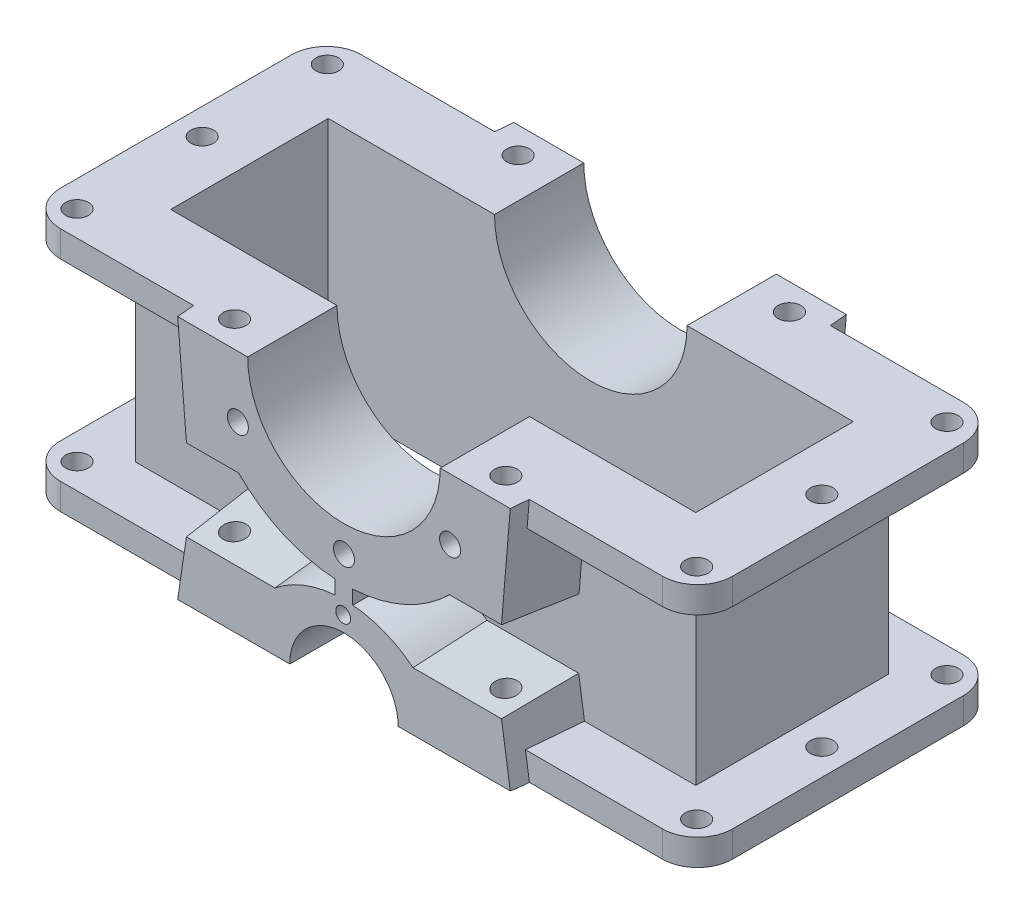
ISO-10303-21;
HEADER;
FILE_DESCRIPTION(('STEP AP214'),'2;1');
FILE_NAME('part.step','',(''),(''),'','','');
FILE_SCHEMA(('AUTOMOTIVE_DESIGN { 1 0 10303 214 1 1 1 1 }'));
ENDSEC;
DATA;
#1=APPLICATION_CONTEXT('core data for automotive mechanical design processes');
#2=APPLICATION_PROTOCOL_DEFINITION('international standard','automotive_design',2000,#1);
#3=PRODUCT_CONTEXT('',#1,'mechanical');
#4=PRODUCT('Part','Part','',(#3));
#5=PRODUCT_RELATED_PRODUCT_CATEGORY('part','',(#4));
#6=PRODUCT_DEFINITION_FORMATION('','',#4);
#7=PRODUCT_DEFINITION_CONTEXT('part definition',#1,'design');
#8=PRODUCT_DEFINITION('design','',#6,#7);
#9=PRODUCT_DEFINITION_SHAPE('','',#8);
#10=(LENGTH_UNIT() NAMED_UNIT(*) SI_UNIT(.MILLI.,.METRE.));
#11=(NAMED_UNIT(*) PLANE_ANGLE_UNIT() SI_UNIT($,.RADIAN.));
#12=(NAMED_UNIT(*) SI_UNIT($,.STERADIAN.) SOLID_ANGLE_UNIT());
#13=UNCERTAINTY_MEASURE_WITH_UNIT(LENGTH_MEASURE(1.E-05),#10,'distance_accuracy_value','');
#14=(GEOMETRIC_REPRESENTATION_CONTEXT(3) GLOBAL_UNCERTAINTY_ASSIGNED_CONTEXT((#13)) GLOBAL_UNIT_ASSIGNED_CONTEXT((#10,
#11,#12)) REPRESENTATION_CONTEXT('',''));
#15=CARTESIAN_POINT('',(0.,0.,0.));
#16=DIRECTION('',(0.,0.,1.));
#17=DIRECTION('',(1.,0.,0.));
#18=AXIS2_PLACEMENT_3D('',#15,#16,#17);
#19=CARTESIAN_POINT('',(160.,-125.,55.));
#20=DIRECTION('',(0.,1.,0.));
#21=DIRECTION('',(0.,0.,1.));
#22=AXIS2_PLACEMENT_3D('',#19,#20,#21);
#23=PLANE('',#22);
#24=CARTESIAN_POINT('',(-77.5,-125.,81.0000000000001));
#25=DIRECTION('',(0.,1.,0.));
#26=DIRECTION('',(0.,0.,-1.));
#27=AXIS2_PLACEMENT_3D('',#24,#25,#26);
#28=CIRCLE('',#27,6.5);
#29=CARTESIAN_POINT('',(-77.5,-125.,74.5000000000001));
#30=VERTEX_POINT('',#29);
#31=EDGE_CURVE('E1296',#30,#30,#28,.T.);
#32=ORIENTED_EDGE('',*,*,#31,.T.);
#33=EDGE_LOOP('',(#32));
#34=FACE_BOUND('',#33,.T.);
#35=DIRECTION('',(0.,0.,-1.));
#36=VECTOR('',#35,1.);
#37=CARTESIAN_POINT('',(-31.,-125.,96.0010000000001));
#38=LINE('',#37,#36);
#39=CARTESIAN_POINT('',(-31.,-125.,-94.9360095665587));
#40=VERTEX_POINT('',#39);
#41=CARTESIAN_POINT('',(-31.,-125.,-44.9999999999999));
#42=VERTEX_POINT('',#41);
#43=EDGE_CURVE('E667',#40,#42,#38,.F.);
#44=ORIENTED_EDGE('',*,*,#43,.T.);
#45=DIRECTION('',(1.,0.,0.));
#46=VECTOR('',#45,1.);
#47=CARTESIAN_POINT('',(150.,-125.,-45.));
#48=LINE('',#47,#46);
#49=CARTESIAN_POINT('',(-150.,-125.,-44.9999999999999));
#50=VERTEX_POINT('',#49);
#51=EDGE_CURVE('E1136',#50,#42,#48,.T.);
#52=ORIENTED_EDGE('',*,*,#51,.F.);
#53=DIRECTION('',(0.,0.,-1.));
#54=VECTOR('',#53,1.);
#55=CARTESIAN_POINT('',(-150.,-125.,-44.9999999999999));
#56=LINE('',#55,#54);
#57=CARTESIAN_POINT('',(-150.,-125.,45.0000000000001));
#58=VERTEX_POINT('',#57);
#59=EDGE_CURVE('E1132',#58,#50,#56,.T.);
#60=ORIENTED_EDGE('',*,*,#59,.F.);
#61=DIRECTION('',(-1.,0.,0.));
#62=VECTOR('',#61,1.);
#63=CARTESIAN_POINT('',(-150.,-125.,45.0000000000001));
#64=LINE('',#63,#62);
#65=CARTESIAN_POINT('',(-31.,-125.,45.0000000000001));
#66=VERTEX_POINT('',#65);
#67=EDGE_CURVE('E1128',#66,#58,#64,.T.);
#68=ORIENTED_EDGE('',*,*,#67,.F.);
#69=DIRECTION('',(0.,0.,1.));
#70=VECTOR('',#69,1.);
#71=CARTESIAN_POINT('',(-31.,-125.,-86.0009999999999));
#72=LINE('',#71,#70);
#73=CARTESIAN_POINT('',(-31.,-125.,94.9360095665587));
#74=VERTEX_POINT('',#73);
#75=EDGE_CURVE('E1482',#66,#74,#72,.T.);
#76=ORIENTED_EDGE('',*,*,#75,.T.);
#77=DIRECTION('',(0.999861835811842,0.,-0.0166225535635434));
#78=VECTOR('',#77,1.);
#79=CARTESIAN_POINT('',(-134.336407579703,-125.,96.6539618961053));
#80=LINE('',#79,#78);
#81=CARTESIAN_POINT('',(-95.,-125.,96.0000000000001));
#82=VERTEX_POINT('',#81);
#83=EDGE_CURVE('E1467',#82,#74,#80,.T.);
#84=ORIENTED_EDGE('',*,*,#83,.F.);
#85=DIRECTION('',(0.0881150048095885,0.,0.996110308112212));
#86=VECTOR('',#85,1.);
#87=CARTESIAN_POINT('',(-96.6187780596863,-125.,77.7002618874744));
#88=LINE('',#87,#86);
#89=CARTESIAN_POINT('',(-95.8845908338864,-125.,86.0000000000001));
#90=VERTEX_POINT('',#89);
#91=EDGE_CURVE('E1464',#90,#82,#88,.T.);
#92=ORIENTED_EDGE('',*,*,#91,.F.);
#93=DIRECTION('',(1.,0.,0.));
#94=VECTOR('',#93,1.);
#95=CARTESIAN_POINT('',(-172.,-125.,86.0000000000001));
#96=LINE('',#95,#94);
#97=CARTESIAN_POINT('',(-172.,-125.,86.));
#98=VERTEX_POINT('',#97);
#99=EDGE_CURVE('E1657',#98,#90,#96,.T.);
#100=ORIENTED_EDGE('',*,*,#99,.F.);
#101=CARTESIAN_POINT('',(-172.,-125.,66.0000000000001));
#102=DIRECTION('',(0.,1.,0.));
#103=DIRECTION('',(0.,0.,1.));
#104=AXIS2_PLACEMENT_3D('',#101,#102,#103);
#105=CIRCLE('',#104,20.);
#106=CARTESIAN_POINT('',(-192.,-125.,66.0000000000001));
#107=VERTEX_POINT('',#106);
#108=EDGE_CURVE('E1658',#107,#98,#105,.T.);
#109=ORIENTED_EDGE('',*,*,#108,.F.);
#110=DIRECTION('',(0.,0.,1.));
#111=VECTOR('',#110,1.);
#112=CARTESIAN_POINT('',(-192.,-125.,66.0000000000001));
#113=LINE('',#112,#111);
#114=CARTESIAN_POINT('',(-192.,-125.,-65.9999999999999));
#115=VERTEX_POINT('',#114);
#116=EDGE_CURVE('E1079',#115,#107,#113,.T.);
#117=ORIENTED_EDGE('',*,*,#116,.F.);
#118=CARTESIAN_POINT('',(-172.,-125.,-65.9999999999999));
#119=DIRECTION('',(0.,1.,0.));
#120=DIRECTION('',(0.,0.,-1.));
#121=AXIS2_PLACEMENT_3D('',#118,#119,#120);
#122=CIRCLE('',#121,20.);
#123=CARTESIAN_POINT('',(-172.,-125.,-85.9999999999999));
#124=VERTEX_POINT('',#123);
#125=EDGE_CURVE('E1101',#124,#115,#122,.T.);
#126=ORIENTED_EDGE('',*,*,#125,.F.);
#127=DIRECTION('',(-1.,0.,0.));
#128=VECTOR('',#127,1.);
#129=CARTESIAN_POINT('',(-172.,-125.,-85.9999999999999));
#130=LINE('',#129,#128);
#131=CARTESIAN_POINT('',(-95.8845908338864,-125.,-85.9999999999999));
#132=VERTEX_POINT('',#131);
#133=EDGE_CURVE('E1643',#132,#124,#130,.T.);
#134=ORIENTED_EDGE('',*,*,#133,.F.);
#135=DIRECTION('',(0.0881150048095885,0.,-0.996110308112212));
#136=VECTOR('',#135,1.);
#137=CARTESIAN_POINT('',(-112.181357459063,-125.,98.229431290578));
#138=LINE('',#137,#136);
#139=CARTESIAN_POINT('',(-95.0000000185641,-125.000000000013,-96.0000000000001));
#140=VERTEX_POINT('',#139);
#141=EDGE_CURVE('E663',#140,#132,#138,.F.);
#142=ORIENTED_EDGE('',*,*,#141,.F.);
#143=DIRECTION('',(0.999861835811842,0.,0.0166225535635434));
#144=VECTOR('',#143,1.);
#145=CARTESIAN_POINT('',(-134.170205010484,-125.,-96.6511988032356));
#146=LINE('',#145,#144);
#147=EDGE_CURVE('E659',#40,#140,#146,.F.);
#148=ORIENTED_EDGE('',*,*,#147,.F.);
#149=EDGE_LOOP('',(#44,#52,#60,#68,#76,#84,#92,#100,#109,#117,#126,#134,#142,#148));
#150=FACE_BOUND('',#149,.T.);
#151=CARTESIAN_POINT('',(-177.,-125.,-71.4999999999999));
#152=DIRECTION('',(0.,1.,0.));
#153=DIRECTION('',(0.,0.,1.));
#154=AXIS2_PLACEMENT_3D('',#151,#152,#153);
#155=CIRCLE('',#154,6.50000000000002);
#156=CARTESIAN_POINT('',(-177.,-125.,-64.9999999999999));
#157=VERTEX_POINT('',#156);
#158=EDGE_CURVE('E622',#157,#157,#155,.T.);
#159=ORIENTED_EDGE('',*,*,#158,.T.);
#160=EDGE_LOOP('',(#159));
#161=FACE_BOUND('',#160,.T.);
#162=CARTESIAN_POINT('',(-177.,-125.,71.5000000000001));
#163=DIRECTION('',(0.,1.,0.));
#164=DIRECTION('',(0.,0.,-1.));
#165=AXIS2_PLACEMENT_3D('',#162,#163,#164);
#166=CIRCLE('',#165,6.50000000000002);
#167=CARTESIAN_POINT('',(-177.,-125.,65.));
#168=VERTEX_POINT('',#167);
#169=EDGE_CURVE('E616',#168,#168,#166,.T.);
#170=ORIENTED_EDGE('',*,*,#169,.T.);
#171=EDGE_LOOP('',(#170));
#172=FACE_BOUND('',#171,.T.);
#173=CARTESIAN_POINT('',(-177.,-125.,0.));
#174=DIRECTION('',(0.,1.,0.));
#175=DIRECTION('',(0.,0.,1.));
#176=AXIS2_PLACEMENT_3D('',#173,#174,#175);
#177=CIRCLE('',#176,6.50000000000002);
#178=CARTESIAN_POINT('',(-177.,-125.,6.50000000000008));
#179=VERTEX_POINT('',#178);
#180=EDGE_CURVE('E610',#179,#179,#177,.T.);
#181=ORIENTED_EDGE('',*,*,#180,.T.);
#182=EDGE_LOOP('',(#181));
#183=FACE_BOUND('',#182,.T.);
#184=CARTESIAN_POINT('',(-77.5,-125.,-81.0000000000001));
#185=DIRECTION('',(0.,-1.,0.));
#186=DIRECTION('',(0.,0.,1.));
#187=AXIS2_PLACEMENT_3D('',#184,#185,#186);
#188=CIRCLE('',#187,6.5);
#189=CARTESIAN_POINT('',(-77.5,-125.,-74.5000000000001));
#190=VERTEX_POINT('',#189);
#191=EDGE_CURVE('E1325',#190,#190,#188,.T.);
#192=ORIENTED_EDGE('',*,*,#191,.F.);
#193=EDGE_LOOP('',(#192));
#194=FACE_BOUND('',#193,.T.);
#195=ADVANCED_FACE('F37',(#34,#150,#161,#172,#183,#194),#23,.F.);
#196=CARTESIAN_POINT('',(-172.,15.,-65.9999999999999));
#197=DIRECTION('',(0.,-1.,0.));
#198=DIRECTION('',(0.,0.,-1.));
#199=AXIS2_PLACEMENT_3D('',#196,#197,#198);
#200=PLANE('',#199);
#201=DIRECTION('',(0.,0.,-1.));
#202=VECTOR('',#201,1.);
#203=CARTESIAN_POINT('',(-55.,15.,96.0010000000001));
#204=LINE('',#203,#202);
#205=CARTESIAN_POINT('',(-55.,15.,-44.9999999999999));
#206=VERTEX_POINT('',#205);
#207=CARTESIAN_POINT('',(-55.,15.,-96.0000000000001));
#208=VERTEX_POINT('',#207);
#209=EDGE_CURVE('E62',#206,#208,#204,.T.);
#210=ORIENTED_EDGE('',*,*,#209,.T.);
#211=DIRECTION('',(1.,0.,0.));
#212=VECTOR('',#211,1.);
#213=CARTESIAN_POINT('',(-55.,15.,-96.0000000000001));
#214=LINE('',#213,#212);
#215=CARTESIAN_POINT('',(-95.,15.,-96.0000000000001));
#216=VERTEX_POINT('',#215);
#217=EDGE_CURVE('E690',#216,#208,#214,.T.);
#218=ORIENTED_EDGE('',*,*,#217,.F.);
#219=DIRECTION('',(-0.0874555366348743,0.,0.996168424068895));
#220=VECTOR('',#219,1.);
#221=CARTESIAN_POINT('',(-111.421273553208,15.,91.0476681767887));
#222=LINE('',#221,#220);
#223=CARTESIAN_POINT('',(-95.8779191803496,15.,-85.9999999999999));
#224=VERTEX_POINT('',#223);
#225=EDGE_CURVE('E677',#224,#216,#222,.F.);
#226=ORIENTED_EDGE('',*,*,#225,.F.);
#227=DIRECTION('',(-1.,0.,0.));
#228=VECTOR('',#227,1.);
#229=CARTESIAN_POINT('',(-172.,15.,-85.9999999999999));
#230=LINE('',#229,#228);
#231=CARTESIAN_POINT('',(-172.,15.,-85.9999999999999));
#232=VERTEX_POINT('',#231);
#233=EDGE_CURVE('E1207',#224,#232,#230,.T.);
#234=ORIENTED_EDGE('',*,*,#233,.T.);
#235=CARTESIAN_POINT('',(-172.,15.,-65.9999999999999));
#236=DIRECTION('',(0.,1.,0.));
#237=DIRECTION('',(0.,0.,-1.));
#238=AXIS2_PLACEMENT_3D('',#235,#236,#237);
#239=CIRCLE('',#238,20.);
#240=CARTESIAN_POINT('',(-192.,15.,-65.9999999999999));
#241=VERTEX_POINT('',#240);
#242=EDGE_CURVE('E1189',#232,#241,#239,.T.);
#243=ORIENTED_EDGE('',*,*,#242,.T.);
#244=DIRECTION('',(0.,0.,1.));
#245=VECTOR('',#244,1.);
#246=CARTESIAN_POINT('',(-192.,15.,66.0000000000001));
#247=LINE('',#246,#245);
#248=CARTESIAN_POINT('',(-192.,15.,66.0000000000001));
#249=VERTEX_POINT('',#248);
#250=EDGE_CURVE('E1192',#241,#249,#247,.T.);
#251=ORIENTED_EDGE('',*,*,#250,.T.);
#252=CARTESIAN_POINT('',(-172.,15.,66.0000000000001));
#253=DIRECTION('',(0.,1.,0.));
#254=DIRECTION('',(0.,0.,1.));
#255=AXIS2_PLACEMENT_3D('',#252,#253,#254);
#256=CIRCLE('',#255,20.);
#257=CARTESIAN_POINT('',(-172.,15.,86.));
#258=VERTEX_POINT('',#257);
#259=EDGE_CURVE('E1195',#249,#258,#256,.T.);
#260=ORIENTED_EDGE('',*,*,#259,.T.);
#261=DIRECTION('',(1.,0.,0.));
#262=VECTOR('',#261,1.);
#263=CARTESIAN_POINT('',(-172.,15.,86.0000000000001));
#264=LINE('',#263,#262);
#265=CARTESIAN_POINT('',(-95.8779191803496,15.,86.0000000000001));
#266=VERTEX_POINT('',#265);
#267=EDGE_CURVE('E1198',#258,#266,#264,.T.);
#268=ORIENTED_EDGE('',*,*,#267,.T.);
#269=DIRECTION('',(-0.0874555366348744,0.,-0.996168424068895));
#270=VECTOR('',#269,1.);
#271=CARTESIAN_POINT('',(-109.702444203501,15.,-71.4692219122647));
#272=LINE('',#271,#270);
#273=CARTESIAN_POINT('',(-95.,15.,96.0000000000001));
#274=VERTEX_POINT('',#273);
#275=EDGE_CURVE('E1492',#274,#266,#272,.T.);
#276=ORIENTED_EDGE('',*,*,#275,.F.);
#277=DIRECTION('',(1.,0.,0.));
#278=VECTOR('',#277,1.);
#279=CARTESIAN_POINT('',(-55.,15.,96.0000000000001));
#280=LINE('',#279,#278);
#281=CARTESIAN_POINT('',(-55.,15.,96.0000000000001));
#282=VERTEX_POINT('',#281);
#283=EDGE_CURVE('E1502',#274,#282,#280,.T.);
#284=ORIENTED_EDGE('',*,*,#283,.T.);
#285=DIRECTION('',(0.,0.,1.));
#286=VECTOR('',#285,1.);
#287=CARTESIAN_POINT('',(-55.,15.,-86.0009999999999));
#288=LINE('',#287,#286);
#289=CARTESIAN_POINT('',(-55.,15.,45.0000000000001));
#290=VERTEX_POINT('',#289);
#291=EDGE_CURVE('E1497',#290,#282,#288,.T.);
#292=ORIENTED_EDGE('',*,*,#291,.F.);
#293=DIRECTION('',(1.,0.,0.));
#294=VECTOR('',#293,1.);
#295=CARTESIAN_POINT('',(-150.,15.,45.0000000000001));
#296=LINE('',#295,#294);
#297=CARTESIAN_POINT('',(-150.,15.,45.0000000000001));
#298=VERTEX_POINT('',#297);
#299=EDGE_CURVE('E1173',#298,#290,#296,.T.);
#300=ORIENTED_EDGE('',*,*,#299,.F.);
#301=DIRECTION('',(0.,0.,1.));
#302=VECTOR('',#301,1.);
#303=CARTESIAN_POINT('',(-150.,15.,45.0000000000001));
#304=LINE('',#303,#302);
#305=CARTESIAN_POINT('',(-150.,15.,-44.9999999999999));
#306=VERTEX_POINT('',#305);
#307=EDGE_CURVE('E1170',#306,#298,#304,.T.);
#308=ORIENTED_EDGE('',*,*,#307,.F.);
#309=DIRECTION('',(-1.,0.,0.));
#310=VECTOR('',#309,1.);
#311=CARTESIAN_POINT('',(-150.,15.,-44.9999999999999));
#312=LINE('',#311,#310);
#313=EDGE_CURVE('E1166',#206,#306,#312,.T.);
#314=ORIENTED_EDGE('',*,*,#313,.F.);
#315=EDGE_LOOP('',(#210,#218,#226,#234,#243,#251,#260,#268,#276,#284,#292,#300,#308,#314));
#316=FACE_BOUND('',#315,.T.);
#317=CARTESIAN_POINT('',(-177.,15.,0.));
#318=DIRECTION('',(0.,1.,0.));
#319=DIRECTION('',(0.,0.,1.));
#320=AXIS2_PLACEMENT_3D('',#317,#318,#319);
#321=CIRCLE('',#320,6.50000000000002);
#322=CARTESIAN_POINT('',(-177.,15.,6.50000000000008));
#323=VERTEX_POINT('',#322);
#324=EDGE_CURVE('E1431',#323,#323,#321,.T.);
#325=ORIENTED_EDGE('',*,*,#324,.F.);
#326=EDGE_LOOP('',(#325));
#327=FACE_BOUND('',#326,.T.);
#328=CARTESIAN_POINT('',(-177.,15.,71.5000000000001));
#329=DIRECTION('',(0.,1.,0.));
#330=DIRECTION('',(0.,0.,-1.));
#331=AXIS2_PLACEMENT_3D('',#328,#329,#330);
#332=CIRCLE('',#331,6.50000000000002);
#333=CARTESIAN_POINT('',(-177.,15.,65.));
#334=VERTEX_POINT('',#333);
#335=EDGE_CURVE('E1437',#334,#334,#332,.T.);
#336=ORIENTED_EDGE('',*,*,#335,.F.);
#337=EDGE_LOOP('',(#336));
#338=FACE_BOUND('',#337,.T.);
#339=CARTESIAN_POINT('',(-177.,15.,-71.4999999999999));
#340=DIRECTION('',(0.,1.,0.));
#341=DIRECTION('',(0.,0.,1.));
#342=AXIS2_PLACEMENT_3D('',#339,#340,#341);
#343=CIRCLE('',#342,6.50000000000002);
#344=CARTESIAN_POINT('',(-177.,15.,-64.9999999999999));
#345=VERTEX_POINT('',#344);
#346=EDGE_CURVE('E1443',#345,#345,#343,.T.);
#347=ORIENTED_EDGE('',*,*,#346,.F.);
#348=EDGE_LOOP('',(#347));
#349=FACE_BOUND('',#348,.T.);
#350=CARTESIAN_POINT('',(-77.5,15.,81.0000000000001));
#351=DIRECTION('',(0.,1.,0.));
#352=DIRECTION('',(0.,0.,-1.));
#353=AXIS2_PLACEMENT_3D('',#350,#351,#352);
#354=CIRCLE('',#353,6.5);
#355=CARTESIAN_POINT('',(-77.5,15.,74.5000000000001));
#356=VERTEX_POINT('',#355);
#357=EDGE_CURVE('E1452',#356,#356,#354,.T.);
#358=ORIENTED_EDGE('',*,*,#357,.F.);
#359=EDGE_LOOP('',(#358));
#360=FACE_BOUND('',#359,.T.);
#361=CARTESIAN_POINT('',(-77.5,15.,-81.0000000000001));
#362=DIRECTION('',(0.,-1.,0.));
#363=DIRECTION('',(0.,0.,1.));
#364=AXIS2_PLACEMENT_3D('',#361,#362,#363);
#365=CIRCLE('',#364,6.5);
#366=CARTESIAN_POINT('',(-77.5,15.,-74.5000000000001));
#367=VERTEX_POINT('',#366);
#368=EDGE_CURVE('E1331',#367,#367,#365,.T.);
#369=ORIENTED_EDGE('',*,*,#368,.T.);
#370=EDGE_LOOP('',(#369));
#371=FACE_BOUND('',#370,.T.);
#372=ADVANCED_FACE('F543',(#316,#327,#338,#349,#360,#371),#200,.F.);
#373=CARTESIAN_POINT('',(-90.,-45.,-96.0000000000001));
#374=DIRECTION('',(0.,-0.996194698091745,-0.0871557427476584));
#375=DIRECTION('',(0.,0.0871557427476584,-0.996194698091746));
#376=AXIS2_PLACEMENT_3D('',#373,#374,#375);
#377=PLANE('',#376);
#378=CARTESIAN_POINT('',(-61.7503087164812,-48.7620125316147,-53.0000000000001));
#379=CARTESIAN_POINT('',(-61.4964993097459,-48.1350003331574,-60.1667822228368));
#380=CARTESIAN_POINT('',(-61.2410666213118,-47.5079931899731,-67.3335066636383));
#381=CARTESIAN_POINT('',(-60.726954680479,-46.2539890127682,-81.6668399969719));
#382=CARTESIAN_POINT('',(-60.4682754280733,-45.6269919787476,-88.8334488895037));
#383=CARTESIAN_POINT('',(-60.2079728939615,-45.,-96.0000000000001));
#384=B_SPLINE_CURVE_WITH_KNOTS('',3,(#378,#379,#380,#381,#382,#383),.UNSPECIFIED.,.F.,.F.,(4,2,
4),(0.,21.595900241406,43.1918005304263),.UNSPECIFIED.);
#385=CARTESIAN_POINT('',(-61.679427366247,-48.5870352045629,-55.));
#386=VERTEX_POINT('',#385);
#387=CARTESIAN_POINT('',(-60.2079728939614,-45.,-96.0000000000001));
#388=VERTEX_POINT('',#387);
#389=EDGE_CURVE('E1358',#386,#388,#384,.T.);
#390=ORIENTED_EDGE('',*,*,#389,.F.);
#391=DIRECTION('',(1.,0.,0.));
#392=VECTOR('',#391,1.);
#393=CARTESIAN_POINT('',(160.,-48.5870352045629,-55.));
#394=LINE('',#393,#392);
#395=CARTESIAN_POINT('',(-93.3005490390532,-48.5870352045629,-55.));
#396=VERTEX_POINT('',#395);
#397=EDGE_CURVE('E46',#386,#396,#394,.F.);
#398=ORIENTED_EDGE('',*,*,#397,.T.);
#399=DIRECTION('',(0.0799382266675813,0.0868768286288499,-0.993006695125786));
#400=VECTOR('',#399,1.);
#401=CARTESIAN_POINT('',(-90.,-45.,-96.0000000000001));
#402=LINE('',#401,#400);
#403=CARTESIAN_POINT('',(-90.,-45.,-96.0000000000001));
#404=VERTEX_POINT('',#403);
#405=EDGE_CURVE('E1364',#396,#404,#402,.T.);
#406=ORIENTED_EDGE('',*,*,#405,.T.);
#407=DIRECTION('',(1.,0.,0.));
#408=VECTOR('',#407,1.);
#409=CARTESIAN_POINT('',(-90.,-45.,-96.0000000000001));
#410=LINE('',#409,#408);
#411=EDGE_CURVE('E722',#404,#388,#410,.T.);
#412=ORIENTED_EDGE('',*,*,#411,.T.);
#413=EDGE_LOOP('',(#390,#398,#406,#412));
#414=FACE_BOUND('',#413,.T.);
#415=CARTESIAN_POINT('',(-77.5,-46.3123299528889,-81.0000000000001));
#416=DIRECTION('',(0.,-0.996194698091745,-0.0871557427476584));
#417=DIRECTION('',(0.,0.0871557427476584,-0.996194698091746));
#418=AXIS2_PLACEMENT_3D('',#415,#416,#417);
#419=ELLIPSE('',#418,6.52482894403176,6.5);
#420=CARTESIAN_POINT('',(-77.5,-45.7436536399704,-87.5000000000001));
#421=VERTEX_POINT('',#420);
#422=EDGE_CURVE('E595',#421,#421,#419,.T.);
#423=ORIENTED_EDGE('',*,*,#422,.F.);
#424=EDGE_LOOP('',(#423));
#425=FACE_BOUND('',#424,.T.);
#426=ADVANCED_FACE('F550',(#414,#425),#377,.T.);
#427=CARTESIAN_POINT('',(-39.4437096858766,-91.5227255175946,-96.0000000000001));
#428=DIRECTION('',(0.,0.996194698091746,-0.0871557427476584));
#429=DIRECTION('',(0.,0.0871557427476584,0.996194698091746));
#430=AXIS2_PLACEMENT_3D('',#427,#428,#429);
#431=PLANE('',#430);
#432=DIRECTION('',(0.0748943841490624,-0.0869109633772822,-0.993396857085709));
#433=VECTOR('',#432,1.);
#434=CARTESIAN_POINT('',(-89.8101374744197,-91.7430509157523,-98.5183308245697));
#435=LINE('',#434,#433);
#436=CARTESIAN_POINT('',(-93.0910805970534,-87.9356903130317,-55.));
#437=VERTEX_POINT('',#436);
#438=CARTESIAN_POINT('',(-90.,-91.5227255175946,-96.0000000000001));
#439=VERTEX_POINT('',#438);
#440=EDGE_CURVE('E1782',#437,#439,#435,.T.);
#441=ORIENTED_EDGE('',*,*,#440,.F.);
#442=DIRECTION('',(-1.,0.,0.));
#443=VECTOR('',#442,1.);
#444=CARTESIAN_POINT('',(160.,-87.9356903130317,-55.));
#445=LINE('',#444,#443);
#446=CARTESIAN_POINT('',(-40.6913162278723,-87.9356903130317,-55.));
#447=VERTEX_POINT('',#446);
#448=EDGE_CURVE('E1314',#437,#447,#445,.F.);
#449=ORIENTED_EDGE('',*,*,#448,.T.);
#450=CARTESIAN_POINT('',(-40.7511980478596,-87.7607129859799,-53.0000000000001));
#451=CARTESIAN_POINT('',(-40.5367742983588,-88.3877242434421,-60.1667714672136));
#452=CARTESIAN_POINT('',(-40.3206634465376,-89.0147311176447,-67.3334928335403));
#453=CARTESIAN_POINT('',(-39.9938351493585,-89.9552343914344,-78.0834944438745));
#454=CARTESIAN_POINT('',(-39.8844487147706,-90.2687343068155,-81.6668148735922));
#455=CARTESIAN_POINT('',(-39.6647666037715,-90.8957317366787,-88.8334282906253));
#456=CARTESIAN_POINT('',(-39.5544709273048,-91.2092292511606,-92.4167212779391));
#457=CARTESIAN_POINT('',(-39.4437096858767,-91.5227255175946,-96.0000000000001));
#458=B_SPLINE_CURVE_WITH_KNOTS('',3,(#450,#451,#452,#453,#454,#455,#456,#457),.UNSPECIFIED.,.F.,
.F.,(4,2,2,4),(0.,21.5920261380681,32.3880390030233,43.1840525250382),.UNSPECIFIED.);
#459=CARTESIAN_POINT('',(-39.4437096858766,-91.5227255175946,-96.0000000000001));
#460=VERTEX_POINT('',#459);
#461=EDGE_CURVE('E1785',#447,#460,#458,.T.);
#462=ORIENTED_EDGE('',*,*,#461,.T.);
#463=DIRECTION('',(-1.,0.,0.));
#464=VECTOR('',#463,1.);
#465=CARTESIAN_POINT('',(-39.4437096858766,-91.5227255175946,-96.0000000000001));
#466=LINE('',#465,#464);
#467=EDGE_CURVE('E710',#460,#439,#466,.T.);
#468=ORIENTED_EDGE('',*,*,#467,.T.);
#469=EDGE_LOOP('',(#441,#449,#462,#468));
#470=FACE_BOUND('',#469,.T.);
#471=CARTESIAN_POINT('',(-77.5,-90.2103955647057,-81.0000000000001));
#472=DIRECTION('',(0.,0.996194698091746,-0.0871557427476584));
#473=DIRECTION('',(0.,0.0871557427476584,0.996194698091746));
#474=AXIS2_PLACEMENT_3D('',#471,#472,#473);
#475=ELLIPSE('',#474,6.52482894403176,6.5);
#476=CARTESIAN_POINT('',(-77.5,-89.6417192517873,-74.5000000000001));
#477=VERTEX_POINT('',#476);
#478=EDGE_CURVE('E1323',#477,#477,#475,.T.);
#479=ORIENTED_EDGE('',*,*,#478,.F.);
#480=EDGE_LOOP('',(#479));
#481=FACE_BOUND('',#480,.T.);
#482=ADVANCED_FACE('F558',(#470,#481),#431,.T.);
#483=DIRECTION('',(0.,0.,-1.));
#484=VECTOR('',#483,1.);
#485=CARTESIAN_POINT('',(31.,-125.,96.0010000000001));
#486=LINE('',#485,#484);
#487=CARTESIAN_POINT('',(31.,-125.,-44.9999999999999));
#488=VERTEX_POINT('',#487);
#489=CARTESIAN_POINT('',(31.,-125.,-93.9052688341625));
#490=VERTEX_POINT('',#489);
#491=EDGE_CURVE('E54',#488,#490,#486,.T.);
#492=ORIENTED_EDGE('',*,*,#491,.T.);
#493=DIRECTION('',(0.999861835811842,0.,0.0166225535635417));
#494=VECTOR('',#493,1.);
#495=CARTESIAN_POINT('',(34.1562909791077,-125.,-93.8527959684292));
#496=LINE('',#495,#494);
#497=CARTESIAN_POINT('',(95.3215597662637,-125.,-92.8359325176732));
#498=VERTEX_POINT('',#497);
#499=EDGE_CURVE('E651',#498,#490,#496,.F.);
#500=ORIENTED_EDGE('',*,*,#499,.F.);
#501=DIRECTION('',(0.0881309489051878,0.,0.996108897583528));
#502=VECTOR('',#501,1.);
#503=CARTESIAN_POINT('',(111.399590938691,-125.,88.8876289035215));
#504=LINE('',#503,#502);
#505=CARTESIAN_POINT('',(95.926370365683,-125.,-85.9999999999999));
#506=VERTEX_POINT('',#505);
#507=EDGE_CURVE('E674',#506,#498,#504,.F.);
#508=ORIENTED_EDGE('',*,*,#507,.F.);
#509=CARTESIAN_POINT('',(172.,-125.,-85.9999999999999));
#510=VERTEX_POINT('',#509);
#511=EDGE_CURVE('E1644',#510,#506,#130,.T.);
#512=ORIENTED_EDGE('',*,*,#511,.F.);
#513=CARTESIAN_POINT('',(172.,-125.,-65.9999999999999));
#514=DIRECTION('',(0.,1.,0.));
#515=DIRECTION('',(0.,0.,-1.));
#516=AXIS2_PLACEMENT_3D('',#513,#514,#515);
#517=CIRCLE('',#516,20.);
#518=CARTESIAN_POINT('',(192.,-125.,-66.));
#519=VERTEX_POINT('',#518);
#520=EDGE_CURVE('E1647',#519,#510,#517,.T.);
#521=ORIENTED_EDGE('',*,*,#520,.F.);
#522=DIRECTION('',(0.,0.,-1.));
#523=VECTOR('',#522,1.);
#524=CARTESIAN_POINT('',(192.,-125.,66.));
#525=LINE('',#524,#523);
#526=CARTESIAN_POINT('',(192.,-125.,66.));
#527=VERTEX_POINT('',#526);
#528=EDGE_CURVE('E1650',#527,#519,#525,.T.);
#529=ORIENTED_EDGE('',*,*,#528,.F.);
#530=CARTESIAN_POINT('',(172.,-125.,66.));
#531=DIRECTION('',(0.,1.,0.));
#532=DIRECTION('',(0.,0.,-1.));
#533=AXIS2_PLACEMENT_3D('',#530,#531,#532);
#534=CIRCLE('',#533,20.);
#535=CARTESIAN_POINT('',(172.,-125.,86.));
#536=VERTEX_POINT('',#535);
#537=EDGE_CURVE('E1653',#536,#527,#534,.T.);
#538=ORIENTED_EDGE('',*,*,#537,.F.);
#539=CARTESIAN_POINT('',(95.926370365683,-125.,86.));
#540=VERTEX_POINT('',#539);
#541=EDGE_CURVE('E1656',#540,#536,#96,.T.);
#542=ORIENTED_EDGE('',*,*,#541,.F.);
#543=DIRECTION('',(0.0881309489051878,0.,-0.996108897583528));
#544=VECTOR('',#543,1.);
#545=CARTESIAN_POINT('',(110.521710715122,-125.,-78.9652995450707));
#546=LINE('',#545,#544);
#547=CARTESIAN_POINT('',(95.3215597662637,-125.,92.8359325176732));
#548=VERTEX_POINT('',#547);
#549=EDGE_CURVE('E1486',#548,#540,#546,.T.);
#550=ORIENTED_EDGE('',*,*,#549,.F.);
#551=DIRECTION('',(0.999861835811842,0.,-0.0166225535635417));
#552=VECTOR('',#551,1.);
#553=CARTESIAN_POINT('',(33.9900884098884,-125.,93.8555590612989));
#554=LINE('',#553,#552);
#555=CARTESIAN_POINT('',(31.,-125.,93.9052688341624));
#556=VERTEX_POINT('',#555);
#557=EDGE_CURVE('E1473',#556,#548,#554,.T.);
#558=ORIENTED_EDGE('',*,*,#557,.F.);
#559=DIRECTION('',(0.,0.,1.));
#560=VECTOR('',#559,1.);
#561=CARTESIAN_POINT('',(31.,-125.,-86.0009999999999));
#562=LINE('',#561,#560);
#563=CARTESIAN_POINT('',(31.,-125.,45.));
#564=VERTEX_POINT('',#563);
#565=EDGE_CURVE('E1483',#564,#556,#562,.T.);
#566=ORIENTED_EDGE('',*,*,#565,.F.);
#567=CARTESIAN_POINT('',(150.,-125.,45.));
#568=VERTEX_POINT('',#567);
#569=EDGE_CURVE('E1129',#568,#564,#64,.T.);
#570=ORIENTED_EDGE('',*,*,#569,.F.);
#571=DIRECTION('',(0.,0.,1.));
#572=VECTOR('',#571,1.);
#573=CARTESIAN_POINT('',(150.,-125.,45.));
#574=LINE('',#573,#572);
#575=CARTESIAN_POINT('',(150.,-125.,-45.));
#576=VERTEX_POINT('',#575);
#577=EDGE_CURVE('E1139',#576,#568,#574,.T.);
#578=ORIENTED_EDGE('',*,*,#577,.F.);
#579=EDGE_CURVE('E1135',#488,#576,#48,.T.);
#580=ORIENTED_EDGE('',*,*,#579,.F.);
#581=EDGE_LOOP('',(#492,#500,#508,#512,#521,#529,#538,#542,#550,#558,#566,#570,#578,#580));
#582=FACE_BOUND('',#581,.T.);
#583=CARTESIAN_POINT('',(77.5,-125.,81.0000000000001));
#584=DIRECTION('',(0.,1.,0.));
#585=DIRECTION('',(0.,0.,1.));
#586=AXIS2_PLACEMENT_3D('',#583,#584,#585);
#587=CIRCLE('',#586,6.50000000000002);
#588=CARTESIAN_POINT('',(77.5,-125.,87.5000000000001));
#589=VERTEX_POINT('',#588);
#590=EDGE_CURVE('E571',#589,#589,#587,.T.);
#591=ORIENTED_EDGE('',*,*,#590,.T.);
#592=EDGE_LOOP('',(#591));
#593=FACE_BOUND('',#592,.T.);
#594=CARTESIAN_POINT('',(177.,-125.,0.));
#595=DIRECTION('',(0.,1.,0.));
#596=DIRECTION('',(0.,0.,1.));
#597=AXIS2_PLACEMENT_3D('',#594,#595,#596);
#598=CIRCLE('',#597,6.50000000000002);
#599=CARTESIAN_POINT('',(177.,-125.,6.50000000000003));
#600=VERTEX_POINT('',#599);
#601=EDGE_CURVE('E575',#600,#600,#598,.T.);
#602=ORIENTED_EDGE('',*,*,#601,.T.);
#603=EDGE_LOOP('',(#602));
#604=FACE_BOUND('',#603,.T.);
#605=CARTESIAN_POINT('',(177.,-125.,71.5));
#606=DIRECTION('',(0.,1.,0.));
#607=DIRECTION('',(0.,0.,1.));
#608=AXIS2_PLACEMENT_3D('',#605,#606,#607);
#609=CIRCLE('',#608,6.50000000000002);
#610=CARTESIAN_POINT('',(177.,-125.,78.));
#611=VERTEX_POINT('',#610);
#612=EDGE_CURVE('E579',#611,#611,#609,.T.);
#613=ORIENTED_EDGE('',*,*,#612,.T.);
#614=EDGE_LOOP('',(#613));
#615=FACE_BOUND('',#614,.T.);
#616=CARTESIAN_POINT('',(177.,-125.,-71.4999999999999));
#617=DIRECTION('',(0.,1.,0.));
#618=DIRECTION('',(0.,0.,-1.));
#619=AXIS2_PLACEMENT_3D('',#616,#617,#618);
#620=CIRCLE('',#619,6.50000000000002);
#621=CARTESIAN_POINT('',(177.,-125.,-77.9999999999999));
#622=VERTEX_POINT('',#621);
#623=EDGE_CURVE('E583',#622,#622,#620,.T.);
#624=ORIENTED_EDGE('',*,*,#623,.T.);
#625=EDGE_LOOP('',(#624));
#626=FACE_BOUND('',#625,.T.);
#627=CARTESIAN_POINT('',(77.5,-125.,-81.0000000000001));
#628=DIRECTION('',(0.,-1.,0.));
#629=DIRECTION('',(0.,0.,-1.));
#630=AXIS2_PLACEMENT_3D('',#627,#628,#629);
#631=CIRCLE('',#630,6.50000000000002);
#632=CARTESIAN_POINT('',(77.5,-125.,-87.5000000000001));
#633=VERTEX_POINT('',#632);
#634=EDGE_CURVE('E586',#633,#633,#631,.T.);
#635=ORIENTED_EDGE('',*,*,#634,.F.);
#636=EDGE_LOOP('',(#635));
#637=FACE_BOUND('',#636,.T.);
#638=ADVANCED_FACE('F546',(#582,#593,#604,#615,#626,#637),#23,.F.);
#639=CARTESIAN_POINT('',(177.,15.,-71.4999999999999));
#640=DIRECTION('',(0.,1.,0.));
#641=DIRECTION('',(0.,0.,-1.));
#642=AXIS2_PLACEMENT_3D('',#639,#640,#641);
#643=CIRCLE('',#642,6.50000000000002);
#644=CARTESIAN_POINT('',(177.,15.,-77.9999999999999));
#645=VERTEX_POINT('',#644);
#646=EDGE_CURVE('E1419',#645,#645,#643,.T.);
#647=ORIENTED_EDGE('',*,*,#646,.F.);
#648=EDGE_LOOP('',(#647));
#649=FACE_BOUND('',#648,.T.);
#650=CARTESIAN_POINT('',(177.,15.,71.5));
#651=DIRECTION('',(0.,1.,0.));
#652=DIRECTION('',(0.,0.,1.));
#653=AXIS2_PLACEMENT_3D('',#650,#651,#652);
#654=CIRCLE('',#653,6.50000000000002);
#655=CARTESIAN_POINT('',(177.,15.,78.));
#656=VERTEX_POINT('',#655);
#657=EDGE_CURVE('E1425',#656,#656,#654,.T.);
#658=ORIENTED_EDGE('',*,*,#657,.F.);
#659=EDGE_LOOP('',(#658));
#660=FACE_BOUND('',#659,.T.);
#661=CARTESIAN_POINT('',(177.,15.,0.));
#662=DIRECTION('',(0.,1.,0.));
#663=DIRECTION('',(0.,0.,1.));
#664=AXIS2_PLACEMENT_3D('',#661,#662,#663);
#665=CIRCLE('',#664,6.50000000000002);
#666=CARTESIAN_POINT('',(177.,15.,6.50000000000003));
#667=VERTEX_POINT('',#666);
#668=EDGE_CURVE('E1449',#667,#667,#665,.T.);
#669=ORIENTED_EDGE('',*,*,#668,.F.);
#670=EDGE_LOOP('',(#669));
#671=FACE_BOUND('',#670,.T.);
#672=CARTESIAN_POINT('',(77.5,15.,81.0000000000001));
#673=DIRECTION('',(0.,1.,0.));
#674=DIRECTION('',(0.,0.,1.));
#675=AXIS2_PLACEMENT_3D('',#672,#673,#674);
#676=CIRCLE('',#675,6.50000000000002);
#677=CARTESIAN_POINT('',(77.5,15.,87.5000000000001));
#678=VERTEX_POINT('',#677);
#679=EDGE_CURVE('E1458',#678,#678,#676,.T.);
#680=ORIENTED_EDGE('',*,*,#679,.F.);
#681=EDGE_LOOP('',(#680));
#682=FACE_BOUND('',#681,.T.);
#683=DIRECTION('',(0.,0.,-1.));
#684=VECTOR('',#683,1.);
#685=CARTESIAN_POINT('',(55.,15.,96.0010000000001));
#686=LINE('',#685,#684);
#687=CARTESIAN_POINT('',(55.,15.,-96.0000000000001));
#688=VERTEX_POINT('',#687);
#689=CARTESIAN_POINT('',(55.,15.,-44.9999999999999));
#690=VERTEX_POINT('',#689);
#691=EDGE_CURVE('E684',#688,#690,#686,.F.);
#692=ORIENTED_EDGE('',*,*,#691,.T.);
#693=CARTESIAN_POINT('',(150.,15.,-45.));
#694=VERTEX_POINT('',#693);
#695=EDGE_CURVE('E1167',#694,#690,#312,.T.);
#696=ORIENTED_EDGE('',*,*,#695,.F.);
#697=DIRECTION('',(0.,0.,-1.));
#698=VECTOR('',#697,1.);
#699=CARTESIAN_POINT('',(150.,15.,45.));
#700=LINE('',#699,#698);
#701=CARTESIAN_POINT('',(150.,15.,45.));
#702=VERTEX_POINT('',#701);
#703=EDGE_CURVE('E1176',#702,#694,#700,.T.);
#704=ORIENTED_EDGE('',*,*,#703,.F.);
#705=CARTESIAN_POINT('',(55.,15.,45.));
#706=VERTEX_POINT('',#705);
#707=EDGE_CURVE('E1172',#706,#702,#296,.T.);
#708=ORIENTED_EDGE('',*,*,#707,.F.);
#709=DIRECTION('',(0.,0.,1.));
#710=VECTOR('',#709,1.);
#711=CARTESIAN_POINT('',(55.,15.,-86.0009999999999));
#712=LINE('',#711,#710);
#713=CARTESIAN_POINT('',(55.,15.,96.0000000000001));
#714=VERTEX_POINT('',#713);
#715=EDGE_CURVE('E1505',#706,#714,#712,.T.);
#716=ORIENTED_EDGE('',*,*,#715,.T.);
#717=DIRECTION('',(-1.,0.,0.));
#718=VECTOR('',#717,1.);
#719=CARTESIAN_POINT('',(95.0000000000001,15.,96.0000000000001));
#720=LINE('',#719,#718);
#721=CARTESIAN_POINT('',(95.0000000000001,15.,96.0000000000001));
#722=VERTEX_POINT('',#721);
#723=EDGE_CURVE('E1522',#722,#714,#720,.T.);
#724=ORIENTED_EDGE('',*,*,#723,.F.);
#725=DIRECTION('',(-0.0874555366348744,0.,0.996168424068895));
#726=VECTOR('',#725,1.);
#727=CARTESIAN_POINT('',(107.071370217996,15.,-41.4997891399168));
#728=LINE('',#727,#726);
#729=CARTESIAN_POINT('',(95.8779191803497,15.,86.0000000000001));
#730=VERTEX_POINT('',#729);
#731=EDGE_CURVE('E1489',#730,#722,#728,.T.);
#732=ORIENTED_EDGE('',*,*,#731,.F.);
#733=CARTESIAN_POINT('',(172.,15.,86.));
#734=VERTEX_POINT('',#733);
#735=EDGE_CURVE('E1197',#730,#734,#264,.T.);
#736=ORIENTED_EDGE('',*,*,#735,.T.);
#737=CARTESIAN_POINT('',(172.,15.,66.));
#738=DIRECTION('',(0.,1.,0.));
#739=DIRECTION('',(0.,0.,-1.));
#740=AXIS2_PLACEMENT_3D('',#737,#738,#739);
#741=CIRCLE('',#740,20.);
#742=CARTESIAN_POINT('',(192.,15.,66.));
#743=VERTEX_POINT('',#742);
#744=EDGE_CURVE('E1201',#734,#743,#741,.T.);
#745=ORIENTED_EDGE('',*,*,#744,.T.);
#746=DIRECTION('',(0.,0.,-1.));
#747=VECTOR('',#746,1.);
#748=CARTESIAN_POINT('',(192.,15.,66.));
#749=LINE('',#748,#747);
#750=CARTESIAN_POINT('',(192.,15.,-66.));
#751=VERTEX_POINT('',#750);
#752=EDGE_CURVE('E1203',#743,#751,#749,.T.);
#753=ORIENTED_EDGE('',*,*,#752,.T.);
#754=CARTESIAN_POINT('',(172.,15.,-65.9999999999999));
#755=DIRECTION('',(0.,1.,0.));
#756=DIRECTION('',(0.,0.,-1.));
#757=AXIS2_PLACEMENT_3D('',#754,#755,#756);
#758=CIRCLE('',#757,20.);
#759=CARTESIAN_POINT('',(172.,15.,-85.9999999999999));
#760=VERTEX_POINT('',#759);
#761=EDGE_CURVE('E1205',#751,#760,#758,.T.);
#762=ORIENTED_EDGE('',*,*,#761,.T.);
#763=CARTESIAN_POINT('',(95.8779191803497,15.,-85.9999999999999));
#764=VERTEX_POINT('',#763);
#765=EDGE_CURVE('E1208',#760,#764,#230,.T.);
#766=ORIENTED_EDGE('',*,*,#765,.T.);
#767=DIRECTION('',(-0.0874555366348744,0.,-0.996168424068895));
#768=VECTOR('',#767,1.);
#769=CARTESIAN_POINT('',(111.421273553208,15.,91.0476681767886));
#770=LINE('',#769,#768);
#771=CARTESIAN_POINT('',(95.0000000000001,15.,-96.0000000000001));
#772=VERTEX_POINT('',#771);
#773=EDGE_CURVE('E680',#772,#764,#770,.F.);
#774=ORIENTED_EDGE('',*,*,#773,.F.);
#775=DIRECTION('',(-1.,0.,0.));
#776=VECTOR('',#775,1.);
#777=CARTESIAN_POINT('',(95.0000000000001,15.,-96.0000000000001));
#778=LINE('',#777,#776);
#779=EDGE_CURVE('E728',#772,#688,#778,.T.);
#780=ORIENTED_EDGE('',*,*,#779,.T.);
#781=EDGE_LOOP('',(#692,#696,#704,#708,#716,#724,#732,#736,#745,#753,#762,#766,#774,#780));
#782=FACE_BOUND('',#781,.T.);
#783=CARTESIAN_POINT('',(77.5,15.,-81.0000000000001));
#784=DIRECTION('',(0.,-1.,0.));
#785=DIRECTION('',(0.,0.,-1.));
#786=AXIS2_PLACEMENT_3D('',#783,#784,#785);
#787=CIRCLE('',#786,6.50000000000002);
#788=CARTESIAN_POINT('',(77.5,15.,-87.5000000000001));
#789=VERTEX_POINT('',#788);
#790=EDGE_CURVE('E589',#789,#789,#787,.T.);
#791=ORIENTED_EDGE('',*,*,#790,.T.);
#792=EDGE_LOOP('',(#791));
#793=FACE_BOUND('',#792,.T.);
#794=ADVANCED_FACE('F552',(#649,#660,#671,#682,#782,#793),#200,.F.);
#795=CARTESIAN_POINT('',(90.0000000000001,-45.,-96.0000000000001));
#796=DIRECTION('',(0.,-0.996194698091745,-0.0871557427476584));
#797=DIRECTION('',(0.,0.0871557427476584,-0.996194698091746));
#798=AXIS2_PLACEMENT_3D('',#795,#796,#797);
#799=PLANE('',#798);
#800=DIRECTION('',(-0.0799382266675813,0.0868768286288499,-0.993006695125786));
#801=VECTOR('',#800,1.);
#802=CARTESIAN_POINT('',(89.6152638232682,-44.5818688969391,-100.779260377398));
#803=LINE('',#802,#801);
#804=CARTESIAN_POINT('',(93.3005490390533,-48.5870352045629,-55.));
#805=VERTEX_POINT('',#804);
#806=CARTESIAN_POINT('',(90.0000000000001,-45.,-96.0000000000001));
#807=VERTEX_POINT('',#806);
#808=EDGE_CURVE('E1814',#805,#807,#803,.T.);
#809=ORIENTED_EDGE('',*,*,#808,.F.);
#810=DIRECTION('',(1.,0.,0.));
#811=VECTOR('',#810,1.);
#812=CARTESIAN_POINT('',(160.,-48.5870352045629,-55.));
#813=LINE('',#812,#811);
#814=CARTESIAN_POINT('',(61.6794273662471,-48.5870352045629,-55.));
#815=VERTEX_POINT('',#814);
#816=EDGE_CURVE('E1310',#805,#815,#813,.F.);
#817=ORIENTED_EDGE('',*,*,#816,.T.);
#818=CARTESIAN_POINT('',(61.7503087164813,-48.7620125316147,-53.0000000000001));
#819=CARTESIAN_POINT('',(61.496499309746,-48.1350003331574,-60.1667822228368));
#820=CARTESIAN_POINT('',(61.2410666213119,-47.5079931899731,-67.3335066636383));
#821=CARTESIAN_POINT('',(60.7269546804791,-46.2539890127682,-81.6668399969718));
#822=CARTESIAN_POINT('',(60.4682754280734,-45.6269919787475,-88.8334488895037));
#823=CARTESIAN_POINT('',(60.2079728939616,-45.,-96.));
#824=B_SPLINE_CURVE_WITH_KNOTS('',3,(#818,#819,#820,#821,#822,#823),.UNSPECIFIED.,.F.,.F.,(4,2,
4),(0.,21.595900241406,43.1918005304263),.UNSPECIFIED.);
#825=CARTESIAN_POINT('',(60.2079728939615,-45.,-96.0000000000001));
#826=VERTEX_POINT('',#825);
#827=EDGE_CURVE('E777',#815,#826,#824,.T.);
#828=ORIENTED_EDGE('',*,*,#827,.T.);
#829=DIRECTION('',(1.,0.,0.));
#830=VECTOR('',#829,1.);
#831=CARTESIAN_POINT('',(90.0000000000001,-45.,-96.0000000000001));
#832=LINE('',#831,#830);
#833=EDGE_CURVE('E734',#826,#807,#832,.T.);
#834=ORIENTED_EDGE('',*,*,#833,.T.);
#835=EDGE_LOOP('',(#809,#817,#828,#834));
#836=FACE_BOUND('',#835,.T.);
#837=CARTESIAN_POINT('',(77.5,-46.3123299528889,-81.0000000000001));
#838=DIRECTION('',(0.,-0.996194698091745,-0.0871557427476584));
#839=DIRECTION('',(0.,0.0871557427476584,-0.996194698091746));
#840=AXIS2_PLACEMENT_3D('',#837,#838,#839);
#841=ELLIPSE('',#840,6.52482894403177,6.50000000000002);
#842=CARTESIAN_POINT('',(77.5,-45.7436536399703,-87.5000000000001));
#843=VERTEX_POINT('',#842);
#844=EDGE_CURVE('E592',#843,#843,#841,.T.);
#845=ORIENTED_EDGE('',*,*,#844,.F.);
#846=EDGE_LOOP('',(#845));
#847=FACE_BOUND('',#846,.T.);
#848=ADVANCED_FACE('F563',(#836,#847),#799,.T.);
#849=CARTESIAN_POINT('',(90.0000000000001,-91.5227255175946,-96.0000000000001));
#850=DIRECTION('',(0.,0.996194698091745,-0.0871557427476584));
#851=DIRECTION('',(0.,0.0871557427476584,0.996194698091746));
#852=AXIS2_PLACEMENT_3D('',#849,#850,#851);
#853=PLANE('',#852);
#854=CARTESIAN_POINT('',(40.7511980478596,-87.7607129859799,-53.0000000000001));
#855=CARTESIAN_POINT('',(40.5367742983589,-88.3877242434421,-60.1667714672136));
#856=CARTESIAN_POINT('',(40.3206634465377,-89.0147311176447,-67.3334928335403));
#857=CARTESIAN_POINT('',(39.9938351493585,-89.9552343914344,-78.0834944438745));
#858=CARTESIAN_POINT('',(39.8844487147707,-90.2687343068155,-81.6668148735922));
#859=CARTESIAN_POINT('',(39.6647666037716,-90.8957317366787,-88.8334282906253));
#860=CARTESIAN_POINT('',(39.5544709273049,-91.2092292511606,-92.4167212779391));
#861=CARTESIAN_POINT('',(39.4437096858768,-91.5227255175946,-96.0000000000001));
#862=B_SPLINE_CURVE_WITH_KNOTS('',3,(#854,#855,#856,#857,#858,#859,#860,#861),.UNSPECIFIED.,.F.,
.F.,(4,2,2,4),(0.,21.5920261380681,32.3880390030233,43.1840525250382),.UNSPECIFIED.);
#863=CARTESIAN_POINT('',(40.6913162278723,-87.9356903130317,-55.));
#864=VERTEX_POINT('',#863);
#865=CARTESIAN_POINT('',(39.4437096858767,-91.5227255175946,-96.0000000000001));
#866=VERTEX_POINT('',#865);
#867=EDGE_CURVE('E743',#864,#866,#862,.T.);
#868=ORIENTED_EDGE('',*,*,#867,.F.);
#869=DIRECTION('',(-1.,0.,0.));
#870=VECTOR('',#869,1.);
#871=CARTESIAN_POINT('',(160.,-87.9356903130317,-55.));
#872=LINE('',#871,#870);
#873=CARTESIAN_POINT('',(93.087282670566,-87.9356903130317,-55.));
#874=VERTEX_POINT('',#873);
#875=EDGE_CURVE('E1302',#864,#874,#872,.F.);
#876=ORIENTED_EDGE('',*,*,#875,.T.);
#877=DIRECTION('',(-0.0748028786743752,-0.0869115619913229,-0.993403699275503));
#878=VECTOR('',#877,1.);
#879=CARTESIAN_POINT('',(90.0000000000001,-91.5227255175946,-96.0000000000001));
#880=LINE('',#879,#878);
#881=CARTESIAN_POINT('',(90.0000000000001,-91.5227255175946,-96.0000000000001));
#882=VERTEX_POINT('',#881);
#883=EDGE_CURVE('E1853',#874,#882,#880,.T.);
#884=ORIENTED_EDGE('',*,*,#883,.T.);
#885=DIRECTION('',(-1.,0.,0.));
#886=VECTOR('',#885,1.);
#887=CARTESIAN_POINT('',(90.0000000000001,-91.5227255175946,-96.0000000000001));
#888=LINE('',#887,#886);
#889=EDGE_CURVE('E697',#882,#866,#888,.T.);
#890=ORIENTED_EDGE('',*,*,#889,.T.);
#891=EDGE_LOOP('',(#868,#876,#884,#890));
#892=FACE_BOUND('',#891,.T.);
#893=CARTESIAN_POINT('',(77.5,-90.2103955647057,-81.0000000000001));
#894=DIRECTION('',(0.,0.996194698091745,-0.0871557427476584));
#895=DIRECTION('',(0.,0.0871557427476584,0.996194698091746));
#896=AXIS2_PLACEMENT_3D('',#893,#894,#895);
#897=ELLIPSE('',#896,6.52482894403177,6.50000000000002);
#898=CARTESIAN_POINT('',(77.5,-89.6417192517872,-74.5));
#899=VERTEX_POINT('',#898);
#900=EDGE_CURVE('E588',#899,#899,#897,.T.);
#901=ORIENTED_EDGE('',*,*,#900,.F.);
#902=EDGE_LOOP('',(#901));
#903=FACE_BOUND('',#902,.T.);
#904=ADVANCED_FACE('F766',(#892,#903),#853,.T.);
#905=CARTESIAN_POINT('',(-172.,-110.,-65.9999999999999));
#906=DIRECTION('',(0.,1.,0.));
#907=DIRECTION('',(0.,0.,-1.));
#908=AXIS2_PLACEMENT_3D('',#905,#906,#907);
#909=PLANE('',#908);
#910=CARTESIAN_POINT('',(177.,-110.,71.5));
#911=DIRECTION('',(0.,1.,0.));
#912=DIRECTION('',(0.,0.,1.));
#913=AXIS2_PLACEMENT_3D('',#910,#911,#912);
#914=CIRCLE('',#913,6.50000000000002);
#915=CARTESIAN_POINT('',(177.,-110.,78.));
#916=VERTEX_POINT('',#915);
#917=EDGE_CURVE('E607',#916,#916,#914,.T.);
#918=ORIENTED_EDGE('',*,*,#917,.F.);
#919=EDGE_LOOP('',(#918));
#920=FACE_BOUND('',#919,.T.);
#921=DIRECTION('',(-1.,0.,0.));
#922=VECTOR('',#921,1.);
#923=CARTESIAN_POINT('',(-172.,-110.,-85.9999999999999));
#924=LINE('',#923,#922);
#925=CARTESIAN_POINT('',(172.,-110.,-85.9999999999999));
#926=VERTEX_POINT('',#925);
#927=CARTESIAN_POINT('',(93.6673969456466,-110.,-85.9999999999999));
#928=VERTEX_POINT('',#927);
#929=EDGE_CURVE('E1073',#926,#928,#924,.T.);
#930=ORIENTED_EDGE('',*,*,#929,.T.);
#931=DIRECTION('',(-0.0881309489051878,0.,-0.996108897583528));
#932=VECTOR('',#931,1.);
#933=CARTESIAN_POINT('',(93.3597016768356,-110.,-89.4777566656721));
#934=LINE('',#933,#932);
#935=CARTESIAN_POINT('',(96.4101286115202,-110.,-55.));
#936=VERTEX_POINT('',#935);
#937=EDGE_CURVE('E751',#928,#936,#934,.F.);
#938=ORIENTED_EDGE('',*,*,#937,.T.);
#939=DIRECTION('',(-1.,0.,0.));
#940=VECTOR('',#939,1.);
#941=CARTESIAN_POINT('',(160.,-110.,-55.));
#942=LINE('',#941,#940);
#943=CARTESIAN_POINT('',(160.,-110.,-55.));
#944=VERTEX_POINT('',#943);
#945=EDGE_CURVE('E1118',#944,#936,#942,.T.);
#946=ORIENTED_EDGE('',*,*,#945,.F.);
#947=DIRECTION('',(0.,0.,-1.));
#948=VECTOR('',#947,1.);
#949=CARTESIAN_POINT('',(160.,-110.,55.));
#950=LINE('',#949,#948);
#951=CARTESIAN_POINT('',(160.,-110.,55.));
#952=VERTEX_POINT('',#951);
#953=EDGE_CURVE('E1254',#952,#944,#950,.T.);
#954=ORIENTED_EDGE('',*,*,#953,.F.);
#955=DIRECTION('',(1.,0.,0.));
#956=VECTOR('',#955,1.);
#957=CARTESIAN_POINT('',(-160.,-110.,55.));
#958=LINE('',#957,#956);
#959=CARTESIAN_POINT('',(96.4101286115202,-110.,55.));
#960=VERTEX_POINT('',#959);
#961=EDGE_CURVE('E1124',#960,#952,#958,.T.);
#962=ORIENTED_EDGE('',*,*,#961,.F.);
#963=DIRECTION('',(0.0881309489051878,0.,-0.996108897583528));
#964=VECTOR('',#963,1.);
#965=CARTESIAN_POINT('',(104.947720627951,-110.,-41.4969908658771));
#966=LINE('',#965,#964);
#967=CARTESIAN_POINT('',(93.6673969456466,-110.,86.));
#968=VERTEX_POINT('',#967);
#969=EDGE_CURVE('E1631',#968,#960,#966,.T.);
#970=ORIENTED_EDGE('',*,*,#969,.F.);
#971=DIRECTION('',(1.,0.,0.));
#972=VECTOR('',#971,1.);
#973=CARTESIAN_POINT('',(-172.,-110.,86.0000000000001));
#974=LINE('',#973,#972);
#975=CARTESIAN_POINT('',(172.,-110.,86.));
#976=VERTEX_POINT('',#975);
#977=EDGE_CURVE('E1092',#968,#976,#974,.T.);
#978=ORIENTED_EDGE('',*,*,#977,.T.);
#979=CARTESIAN_POINT('',(172.,-110.,66.));
#980=DIRECTION('',(0.,1.,0.));
#981=DIRECTION('',(0.,0.,-1.));
#982=AXIS2_PLACEMENT_3D('',#979,#980,#981);
#983=CIRCLE('',#982,20.);
#984=CARTESIAN_POINT('',(192.,-110.,66.));
#985=VERTEX_POINT('',#984);
#986=EDGE_CURVE('E1089',#976,#985,#983,.T.);
#987=ORIENTED_EDGE('',*,*,#986,.T.);
#988=DIRECTION('',(0.,0.,-1.));
#989=VECTOR('',#988,1.);
#990=CARTESIAN_POINT('',(192.,-110.,66.));
#991=LINE('',#990,#989);
#992=CARTESIAN_POINT('',(192.,-110.,-66.));
#993=VERTEX_POINT('',#992);
#994=EDGE_CURVE('E1086',#985,#993,#991,.T.);
#995=ORIENTED_EDGE('',*,*,#994,.T.);
#996=CARTESIAN_POINT('',(172.,-110.,-65.9999999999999));
#997=DIRECTION('',(0.,1.,0.));
#998=DIRECTION('',(0.,0.,-1.));
#999=AXIS2_PLACEMENT_3D('',#996,#997,#998);
#1000=CIRCLE('',#999,20.);
#1001=EDGE_CURVE('E1083',#993,#926,#1000,.T.);
#1002=ORIENTED_EDGE('',*,*,#1001,.T.);
#1003=EDGE_LOOP('',(#930,#938,#946,#954,#962,#970,#978,#987,#995,#1002));
#1004=FACE_BOUND('',#1003,.T.);
#1005=CARTESIAN_POINT('',(177.,-110.,0.));
#1006=DIRECTION('',(0.,1.,0.));
#1007=DIRECTION('',(0.,0.,1.));
#1008=AXIS2_PLACEMENT_3D('',#1005,#1006,#1007);
#1009=CIRCLE('',#1008,6.50000000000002);
#1010=CARTESIAN_POINT('',(177.,-110.,6.50000000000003));
#1011=VERTEX_POINT('',#1010);
#1012=EDGE_CURVE('E629',#1011,#1011,#1009,.T.);
#1013=ORIENTED_EDGE('',*,*,#1012,.F.);
#1014=EDGE_LOOP('',(#1013));
#1015=FACE_BOUND('',#1014,.T.);
#1016=CARTESIAN_POINT('',(177.,-110.,-71.4999999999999));
#1017=DIRECTION('',(0.,1.,0.));
#1018=DIRECTION('',(0.,0.,1.));
#1019=AXIS2_PLACEMENT_3D('',#1016,#1017,#1018);
#1020=CIRCLE('',#1019,6.50000000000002);
#1021=CARTESIAN_POINT('',(177.,-110.,-64.9999999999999));
#1022=VERTEX_POINT('',#1021);
#1023=EDGE_CURVE('E603',#1022,#1022,#1020,.T.);
#1024=ORIENTED_EDGE('',*,*,#1023,.F.);
#1025=EDGE_LOOP('',(#1024));
#1026=FACE_BOUND('',#1025,.T.);
#1027=ADVANCED_FACE('F1018',(#920,#1004,#1015,#1026),#909,.T.);
#1028=CARTESIAN_POINT('',(-177.,-110.,71.5000000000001));
#1029=DIRECTION('',(0.,1.,0.));
#1030=DIRECTION('',(0.,0.,1.));
#1031=AXIS2_PLACEMENT_3D('',#1028,#1029,#1030);
#1032=CIRCLE('',#1031,6.50000000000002);
#1033=CARTESIAN_POINT('',(-177.,-110.,78.0000000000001));
#1034=VERTEX_POINT('',#1033);
#1035=EDGE_CURVE('E619',#1034,#1034,#1032,.T.);
#1036=ORIENTED_EDGE('',*,*,#1035,.F.);
#1037=EDGE_LOOP('',(#1036));
#1038=FACE_BOUND('',#1037,.T.);
#1039=CARTESIAN_POINT('',(-96.3864966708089,-110.,-55.));
#1040=VERTEX_POINT('',#1039);
#1041=CARTESIAN_POINT('',(-160.,-110.,-55.));
#1042=VERTEX_POINT('',#1041);
#1043=EDGE_CURVE('E1117',#1040,#1042,#942,.T.);
#1044=ORIENTED_EDGE('',*,*,#1043,.F.);
#1045=DIRECTION('',(-0.0881150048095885,0.,0.996110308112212));
#1046=VECTOR('',#1045,1.);
#1047=CARTESIAN_POINT('',(-96.0080842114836,-110.,-59.2778247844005));
#1048=LINE('',#1047,#1046);
#1049=CARTESIAN_POINT('',(-93.6442650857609,-110.,-85.9999999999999));
#1050=VERTEX_POINT('',#1049);
#1051=EDGE_CURVE('E1387',#1040,#1050,#1048,.F.);
#1052=ORIENTED_EDGE('',*,*,#1051,.T.);
#1053=CARTESIAN_POINT('',(-172.,-110.,-85.9999999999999));
#1054=VERTEX_POINT('',#1053);
#1055=EDGE_CURVE('E1070',#1050,#1054,#924,.T.);
#1056=ORIENTED_EDGE('',*,*,#1055,.T.);
#1057=CARTESIAN_POINT('',(-172.,-110.,-65.9999999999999));
#1058=DIRECTION('',(0.,1.,0.));
#1059=DIRECTION('',(0.,0.,-1.));
#1060=AXIS2_PLACEMENT_3D('',#1057,#1058,#1059);
#1061=CIRCLE('',#1060,20.);
#1062=CARTESIAN_POINT('',(-192.,-110.,-65.9999999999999));
#1063=VERTEX_POINT('',#1062);
#1064=EDGE_CURVE('E1061',#1054,#1063,#1061,.T.);
#1065=ORIENTED_EDGE('',*,*,#1064,.T.);
#1066=DIRECTION('',(0.,0.,1.));
#1067=VECTOR('',#1066,1.);
#1068=CARTESIAN_POINT('',(-192.,-110.,66.0000000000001));
#1069=LINE('',#1068,#1067);
#1070=CARTESIAN_POINT('',(-192.,-110.,66.0000000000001));
#1071=VERTEX_POINT('',#1070);
#1072=EDGE_CURVE('E1099',#1063,#1071,#1069,.T.);
#1073=ORIENTED_EDGE('',*,*,#1072,.T.);
#1074=CARTESIAN_POINT('',(-172.,-110.,66.0000000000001));
#1075=DIRECTION('',(0.,1.,0.));
#1076=DIRECTION('',(0.,0.,1.));
#1077=AXIS2_PLACEMENT_3D('',#1074,#1075,#1076);
#1078=CIRCLE('',#1077,20.);
#1079=CARTESIAN_POINT('',(-172.,-110.,86.));
#1080=VERTEX_POINT('',#1079);
#1081=EDGE_CURVE('E1096',#1071,#1080,#1078,.T.);
#1082=ORIENTED_EDGE('',*,*,#1081,.T.);
#1083=CARTESIAN_POINT('',(-93.6442650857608,-110.,86.0000000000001));
#1084=VERTEX_POINT('',#1083);
#1085=EDGE_CURVE('E1093',#1080,#1084,#974,.T.);
#1086=ORIENTED_EDGE('',*,*,#1085,.T.);
#1087=DIRECTION('',(0.0881150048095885,0.,0.996110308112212));
#1088=VECTOR('',#1087,1.);
#1089=CARTESIAN_POINT('',(-107.594023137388,-110.,-71.6972936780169));
#1090=LINE('',#1089,#1088);
#1091=CARTESIAN_POINT('',(-96.3864966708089,-110.,55.));
#1092=VERTEX_POINT('',#1091);
#1093=EDGE_CURVE('E1565',#1092,#1084,#1090,.T.);
#1094=ORIENTED_EDGE('',*,*,#1093,.F.);
#1095=CARTESIAN_POINT('',(-160.,-110.,55.));
#1096=VERTEX_POINT('',#1095);
#1097=EDGE_CURVE('E1125',#1096,#1092,#958,.T.);
#1098=ORIENTED_EDGE('',*,*,#1097,.F.);
#1099=DIRECTION('',(0.,0.,1.));
#1100=VECTOR('',#1099,1.);
#1101=CARTESIAN_POINT('',(-160.,-110.,-55.));
#1102=LINE('',#1101,#1100);
#1103=EDGE_CURVE('E1121',#1042,#1096,#1102,.T.);
#1104=ORIENTED_EDGE('',*,*,#1103,.F.);
#1105=EDGE_LOOP('',(#1044,#1052,#1056,#1065,#1073,#1082,#1086,#1094,#1098,#1104));
#1106=FACE_BOUND('',#1105,.T.);
#1107=CARTESIAN_POINT('',(-177.,-110.,-71.4999999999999));
#1108=DIRECTION('',(0.,1.,0.));
#1109=DIRECTION('',(0.,0.,1.));
#1110=AXIS2_PLACEMENT_3D('',#1107,#1108,#1109);
#1111=CIRCLE('',#1110,6.50000000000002);
#1112=CARTESIAN_POINT('',(-177.,-110.,-64.9999999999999));
#1113=VERTEX_POINT('',#1112);
#1114=EDGE_CURVE('E625',#1113,#1113,#1111,.T.);
#1115=ORIENTED_EDGE('',*,*,#1114,.F.);
#1116=EDGE_LOOP('',(#1115));
#1117=FACE_BOUND('',#1116,.T.);
#1118=CARTESIAN_POINT('',(-177.,-110.,0.));
#1119=DIRECTION('',(0.,1.,0.));
#1120=DIRECTION('',(0.,0.,1.));
#1121=AXIS2_PLACEMENT_3D('',#1118,#1119,#1120);
#1122=CIRCLE('',#1121,6.50000000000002);
#1123=CARTESIAN_POINT('',(-177.,-110.,6.50000000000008));
#1124=VERTEX_POINT('',#1123);
#1125=EDGE_CURVE('E613',#1124,#1124,#1122,.T.);
#1126=ORIENTED_EDGE('',*,*,#1125,.F.);
#1127=EDGE_LOOP('',(#1126));
#1128=FACE_BOUND('',#1127,.T.);
#1129=ADVANCED_FACE('F1014',(#1038,#1106,#1117,#1128),#909,.T.);
#1130=CARTESIAN_POINT('',(0.,-140.374951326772,-96.0000000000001));
#1131=DIRECTION('',(0.,0.,-1.));
#1132=DIRECTION('',(1.,0.,0.));
#1133=AXIS2_PLACEMENT_3D('',#1130,#1131,#1132);
#1134=PLANE('',#1133);
#1135=CARTESIAN_POINT('',(-0.429710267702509,-85.2889133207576,-96.0000000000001));
#1136=DIRECTION('',(0.,0.,-1.));
#1137=DIRECTION('',(-1.,0.,0.));
#1138=AXIS2_PLACEMENT_3D('',#1135,#1136,#1137);
#1139=CIRCLE('',#1138,4.24999999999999);
#1140=CARTESIAN_POINT('',(-4.6797102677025,-85.2889133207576,-96.0000000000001));
#1141=VERTEX_POINT('',#1140);
#1142=EDGE_CURVE('E1334',#1141,#1141,#1139,.T.);
#1143=ORIENTED_EDGE('',*,*,#1142,.F.);
#1144=EDGE_LOOP('',(#1143));
#1145=FACE_BOUND('',#1144,.T.);
#1146=CARTESIAN_POINT('',(60.6217782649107,-20.,-96.0000000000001));
#1147=DIRECTION('',(0.,0.,1.));
#1148=DIRECTION('',(1.,0.,0.));
#1149=AXIS2_PLACEMENT_3D('',#1146,#1147,#1148);
#1150=CIRCLE('',#1149,6.00000000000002);
#1151=CARTESIAN_POINT('',(66.6217782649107,-20.,-96.0000000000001));
#1152=VERTEX_POINT('',#1151);
#1153=EDGE_CURVE('E635',#1152,#1152,#1150,.T.);
#1154=ORIENTED_EDGE('',*,*,#1153,.T.);
#1155=EDGE_LOOP('',(#1154));
#1156=FACE_BOUND('',#1155,.T.);
#1157=CARTESIAN_POINT('',(-60.6217782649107,-20.,-96.0000000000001));
#1158=DIRECTION('',(0.,0.,1.));
#1159=DIRECTION('',(1.,0.,0.));
#1160=AXIS2_PLACEMENT_3D('',#1157,#1158,#1159);
#1161=CIRCLE('',#1160,6.);
#1162=CARTESIAN_POINT('',(-54.6217782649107,-20.,-96.0000000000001));
#1163=VERTEX_POINT('',#1162);
#1164=EDGE_CURVE('E645',#1163,#1163,#1161,.T.);
#1165=ORIENTED_EDGE('',*,*,#1164,.T.);
#1166=EDGE_LOOP('',(#1165));
#1167=FACE_BOUND('',#1166,.T.);
#1168=DIRECTION('',(0.999998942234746,0.00145448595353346,0.));
#1169=VECTOR('',#1168,1.);
#1170=CARTESIAN_POINT('',(95.0000000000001,-124.723647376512,-96.0000000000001));
#1171=LINE('',#1170,#1169);
#1172=CARTESIAN_POINT('',(30.9994582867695,-124.816735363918,-96.0000000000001));
#1173=VERTEX_POINT('',#1172);
#1174=CARTESIAN_POINT('',(95.0000000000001,-124.723647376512,-96.0000000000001));
#1175=VERTEX_POINT('',#1174);
#1176=EDGE_CURVE('E703',#1173,#1175,#1171,.T.);
#1177=ORIENTED_EDGE('',*,*,#1176,.F.);
#1178=CARTESIAN_POINT('',(0.,-125.,-96.0000000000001));
#1179=DIRECTION('',(0.,0.,1.));
#1180=DIRECTION('',(1.,0.,0.));
#1181=AXIS2_PLACEMENT_3D('',#1178,#1179,#1180);
#1182=CIRCLE('',#1181,31.);
#1183=CARTESIAN_POINT('',(-30.9998602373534,-124.906912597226,-96.0000000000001));
#1184=VERTEX_POINT('',#1183);
#1185=EDGE_CURVE('E670',#1173,#1184,#1182,.T.);
#1186=ORIENTED_EDGE('',*,*,#1185,.T.);
#1187=EDGE_CURVE('E704',#140,#1184,#1171,.T.);
#1188=ORIENTED_EDGE('',*,*,#1187,.F.);
#1189=DIRECTION('',(-0.147716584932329,-0.989029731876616,0.));
#1190=VECTOR('',#1189,1.);
#1191=CARTESIAN_POINT('',(-95.,-125.,-96.0000000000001));
#1192=LINE('',#1191,#1190);
#1193=EDGE_CURVE('E707',#439,#140,#1192,.T.);
#1194=ORIENTED_EDGE('',*,*,#1193,.F.);
#1195=ORIENTED_EDGE('',*,*,#467,.F.);
#1196=CARTESIAN_POINT('',(0.,-140.374951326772,-96.0000000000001));
#1197=DIRECTION('',(0.,0.,1.));
#1198=DIRECTION('',(1.,0.,0.));
#1199=AXIS2_PLACEMENT_3D('',#1196,#1197,#1198);
#1200=CIRCLE('',#1199,62.7881055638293);
#1201=CARTESIAN_POINT('',(-4.99999999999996,-77.7862446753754,-96.0000000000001));
#1202=VERTEX_POINT('',#1201);
#1203=EDGE_CURVE('E713',#1202,#460,#1200,.T.);
#1204=ORIENTED_EDGE('',*,*,#1203,.F.);
#1205=DIRECTION('',(0.,-1.,0.));
#1206=VECTOR('',#1205,1.);
#1207=CARTESIAN_POINT('',(-4.99999999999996,-69.8528137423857,-96.0000000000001));
#1208=LINE('',#1207,#1206);
#1209=CARTESIAN_POINT('',(-4.99999999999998,-69.8528137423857,-96.0000000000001));
#1210=VERTEX_POINT('',#1209);
#1211=EDGE_CURVE('E716',#1210,#1202,#1208,.T.);
#1212=ORIENTED_EDGE('',*,*,#1211,.F.);
#1213=CARTESIAN_POINT('',(0.,15.,-96.0000000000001));
#1214=DIRECTION('',(0.,0.,1.));
#1215=DIRECTION('',(1.,0.,0.));
#1216=AXIS2_PLACEMENT_3D('',#1213,#1214,#1215);
#1217=CIRCLE('',#1216,85.);
#1218=EDGE_CURVE('E719',#388,#1210,#1217,.T.);
#1219=ORIENTED_EDGE('',*,*,#1218,.F.);
#1220=ORIENTED_EDGE('',*,*,#411,.F.);
#1221=DIRECTION('',(0.0830454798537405,-0.99654575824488,0.));
#1222=VECTOR('',#1221,1.);
#1223=CARTESIAN_POINT('',(-95.,15.,-96.0000000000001));
#1224=LINE('',#1223,#1222);
#1225=EDGE_CURVE('E725',#216,#404,#1224,.T.);
#1226=ORIENTED_EDGE('',*,*,#1225,.F.);
#1227=ORIENTED_EDGE('',*,*,#217,.T.);
#1228=CARTESIAN_POINT('',(0.,15.,-96.0000000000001));
#1229=DIRECTION('',(0.,0.,1.));
#1230=DIRECTION('',(1.,0.,0.));
#1231=AXIS2_PLACEMENT_3D('',#1228,#1229,#1230);
#1232=CIRCLE('',#1231,55.);
#1233=EDGE_CURVE('E687',#208,#688,#1232,.T.);
#1234=ORIENTED_EDGE('',*,*,#1233,.T.);
#1235=ORIENTED_EDGE('',*,*,#779,.F.);
#1236=DIRECTION('',(0.0830454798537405,0.99654575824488,0.));
#1237=VECTOR('',#1236,1.);
#1238=CARTESIAN_POINT('',(95.0000000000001,15.,-96.0000000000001));
#1239=LINE('',#1238,#1237);
#1240=EDGE_CURVE('E731',#807,#772,#1239,.T.);
#1241=ORIENTED_EDGE('',*,*,#1240,.F.);
#1242=ORIENTED_EDGE('',*,*,#833,.F.);
#1243=CARTESIAN_POINT('',(0.,15.,-96.0000000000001));
#1244=DIRECTION('',(0.,0.,1.));
#1245=DIRECTION('',(1.,0.,0.));
#1246=AXIS2_PLACEMENT_3D('',#1243,#1244,#1245);
#1247=CIRCLE('',#1246,85.);
#1248=CARTESIAN_POINT('',(5.00000000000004,-69.8528137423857,-96.0000000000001));
#1249=VERTEX_POINT('',#1248);
#1250=EDGE_CURVE('E737',#1249,#826,#1247,.T.);
#1251=ORIENTED_EDGE('',*,*,#1250,.F.);
#1252=DIRECTION('',(0.,1.,0.));
#1253=VECTOR('',#1252,1.);
#1254=CARTESIAN_POINT('',(5.00000000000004,-69.8528137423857,-96.0000000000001));
#1255=LINE('',#1254,#1253);
#1256=CARTESIAN_POINT('',(5.00000000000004,-77.7862446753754,-96.0000000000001));
#1257=VERTEX_POINT('',#1256);
#1258=EDGE_CURVE('E740',#1257,#1249,#1255,.T.);
#1259=ORIENTED_EDGE('',*,*,#1258,.F.);
#1260=CARTESIAN_POINT('',(0.,-140.374951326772,-96.0000000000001));
#1261=DIRECTION('',(0.,0.,1.));
#1262=DIRECTION('',(1.,0.,0.));
#1263=AXIS2_PLACEMENT_3D('',#1260,#1261,#1262);
#1264=CIRCLE('',#1263,62.7881055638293);
#1265=EDGE_CURVE('E694',#866,#1257,#1264,.T.);
#1266=ORIENTED_EDGE('',*,*,#1265,.F.);
#1267=ORIENTED_EDGE('',*,*,#889,.F.);
#1268=DIRECTION('',(-0.148918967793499,0.988849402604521,0.));
#1269=VECTOR('',#1268,1.);
#1270=CARTESIAN_POINT('',(95.0000000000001,-124.723647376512,-96.0000000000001));
#1271=LINE('',#1270,#1269);
#1272=EDGE_CURVE('E700',#1175,#882,#1271,.T.);
#1273=ORIENTED_EDGE('',*,*,#1272,.F.);
#1274=EDGE_LOOP('',(#1177,#1186,#1188,#1194,#1195,#1204,#1212,#1219,#1220,#1226,#1227,#1234,
#1235,#1241,#1242,#1251,#1259,#1266,#1267,#1273));
#1275=FACE_BOUND('',#1274,.T.);
#1276=CARTESIAN_POINT('',(0.,-55.,-96.0000000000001));
#1277=DIRECTION('',(0.,0.,1.));
#1278=DIRECTION('',(1.,0.,0.));
#1279=AXIS2_PLACEMENT_3D('',#1276,#1277,#1278);
#1280=CIRCLE('',#1279,6.);
#1281=CARTESIAN_POINT('',(6.,-55.,-96.0000000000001));
#1282=VERTEX_POINT('',#1281);
#1283=EDGE_CURVE('E639',#1282,#1282,#1280,.T.);
#1284=ORIENTED_EDGE('',*,*,#1283,.T.);
#1285=EDGE_LOOP('',(#1284));
#1286=FACE_BOUND('',#1285,.T.);
#1287=ADVANCED_FACE('F1017',(#1145,#1156,#1167,#1275,#1286),#1134,.T.);
#1288=CARTESIAN_POINT('',(-150.,15.,-44.9999999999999));
#1289=DIRECTION('',(0.,0.,1.));
#1290=DIRECTION('',(1.,0.,0.));
#1291=AXIS2_PLACEMENT_3D('',#1288,#1289,#1290);
#1292=PLANE('',#1291);
#1293=ORIENTED_EDGE('',*,*,#51,.T.);
#1294=CARTESIAN_POINT('',(0.,-125.,-45.));
#1295=DIRECTION('',(0.,0.,1.));
#1296=DIRECTION('',(1.,0.,0.));
#1297=AXIS2_PLACEMENT_3D('',#1294,#1295,#1296);
#1298=CIRCLE('',#1297,31.);
#1299=EDGE_CURVE('E665',#488,#42,#1298,.T.);
#1300=ORIENTED_EDGE('',*,*,#1299,.F.);
#1301=ORIENTED_EDGE('',*,*,#579,.T.);
#1302=DIRECTION('',(0.,-1.,0.));
#1303=VECTOR('',#1302,1.);
#1304=CARTESIAN_POINT('',(150.,15.,-45.));
#1305=LINE('',#1304,#1303);
#1306=EDGE_CURVE('E1178',#694,#576,#1305,.T.);
#1307=ORIENTED_EDGE('',*,*,#1306,.F.);
#1308=ORIENTED_EDGE('',*,*,#695,.T.);
#1309=CARTESIAN_POINT('',(0.,15.,-45.));
#1310=DIRECTION('',(0.,0.,1.));
#1311=DIRECTION('',(1.,0.,0.));
#1312=AXIS2_PLACEMENT_3D('',#1309,#1310,#1311);
#1313=CIRCLE('',#1312,55.);
#1314=EDGE_CURVE('E682',#206,#690,#1313,.T.);
#1315=ORIENTED_EDGE('',*,*,#1314,.F.);
#1316=ORIENTED_EDGE('',*,*,#313,.T.);
#1317=DIRECTION('',(0.,-1.,0.));
#1318=VECTOR('',#1317,1.);
#1319=CARTESIAN_POINT('',(-150.,15.,-44.9999999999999));
#1320=LINE('',#1319,#1318);
#1321=EDGE_CURVE('E1186',#306,#50,#1320,.T.);
#1322=ORIENTED_EDGE('',*,*,#1321,.T.);
#1323=EDGE_LOOP('',(#1293,#1300,#1301,#1307,#1308,#1315,#1316,#1322));
#1324=FACE_BOUND('',#1323,.T.);
#1325=ADVANCED_FACE('F808',(#1324),#1292,.T.);
#1326=CARTESIAN_POINT('',(-95.,-125.,-96.0000000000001));
#1327=DIRECTION('',(-0.985266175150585,0.147154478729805,-0.0871557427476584));
#1328=DIRECTION('',(-0.147716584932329,-0.989029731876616,0.));
#1329=AXIS2_PLACEMENT_3D('',#1326,#1327,#1328);
#1330=PLANE('',#1329);
#1331=ORIENTED_EDGE('',*,*,#141,.T.);
#1332=DIRECTION('',(0.147716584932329,0.989029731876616,0.));
#1333=VECTOR('',#1332,1.);
#1334=CARTESIAN_POINT('',(-97.5454434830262,-136.120164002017,-85.9999999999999));
#1335=LINE('',#1334,#1333);
#1336=EDGE_CURVE('E1299',#1050,#132,#1335,.F.);
#1337=ORIENTED_EDGE('',*,*,#1336,.F.);
#1338=ORIENTED_EDGE('',*,*,#1051,.F.);
#1339=DIRECTION('',(-0.147716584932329,-0.989029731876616,0.));
#1340=VECTOR('',#1339,1.);
#1341=CARTESIAN_POINT('',(-92.983536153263,-87.2156313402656,-55.));
#1342=LINE('',#1341,#1340);
#1343=EDGE_CURVE('E1383',#1040,#437,#1342,.F.);
#1344=ORIENTED_EDGE('',*,*,#1343,.T.);
#1345=ORIENTED_EDGE('',*,*,#440,.T.);
#1346=ORIENTED_EDGE('',*,*,#1193,.T.);
#1347=EDGE_LOOP('',(#1331,#1337,#1338,#1344,#1345,#1346));
#1348=FACE_BOUND('',#1347,.T.);
#1349=ADVANCED_FACE('F800',(#1348),#1330,.T.);
#1350=CARTESIAN_POINT('',(95.0000000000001,-124.723647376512,-96.0000000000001));
#1351=DIRECTION('',(0.985086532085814,0.148352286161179,-0.0871557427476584));
#1352=DIRECTION('',(-0.148918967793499,0.988849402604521,0.));
#1353=AXIS2_PLACEMENT_3D('',#1350,#1351,#1352);
#1354=PLANE('',#1353);
#1355=ORIENTED_EDGE('',*,*,#507,.T.);
#1356=DIRECTION('',(-0.10072825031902,0.0865671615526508,-0.991140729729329));
#1357=VECTOR('',#1356,1.);
#1358=CARTESIAN_POINT('',(95.0000000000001,-124.723647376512,-96.0000000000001));
#1359=LINE('',#1358,#1357);
#1360=EDGE_CURVE('E1774',#498,#1175,#1359,.T.);
#1361=ORIENTED_EDGE('',*,*,#1360,.T.);
#1362=ORIENTED_EDGE('',*,*,#1272,.T.);
#1363=ORIENTED_EDGE('',*,*,#883,.F.);
#1364=DIRECTION('',(-0.148918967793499,0.988849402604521,0.));
#1365=VECTOR('',#1364,1.);
#1366=CARTESIAN_POINT('',(100.029228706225,-134.031491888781,-55.));
#1367=LINE('',#1366,#1365);
#1368=EDGE_CURVE('E2597',#874,#936,#1367,.F.);
#1369=ORIENTED_EDGE('',*,*,#1368,.T.);
#1370=ORIENTED_EDGE('',*,*,#937,.F.);
#1371=DIRECTION('',(0.148918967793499,-0.988849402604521,0.));
#1372=VECTOR('',#1371,1.);
#1373=CARTESIAN_POINT('',(89.9846050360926,-85.5455827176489,-85.9999999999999));
#1374=LINE('',#1373,#1372);
#1375=EDGE_CURVE('E1287',#506,#928,#1374,.F.);
#1376=ORIENTED_EDGE('',*,*,#1375,.F.);
#1377=EDGE_LOOP('',(#1355,#1361,#1362,#1363,#1369,#1370,#1376));
#1378=FACE_BOUND('',#1377,.T.);
#1379=ADVANCED_FACE('F796',(#1378),#1354,.T.);
#1380=CARTESIAN_POINT('',(95.0000000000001,-124.723647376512,-96.0000000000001));
#1381=DIRECTION('',(0.00144895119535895,-0.996193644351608,-0.0871557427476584));
#1382=DIRECTION('',(0.,0.0871558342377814,-0.996194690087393));
#1383=AXIS2_PLACEMENT_3D('',#1380,#1381,#1382);
#1384=PLANE('',#1383);
#1385=CARTESIAN_POINT('',(0.,-125.,-94.4206392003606));
#1386=DIRECTION('',(0.00144895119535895,-0.996193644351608,-0.0871557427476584));
#1387=DIRECTION('',(-0.000126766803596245,0.087155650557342,-0.996194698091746));
#1388=AXIS2_PLACEMENT_3D('',#1385,#1386,#1387);
#1389=ELLIPSE('',#1388,355.685110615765,31.);
#1390=EDGE_CURVE('E660',#1184,#40,#1389,.F.);
#1391=ORIENTED_EDGE('',*,*,#1390,.T.);
#1392=ORIENTED_EDGE('',*,*,#147,.T.);
#1393=ORIENTED_EDGE('',*,*,#1187,.T.);
#1394=EDGE_LOOP('',(#1391,#1392,#1393));
#1395=FACE_BOUND('',#1394,.T.);
#1396=ADVANCED_FACE('F799',(#1395),#1384,.T.);
#1397=EDGE_CURVE('E656',#490,#1173,#1389,.F.);
#1398=ORIENTED_EDGE('',*,*,#1397,.T.);
#1399=ORIENTED_EDGE('',*,*,#1176,.T.);
#1400=ORIENTED_EDGE('',*,*,#1360,.F.);
#1401=ORIENTED_EDGE('',*,*,#499,.T.);
#1402=EDGE_LOOP('',(#1398,#1399,#1400,#1401));
#1403=FACE_BOUND('',#1402,.T.);
#1404=ADVANCED_FACE('F804',(#1403),#1384,.T.);
#1405=CARTESIAN_POINT('',(95.0000000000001,15.,-96.0000000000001));
#1406=DIRECTION('',(0.992753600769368,-0.0827294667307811,-0.0871557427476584));
#1407=DIRECTION('',(-0.0874555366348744,0.,-0.996168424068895));
#1408=AXIS2_PLACEMENT_3D('',#1405,#1406,#1407);
#1409=PLANE('',#1408);
#1410=ORIENTED_EDGE('',*,*,#773,.T.);
#1411=DIRECTION('',(0.0830454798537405,0.99654575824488,0.));
#1412=VECTOR('',#1411,1.);
#1413=CARTESIAN_POINT('',(94.030485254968,-7.1692071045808,-85.9999999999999));
#1414=LINE('',#1413,#1412);
#1415=CARTESIAN_POINT('',(94.6279191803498,0.,-85.9999999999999));
#1416=VERTEX_POINT('',#1415);
#1417=EDGE_CURVE('E1393',#764,#1416,#1414,.F.);
#1418=ORIENTED_EDGE('',*,*,#1417,.T.);
#1419=DIRECTION('',(0.0874555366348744,0.,0.996168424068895));
#1420=VECTOR('',#1419,1.);
#1421=CARTESIAN_POINT('',(94.3310321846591,0.,-89.3817121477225));
#1422=LINE('',#1421,#1420);
#1423=CARTESIAN_POINT('',(97.3494686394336,0.,-55.));
#1424=VERTEX_POINT('',#1423);
#1425=EDGE_CURVE('E1385',#1424,#1416,#1422,.F.);
#1426=ORIENTED_EDGE('',*,*,#1425,.F.);
#1427=DIRECTION('',(0.0830454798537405,0.99654575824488,0.));
#1428=VECTOR('',#1427,1.);
#1429=CARTESIAN_POINT('',(87.4367136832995,-118.953059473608,-55.));
#1430=LINE('',#1429,#1428);
#1431=EDGE_CURVE('E1312',#1424,#805,#1430,.F.);
#1432=ORIENTED_EDGE('',*,*,#1431,.T.);
#1433=ORIENTED_EDGE('',*,*,#808,.T.);
#1434=ORIENTED_EDGE('',*,*,#1240,.T.);
#1435=EDGE_LOOP('',(#1410,#1418,#1426,#1432,#1433,#1434));
#1436=FACE_BOUND('',#1435,.T.);
#1437=ADVANCED_FACE('F814',(#1436),#1409,.T.);
#1438=CARTESIAN_POINT('',(-95.,15.,-96.0000000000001));
#1439=DIRECTION('',(-0.992753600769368,-0.0827294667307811,-0.0871557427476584));
#1440=DIRECTION('',(-0.0874555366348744,0.,0.996168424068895));
#1441=AXIS2_PLACEMENT_3D('',#1438,#1439,#1440);
#1442=PLANE('',#1441);
#1443=ORIENTED_EDGE('',*,*,#225,.T.);
#1444=ORIENTED_EDGE('',*,*,#1225,.T.);
#1445=ORIENTED_EDGE('',*,*,#405,.F.);
#1446=DIRECTION('',(0.0830454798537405,-0.99654575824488,0.));
#1447=VECTOR('',#1446,1.);
#1448=CARTESIAN_POINT('',(-85.2298171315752,-145.435818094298,-55.));
#1449=LINE('',#1448,#1447);
#1450=CARTESIAN_POINT('',(-97.3494686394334,0.,-55.));
#1451=VERTEX_POINT('',#1450);
#1452=EDGE_CURVE('E11',#396,#1451,#1449,.F.);
#1453=ORIENTED_EDGE('',*,*,#1452,.T.);
#1454=DIRECTION('',(0.0874555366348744,0.,-0.996168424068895));
#1455=VECTOR('',#1454,1.);
#1456=CARTESIAN_POINT('',(-96.9621061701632,0.,-59.4122793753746));
#1457=LINE('',#1456,#1455);
#1458=CARTESIAN_POINT('',(-94.6279191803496,0.,-85.9999999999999));
#1459=VERTEX_POINT('',#1458);
#1460=EDGE_CURVE('E1375',#1459,#1451,#1457,.F.);
#1461=ORIENTED_EDGE('',*,*,#1460,.F.);
#1462=DIRECTION('',(0.0830454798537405,-0.99654575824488,0.));
#1463=VECTOR('',#1462,1.);
#1464=CARTESIAN_POINT('',(-96.4028990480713,21.2997584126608,-85.9999999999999));
#1465=LINE('',#1464,#1463);
#1466=EDGE_CURVE('E1382',#1459,#224,#1465,.F.);
#1467=ORIENTED_EDGE('',*,*,#1466,.T.);
#1468=EDGE_LOOP('',(#1443,#1444,#1445,#1453,#1461,#1467));
#1469=FACE_BOUND('',#1468,.T.);
#1470=ADVANCED_FACE('F810',(#1469),#1442,.T.);
#1471=CARTESIAN_POINT('',(-172.,0.,-65.9999999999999));
#1472=DIRECTION('',(0.,-1.,0.));
#1473=DIRECTION('',(0.,0.,-1.));
#1474=AXIS2_PLACEMENT_3D('',#1471,#1472,#1473);
#1475=PLANE('',#1474);
#1476=CARTESIAN_POINT('',(177.,0.,-71.4999999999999));
#1477=DIRECTION('',(0.,-1.,0.));
#1478=DIRECTION('',(0.,0.,-1.));
#1479=AXIS2_PLACEMENT_3D('',#1476,#1477,#1478);
#1480=CIRCLE('',#1479,6.50000000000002);
#1481=CARTESIAN_POINT('',(177.,0.,-77.9999999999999));
#1482=VERTEX_POINT('',#1481);
#1483=EDGE_CURVE('E1414',#1482,#1482,#1480,.F.);
#1484=ORIENTED_EDGE('',*,*,#1483,.T.);
#1485=EDGE_LOOP('',(#1484));
#1486=FACE_BOUND('',#1485,.T.);
#1487=CARTESIAN_POINT('',(177.,0.,71.5));
#1488=DIRECTION('',(0.,-1.,0.));
#1489=DIRECTION('',(0.,0.,-1.));
#1490=AXIS2_PLACEMENT_3D('',#1487,#1488,#1489);
#1491=CIRCLE('',#1490,6.50000000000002);
#1492=CARTESIAN_POINT('',(177.,0.,64.9999999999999));
#1493=VERTEX_POINT('',#1492);
#1494=EDGE_CURVE('E1422',#1493,#1493,#1491,.F.);
#1495=ORIENTED_EDGE('',*,*,#1494,.T.);
#1496=EDGE_LOOP('',(#1495));
#1497=FACE_BOUND('',#1496,.T.);
#1498=CARTESIAN_POINT('',(177.,0.,0.));
#1499=DIRECTION('',(0.,-1.,0.));
#1500=DIRECTION('',(0.,0.,-1.));
#1501=AXIS2_PLACEMENT_3D('',#1498,#1499,#1500);
#1502=CIRCLE('',#1501,6.50000000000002);
#1503=CARTESIAN_POINT('',(177.,0.,-6.5));
#1504=VERTEX_POINT('',#1503);
#1505=EDGE_CURVE('E1446',#1504,#1504,#1502,.F.);
#1506=ORIENTED_EDGE('',*,*,#1505,.T.);
#1507=EDGE_LOOP('',(#1506));
#1508=FACE_BOUND('',#1507,.T.);
#1509=DIRECTION('',(1.,0.,0.));
#1510=VECTOR('',#1509,1.);
#1511=CARTESIAN_POINT('',(160.,0.,-55.));
#1512=LINE('',#1511,#1510);
#1513=CARTESIAN_POINT('',(160.,0.,-55.));
#1514=VERTEX_POINT('',#1513);
#1515=EDGE_CURVE('E1149',#1424,#1514,#1512,.T.);
#1516=ORIENTED_EDGE('',*,*,#1515,.F.);
#1517=ORIENTED_EDGE('',*,*,#1425,.T.);
#1518=DIRECTION('',(-1.,0.,0.));
#1519=VECTOR('',#1518,1.);
#1520=CARTESIAN_POINT('',(-172.,0.,-85.9999999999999));
#1521=LINE('',#1520,#1519);
#1522=CARTESIAN_POINT('',(172.,0.,-85.9999999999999));
#1523=VERTEX_POINT('',#1522);
#1524=EDGE_CURVE('E1193',#1523,#1416,#1521,.T.);
#1525=ORIENTED_EDGE('',*,*,#1524,.F.);
#1526=CARTESIAN_POINT('',(172.,0.,-65.9999999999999));
#1527=DIRECTION('',(0.,1.,0.));
#1528=DIRECTION('',(0.,0.,-1.));
#1529=AXIS2_PLACEMENT_3D('',#1526,#1527,#1528);
#1530=CIRCLE('',#1529,20.);
#1531=CARTESIAN_POINT('',(192.,0.,-66.));
#1532=VERTEX_POINT('',#1531);
#1533=EDGE_CURVE('E1226',#1532,#1523,#1530,.T.);
#1534=ORIENTED_EDGE('',*,*,#1533,.F.);
#1535=DIRECTION('',(0.,0.,-1.));
#1536=VECTOR('',#1535,1.);
#1537=CARTESIAN_POINT('',(192.,0.,66.));
#1538=LINE('',#1537,#1536);
#1539=CARTESIAN_POINT('',(192.,0.,66.));
#1540=VERTEX_POINT('',#1539);
#1541=EDGE_CURVE('E1224',#1540,#1532,#1538,.T.);
#1542=ORIENTED_EDGE('',*,*,#1541,.F.);
#1543=CARTESIAN_POINT('',(172.,0.,66.));
#1544=DIRECTION('',(0.,1.,0.));
#1545=DIRECTION('',(0.,0.,-1.));
#1546=AXIS2_PLACEMENT_3D('',#1543,#1544,#1545);
#1547=CIRCLE('',#1546,20.);
#1548=CARTESIAN_POINT('',(172.,0.,86.));
#1549=VERTEX_POINT('',#1548);
#1550=EDGE_CURVE('E1222',#1549,#1540,#1547,.T.);
#1551=ORIENTED_EDGE('',*,*,#1550,.F.);
#1552=DIRECTION('',(1.,0.,0.));
#1553=VECTOR('',#1552,1.);
#1554=CARTESIAN_POINT('',(-172.,0.,86.0000000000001));
#1555=LINE('',#1554,#1553);
#1556=CARTESIAN_POINT('',(94.6279191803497,0.,86.));
#1557=VERTEX_POINT('',#1556);
#1558=EDGE_CURVE('E1218',#1557,#1549,#1555,.T.);
#1559=ORIENTED_EDGE('',*,*,#1558,.F.);
#1560=DIRECTION('',(-0.0874555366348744,0.,0.996168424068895));
#1561=VECTOR('',#1560,1.);
#1562=CARTESIAN_POINT('',(105.830930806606,0.,-41.6086896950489));
#1563=LINE('',#1562,#1561);
#1564=CARTESIAN_POINT('',(97.3494686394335,0.,55.));
#1565=VERTEX_POINT('',#1564);
#1566=EDGE_CURVE('E1636',#1565,#1557,#1563,.T.);
#1567=ORIENTED_EDGE('',*,*,#1566,.F.);
#1568=DIRECTION('',(-1.,0.,0.));
#1569=VECTOR('',#1568,1.);
#1570=CARTESIAN_POINT('',(-160.,0.,55.));
#1571=LINE('',#1570,#1569);
#1572=CARTESIAN_POINT('',(160.,0.,55.));
#1573=VERTEX_POINT('',#1572);
#1574=EDGE_CURVE('E1143',#1573,#1565,#1571,.T.);
#1575=ORIENTED_EDGE('',*,*,#1574,.F.);
#1576=DIRECTION('',(0.,0.,1.));
#1577=VECTOR('',#1576,1.);
#1578=CARTESIAN_POINT('',(160.,0.,55.));
#1579=LINE('',#1578,#1577);
#1580=EDGE_CURVE('E1153',#1514,#1573,#1579,.T.);
#1581=ORIENTED_EDGE('',*,*,#1580,.F.);
#1582=EDGE_LOOP('',(#1516,#1517,#1525,#1534,#1542,#1551,#1559,#1567,#1575,#1581));
#1583=FACE_BOUND('',#1582,.T.);
#1584=ADVANCED_FACE('F813',(#1486,#1497,#1508,#1583),#1475,.T.);
#1585=CARTESIAN_POINT('',(-177.,0.,-71.4999999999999));
#1586=DIRECTION('',(0.,-1.,0.));
#1587=DIRECTION('',(0.,0.,-1.));
#1588=AXIS2_PLACEMENT_3D('',#1585,#1586,#1587);
#1589=CIRCLE('',#1588,6.50000000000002);
#1590=CARTESIAN_POINT('',(-177.,0.,-77.9999999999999));
#1591=VERTEX_POINT('',#1590);
#1592=EDGE_CURVE('E1440',#1591,#1591,#1589,.F.);
#1593=ORIENTED_EDGE('',*,*,#1592,.T.);
#1594=EDGE_LOOP('',(#1593));
#1595=FACE_BOUND('',#1594,.T.);
#1596=CARTESIAN_POINT('',(-177.,0.,71.5000000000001));
#1597=DIRECTION('',(0.,-1.,0.));
#1598=DIRECTION('',(0.,0.,-1.));
#1599=AXIS2_PLACEMENT_3D('',#1596,#1597,#1598);
#1600=CIRCLE('',#1599,6.50000000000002);
#1601=CARTESIAN_POINT('',(-177.,0.,65.));
#1602=VERTEX_POINT('',#1601);
#1603=EDGE_CURVE('E1434',#1602,#1602,#1600,.F.);
#1604=ORIENTED_EDGE('',*,*,#1603,.T.);
#1605=EDGE_LOOP('',(#1604));
#1606=FACE_BOUND('',#1605,.T.);
#1607=CARTESIAN_POINT('',(-177.,0.,0.));
#1608=DIRECTION('',(0.,-1.,0.));
#1609=DIRECTION('',(0.,0.,-1.));
#1610=AXIS2_PLACEMENT_3D('',#1607,#1608,#1609);
#1611=CIRCLE('',#1610,6.50000000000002);
#1612=CARTESIAN_POINT('',(-177.,0.,-6.49999999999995));
#1613=VERTEX_POINT('',#1612);
#1614=EDGE_CURVE('E1428',#1613,#1613,#1611,.F.);
#1615=ORIENTED_EDGE('',*,*,#1614,.T.);
#1616=EDGE_LOOP('',(#1615));
#1617=FACE_BOUND('',#1616,.T.);
#1618=CARTESIAN_POINT('',(-172.,0.,-85.9999999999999));
#1619=VERTEX_POINT('',#1618);
#1620=EDGE_CURVE('E1228',#1459,#1619,#1521,.T.);
#1621=ORIENTED_EDGE('',*,*,#1620,.F.);
#1622=ORIENTED_EDGE('',*,*,#1460,.T.);
#1623=CARTESIAN_POINT('',(-160.,0.,-55.));
#1624=VERTEX_POINT('',#1623);
#1625=EDGE_CURVE('E1150',#1624,#1451,#1512,.T.);
#1626=ORIENTED_EDGE('',*,*,#1625,.F.);
#1627=DIRECTION('',(0.,0.,-1.));
#1628=VECTOR('',#1627,1.);
#1629=CARTESIAN_POINT('',(-160.,0.,-55.));
#1630=LINE('',#1629,#1628);
#1631=CARTESIAN_POINT('',(-160.,0.,55.));
#1632=VERTEX_POINT('',#1631);
#1633=EDGE_CURVE('E1146',#1632,#1624,#1630,.T.);
#1634=ORIENTED_EDGE('',*,*,#1633,.F.);
#1635=CARTESIAN_POINT('',(-97.3494686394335,0.,55.));
#1636=VERTEX_POINT('',#1635);
#1637=EDGE_CURVE('E1142',#1636,#1632,#1571,.T.);
#1638=ORIENTED_EDGE('',*,*,#1637,.F.);
#1639=DIRECTION('',(-0.0874555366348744,0.,-0.996168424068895));
#1640=VECTOR('',#1639,1.);
#1641=CARTESIAN_POINT('',(-108.462004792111,0.,-71.5781224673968));
#1642=LINE('',#1641,#1640);
#1643=CARTESIAN_POINT('',(-94.6279191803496,0.,86.0000000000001));
#1644=VERTEX_POINT('',#1643);
#1645=EDGE_CURVE('E1076',#1644,#1636,#1642,.T.);
#1646=ORIENTED_EDGE('',*,*,#1645,.F.);
#1647=CARTESIAN_POINT('',(-172.,0.,86.));
#1648=VERTEX_POINT('',#1647);
#1649=EDGE_CURVE('E1219',#1648,#1644,#1555,.T.);
#1650=ORIENTED_EDGE('',*,*,#1649,.F.);
#1651=CARTESIAN_POINT('',(-172.,0.,66.0000000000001));
#1652=DIRECTION('',(0.,1.,0.));
#1653=DIRECTION('',(0.,0.,1.));
#1654=AXIS2_PLACEMENT_3D('',#1651,#1652,#1653);
#1655=CIRCLE('',#1654,20.);
#1656=CARTESIAN_POINT('',(-192.,0.,66.0000000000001));
#1657=VERTEX_POINT('',#1656);
#1658=EDGE_CURVE('E1216',#1657,#1648,#1655,.T.);
#1659=ORIENTED_EDGE('',*,*,#1658,.F.);
#1660=DIRECTION('',(0.,0.,1.));
#1661=VECTOR('',#1660,1.);
#1662=CARTESIAN_POINT('',(-192.,0.,66.0000000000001));
#1663=LINE('',#1662,#1661);
#1664=CARTESIAN_POINT('',(-192.,0.,-65.9999999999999));
#1665=VERTEX_POINT('',#1664);
#1666=EDGE_CURVE('E1214',#1665,#1657,#1663,.T.);
#1667=ORIENTED_EDGE('',*,*,#1666,.F.);
#1668=CARTESIAN_POINT('',(-172.,0.,-65.9999999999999));
#1669=DIRECTION('',(0.,1.,0.));
#1670=DIRECTION('',(0.,0.,-1.));
#1671=AXIS2_PLACEMENT_3D('',#1668,#1669,#1670);
#1672=CIRCLE('',#1671,20.);
#1673=EDGE_CURVE('E1188',#1619,#1665,#1672,.T.);
#1674=ORIENTED_EDGE('',*,*,#1673,.F.);
#1675=EDGE_LOOP('',(#1621,#1622,#1626,#1634,#1638,#1646,#1650,#1659,#1667,#1674));
#1676=FACE_BOUND('',#1675,.T.);
#1677=ADVANCED_FACE('F1379',(#1595,#1606,#1617,#1676),#1475,.T.);
#1678=CARTESIAN_POINT('',(-172.,15.,-85.9999999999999));
#1679=DIRECTION('',(0.,0.,1.));
#1680=DIRECTION('',(1.,0.,0.));
#1681=AXIS2_PLACEMENT_3D('',#1678,#1679,#1680);
#1682=PLANE('',#1681);
#1683=ORIENTED_EDGE('',*,*,#1417,.F.);
#1684=ORIENTED_EDGE('',*,*,#765,.F.);
#1685=DIRECTION('',(0.,-1.,0.));
#1686=VECTOR('',#1685,1.);
#1687=CARTESIAN_POINT('',(172.,15.,-85.9999999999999));
#1688=LINE('',#1687,#1686);
#1689=EDGE_CURVE('E1233',#760,#1523,#1688,.T.);
#1690=ORIENTED_EDGE('',*,*,#1689,.T.);
#1691=ORIENTED_EDGE('',*,*,#1524,.T.);
#1692=EDGE_LOOP('',(#1683,#1684,#1690,#1691));
#1693=FACE_BOUND('',#1692,.T.);
#1694=ADVANCED_FACE('F1829',(#1693),#1682,.F.);
#1695=ORIENTED_EDGE('',*,*,#1466,.F.);
#1696=ORIENTED_EDGE('',*,*,#1620,.T.);
#1697=DIRECTION('',(0.,-1.,0.));
#1698=VECTOR('',#1697,1.);
#1699=CARTESIAN_POINT('',(-172.,15.,-85.9999999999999));
#1700=LINE('',#1699,#1698);
#1701=EDGE_CURVE('E1211',#232,#1619,#1700,.T.);
#1702=ORIENTED_EDGE('',*,*,#1701,.F.);
#1703=ORIENTED_EDGE('',*,*,#233,.F.);
#1704=EDGE_LOOP('',(#1695,#1696,#1702,#1703));
#1705=FACE_BOUND('',#1704,.T.);
#1706=ADVANCED_FACE('F2226',(#1705),#1682,.F.);
#1707=CARTESIAN_POINT('',(160.,-125.,-55.));
#1708=DIRECTION('',(0.,0.,1.));
#1709=DIRECTION('',(1.,0.,0.));
#1710=AXIS2_PLACEMENT_3D('',#1707,#1708,#1709);
#1711=PLANE('',#1710);
#1712=ORIENTED_EDGE('',*,*,#1452,.F.);
#1713=ORIENTED_EDGE('',*,*,#397,.F.);
#1714=CARTESIAN_POINT('',(0.,15.,-55.));
#1715=DIRECTION('',(0.,0.,1.));
#1716=DIRECTION('',(1.,0.,0.));
#1717=AXIS2_PLACEMENT_3D('',#1714,#1715,#1716);
#1718=CIRCLE('',#1717,88.5870352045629);
#1719=CARTESIAN_POINT('',(-8.58703520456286,-73.1698680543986,-55.));
#1720=VERTEX_POINT('',#1719);
#1721=EDGE_CURVE('E1320',#1720,#386,#1718,.F.);
#1722=ORIENTED_EDGE('',*,*,#1721,.F.);
#1723=DIRECTION('',(0.,-1.,0.));
#1724=VECTOR('',#1723,1.);
#1725=CARTESIAN_POINT('',(-8.58703520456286,-125.,-55.));
#1726=LINE('',#1725,#1724);
#1727=CARTESIAN_POINT('',(-8.58703520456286,-74.5576121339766,-55.));
#1728=VERTEX_POINT('',#1727);
#1729=EDGE_CURVE('E1318',#1728,#1720,#1726,.F.);
#1730=ORIENTED_EDGE('',*,*,#1729,.F.);
#1731=CARTESIAN_POINT('',(0.,-140.374951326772,-55.));
#1732=DIRECTION('',(0.,0.,1.));
#1733=DIRECTION('',(1.,0.,0.));
#1734=AXIS2_PLACEMENT_3D('',#1731,#1732,#1733);
#1735=CIRCLE('',#1734,66.3751407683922);
#1736=EDGE_CURVE('E1316',#447,#1728,#1735,.F.);
#1737=ORIENTED_EDGE('',*,*,#1736,.F.);
#1738=ORIENTED_EDGE('',*,*,#448,.F.);
#1739=ORIENTED_EDGE('',*,*,#1343,.F.);
#1740=ORIENTED_EDGE('',*,*,#1043,.T.);
#1741=DIRECTION('',(0.,1.,0.));
#1742=VECTOR('',#1741,1.);
#1743=CARTESIAN_POINT('',(-160.,-125.,-55.));
#1744=LINE('',#1743,#1742);
#1745=EDGE_CURVE('E1161',#1042,#1624,#1744,.T.);
#1746=ORIENTED_EDGE('',*,*,#1745,.T.);
#1747=ORIENTED_EDGE('',*,*,#1625,.T.);
#1748=EDGE_LOOP('',(#1712,#1713,#1722,#1730,#1737,#1738,#1739,#1740,#1746,#1747));
#1749=FACE_BOUND('',#1748,.T.);
#1750=ADVANCED_FACE('F1370',(#1749),#1711,.F.);
#1751=ORIENTED_EDGE('',*,*,#1431,.F.);
#1752=ORIENTED_EDGE('',*,*,#1515,.T.);
#1753=DIRECTION('',(0.,1.,0.));
#1754=VECTOR('',#1753,1.);
#1755=CARTESIAN_POINT('',(160.,-125.,-55.));
#1756=LINE('',#1755,#1754);
#1757=EDGE_CURVE('E1158',#944,#1514,#1756,.T.);
#1758=ORIENTED_EDGE('',*,*,#1757,.F.);
#1759=ORIENTED_EDGE('',*,*,#945,.T.);
#1760=ORIENTED_EDGE('',*,*,#1368,.F.);
#1761=ORIENTED_EDGE('',*,*,#875,.F.);
#1762=CARTESIAN_POINT('',(0.,-140.374951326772,-55.));
#1763=DIRECTION('',(0.,0.,1.));
#1764=DIRECTION('',(1.,0.,0.));
#1765=AXIS2_PLACEMENT_3D('',#1762,#1763,#1764);
#1766=CIRCLE('',#1765,66.3751407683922);
#1767=CARTESIAN_POINT('',(8.58703520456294,-74.5576121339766,-55.));
#1768=VERTEX_POINT('',#1767);
#1769=EDGE_CURVE('E1304',#1768,#864,#1766,.F.);
#1770=ORIENTED_EDGE('',*,*,#1769,.F.);
#1771=DIRECTION('',(0.,1.,0.));
#1772=VECTOR('',#1771,1.);
#1773=CARTESIAN_POINT('',(8.58703520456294,-125.,-55.));
#1774=LINE('',#1773,#1772);
#1775=CARTESIAN_POINT('',(8.58703520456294,-73.1698680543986,-55.));
#1776=VERTEX_POINT('',#1775);
#1777=EDGE_CURVE('E1306',#1776,#1768,#1774,.F.);
#1778=ORIENTED_EDGE('',*,*,#1777,.F.);
#1779=CARTESIAN_POINT('',(0.,15.,-55.));
#1780=DIRECTION('',(0.,0.,1.));
#1781=DIRECTION('',(1.,0.,0.));
#1782=AXIS2_PLACEMENT_3D('',#1779,#1780,#1781);
#1783=CIRCLE('',#1782,88.5870352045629);
#1784=EDGE_CURVE('E1308',#815,#1776,#1783,.F.);
#1785=ORIENTED_EDGE('',*,*,#1784,.F.);
#1786=ORIENTED_EDGE('',*,*,#816,.F.);
#1787=EDGE_LOOP('',(#1751,#1752,#1758,#1759,#1760,#1761,#1770,#1778,#1785,#1786));
#1788=FACE_BOUND('',#1787,.T.);
#1789=ADVANCED_FACE('F1048',(#1788),#1711,.F.);
#1790=CARTESIAN_POINT('',(-172.,-125.,-85.9999999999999));
#1791=DIRECTION('',(0.,0.,-1.));
#1792=DIRECTION('',(-1.,0.,0.));
#1793=AXIS2_PLACEMENT_3D('',#1790,#1791,#1792);
#1794=PLANE('',#1793);
#1795=ORIENTED_EDGE('',*,*,#1055,.F.);
#1796=ORIENTED_EDGE('',*,*,#1336,.T.);
#1797=ORIENTED_EDGE('',*,*,#133,.T.);
#1798=DIRECTION('',(0.,1.,0.));
#1799=VECTOR('',#1798,1.);
#1800=CARTESIAN_POINT('',(-172.,-125.,-85.9999999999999));
#1801=LINE('',#1800,#1799);
#1802=EDGE_CURVE('E1064',#124,#1054,#1801,.T.);
#1803=ORIENTED_EDGE('',*,*,#1802,.T.);
#1804=EDGE_LOOP('',(#1795,#1796,#1797,#1803));
#1805=FACE_BOUND('',#1804,.T.);
#1806=ADVANCED_FACE('F1045',(#1805),#1794,.T.);
#1807=ORIENTED_EDGE('',*,*,#511,.T.);
#1808=ORIENTED_EDGE('',*,*,#1375,.T.);
#1809=ORIENTED_EDGE('',*,*,#929,.F.);
#1810=DIRECTION('',(0.,1.,0.));
#1811=VECTOR('',#1810,1.);
#1812=CARTESIAN_POINT('',(172.,-125.,-85.9999999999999));
#1813=LINE('',#1812,#1811);
#1814=EDGE_CURVE('E1114',#510,#926,#1813,.T.);
#1815=ORIENTED_EDGE('',*,*,#1814,.F.);
#1816=EDGE_LOOP('',(#1807,#1808,#1809,#1815));
#1817=FACE_BOUND('',#1816,.T.);
#1818=ADVANCED_FACE('F1047',(#1817),#1794,.T.);
#1819=CARTESIAN_POINT('',(95.0000000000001,-124.723647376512,96.0000000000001));
#1820=DIRECTION('',(0.00144895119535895,-0.996193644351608,0.0871557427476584));
#1821=DIRECTION('',(0.,-0.0871558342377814,-0.996194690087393));
#1822=AXIS2_PLACEMENT_3D('',#1819,#1820,#1821);
#1823=PLANE('',#1822);
#1824=ORIENTED_EDGE('',*,*,#83,.T.);
#1825=CARTESIAN_POINT('',(0.,-125.,94.4206392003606));
#1826=DIRECTION('',(0.00144895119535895,-0.996193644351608,0.0871557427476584));
#1827=DIRECTION('',(-0.000126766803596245,0.087155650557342,0.996194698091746));
#1828=AXIS2_PLACEMENT_3D('',#1825,#1826,#1827);
#1829=ELLIPSE('',#1828,355.685110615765,31.);
#1830=CARTESIAN_POINT('',(-30.9998602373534,-124.906912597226,96.0000000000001));
#1831=VERTEX_POINT('',#1830);
#1832=EDGE_CURVE('E1470',#74,#1831,#1829,.F.);
#1833=ORIENTED_EDGE('',*,*,#1832,.T.);
#1834=DIRECTION('',(0.999998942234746,0.00145448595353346,0.));
#1835=VECTOR('',#1834,1.);
#1836=CARTESIAN_POINT('',(95.0000000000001,-124.723647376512,96.0000000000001));
#1837=LINE('',#1836,#1835);
#1838=EDGE_CURVE('E1547',#82,#1831,#1837,.T.);
#1839=ORIENTED_EDGE('',*,*,#1838,.F.);
#1840=EDGE_LOOP('',(#1824,#1833,#1839));
#1841=FACE_BOUND('',#1840,.T.);
#1842=ADVANCED_FACE('F1010',(#1841),#1823,.T.);
#1843=CARTESIAN_POINT('',(-172.,15.,86.0000000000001));
#1844=DIRECTION('',(0.,0.,-1.));
#1845=DIRECTION('',(-1.,0.,0.));
#1846=AXIS2_PLACEMENT_3D('',#1843,#1844,#1845);
#1847=PLANE('',#1846);
#1848=ORIENTED_EDGE('',*,*,#1649,.T.);
#1849=DIRECTION('',(-0.0830454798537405,0.99654575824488,0.));
#1850=VECTOR('',#1849,1.);
#1851=CARTESIAN_POINT('',(-96.4028990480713,21.2997584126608,86.0000000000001));
#1852=LINE('',#1851,#1850);
#1853=EDGE_CURVE('E1071',#1644,#266,#1852,.T.);
#1854=ORIENTED_EDGE('',*,*,#1853,.T.);
#1855=ORIENTED_EDGE('',*,*,#267,.F.);
#1856=DIRECTION('',(0.,-1.,0.));
#1857=VECTOR('',#1856,1.);
#1858=CARTESIAN_POINT('',(-172.,15.,86.));
#1859=LINE('',#1858,#1857);
#1860=EDGE_CURVE('E1245',#258,#1648,#1859,.T.);
#1861=ORIENTED_EDGE('',*,*,#1860,.T.);
#1862=EDGE_LOOP('',(#1848,#1854,#1855,#1861));
#1863=FACE_BOUND('',#1862,.T.);
#1864=ADVANCED_FACE('F2384',(#1863),#1847,.F.);
#1865=CARTESIAN_POINT('',(-160.,-125.,55.));
#1866=DIRECTION('',(0.,0.,-1.));
#1867=DIRECTION('',(-1.,0.,0.));
#1868=AXIS2_PLACEMENT_3D('',#1865,#1866,#1867);
#1869=PLANE('',#1868);
#1870=ORIENTED_EDGE('',*,*,#1097,.T.);
#1871=DIRECTION('',(0.147716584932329,0.989029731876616,0.));
#1872=VECTOR('',#1871,1.);
#1873=CARTESIAN_POINT('',(-99.9659967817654,-133.966381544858,55.));
#1874=LINE('',#1873,#1872);
#1875=CARTESIAN_POINT('',(-93.0910805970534,-87.9356903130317,55.));
#1876=VERTEX_POINT('',#1875);
#1877=EDGE_CURVE('E1629',#1092,#1876,#1874,.T.);
#1878=ORIENTED_EDGE('',*,*,#1877,.T.);
#1879=DIRECTION('',(1.,0.,0.));
#1880=VECTOR('',#1879,1.);
#1881=CARTESIAN_POINT('',(-160.,-87.9356903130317,55.));
#1882=LINE('',#1881,#1880);
#1883=CARTESIAN_POINT('',(-40.6913162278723,-87.9356903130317,55.));
#1884=VERTEX_POINT('',#1883);
#1885=EDGE_CURVE('E1285',#1876,#1884,#1882,.T.);
#1886=ORIENTED_EDGE('',*,*,#1885,.T.);
#1887=CARTESIAN_POINT('',(0.,-140.374951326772,55.));
#1888=DIRECTION('',(0.,0.,-1.));
#1889=DIRECTION('',(-1.,0.,0.));
#1890=AXIS2_PLACEMENT_3D('',#1887,#1888,#1889);
#1891=CIRCLE('',#1890,66.3751407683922);
#1892=CARTESIAN_POINT('',(-8.58703520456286,-74.5576121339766,55.));
#1893=VERTEX_POINT('',#1892);
#1894=EDGE_CURVE('E1283',#1884,#1893,#1891,.T.);
#1895=ORIENTED_EDGE('',*,*,#1894,.T.);
#1896=DIRECTION('',(0.,1.,0.));
#1897=VECTOR('',#1896,1.);
#1898=CARTESIAN_POINT('',(-8.58703520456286,-125.,55.));
#1899=LINE('',#1898,#1897);
#1900=CARTESIAN_POINT('',(-8.58703520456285,-73.1698680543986,55.));
#1901=VERTEX_POINT('',#1900);
#1902=EDGE_CURVE('E1281',#1893,#1901,#1899,.T.);
#1903=ORIENTED_EDGE('',*,*,#1902,.T.);
#1904=CARTESIAN_POINT('',(0.,15.,55.));
#1905=DIRECTION('',(0.,0.,-1.));
#1906=DIRECTION('',(-1.,0.,0.));
#1907=AXIS2_PLACEMENT_3D('',#1904,#1905,#1906);
#1908=CIRCLE('',#1907,88.5870352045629);
#1909=CARTESIAN_POINT('',(-61.679427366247,-48.5870352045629,55.));
#1910=VERTEX_POINT('',#1909);
#1911=EDGE_CURVE('E1279',#1901,#1910,#1908,.T.);
#1912=ORIENTED_EDGE('',*,*,#1911,.T.);
#1913=DIRECTION('',(-1.,0.,0.));
#1914=VECTOR('',#1913,1.);
#1915=CARTESIAN_POINT('',(-160.,-48.5870352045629,55.));
#1916=LINE('',#1915,#1914);
#1917=CARTESIAN_POINT('',(-93.3005490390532,-48.5870352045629,55.));
#1918=VERTEX_POINT('',#1917);
#1919=EDGE_CURVE('E1277',#1910,#1918,#1916,.T.);
#1920=ORIENTED_EDGE('',*,*,#1919,.T.);
#1921=DIRECTION('',(-0.0830454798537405,0.99654575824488,0.));
#1922=VECTOR('',#1921,1.);
#1923=CARTESIAN_POINT('',(-87.4367136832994,-118.953059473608,55.));
#1924=LINE('',#1923,#1922);
#1925=EDGE_CURVE('E1275',#1918,#1636,#1924,.T.);
#1926=ORIENTED_EDGE('',*,*,#1925,.T.);
#1927=ORIENTED_EDGE('',*,*,#1637,.T.);
#1928=DIRECTION('',(0.,1.,0.));
#1929=VECTOR('',#1928,1.);
#1930=CARTESIAN_POINT('',(-160.,-125.,55.));
#1931=LINE('',#1930,#1929);
#1932=EDGE_CURVE('E1163',#1096,#1632,#1931,.T.);
#1933=ORIENTED_EDGE('',*,*,#1932,.F.);
#1934=EDGE_LOOP('',(#1870,#1878,#1886,#1895,#1903,#1912,#1920,#1926,#1927,#1933));
#1935=FACE_BOUND('',#1934,.T.);
#1936=ADVANCED_FACE('F2396',(#1935),#1869,.F.);
#1937=CARTESIAN_POINT('',(-172.,-125.,86.0000000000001));
#1938=DIRECTION('',(0.,0.,1.));
#1939=DIRECTION('',(1.,0.,0.));
#1940=AXIS2_PLACEMENT_3D('',#1937,#1938,#1939);
#1941=PLANE('',#1940);
#1942=DIRECTION('',(-0.148918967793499,0.988849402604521,0.));
#1943=VECTOR('',#1942,1.);
#1944=CARTESIAN_POINT('',(89.9846050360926,-85.5455827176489,86.));
#1945=LINE('',#1944,#1943);
#1946=EDGE_CURVE('E1260',#540,#968,#1945,.T.);
#1947=ORIENTED_EDGE('',*,*,#1946,.F.);
#1948=ORIENTED_EDGE('',*,*,#541,.T.);
#1949=DIRECTION('',(0.,1.,0.));
#1950=VECTOR('',#1949,1.);
#1951=CARTESIAN_POINT('',(172.,-125.,86.));
#1952=LINE('',#1951,#1950);
#1953=EDGE_CURVE('E1107',#536,#976,#1952,.T.);
#1954=ORIENTED_EDGE('',*,*,#1953,.T.);
#1955=ORIENTED_EDGE('',*,*,#977,.F.);
#1956=EDGE_LOOP('',(#1947,#1948,#1954,#1955));
#1957=FACE_BOUND('',#1956,.T.);
#1958=ADVANCED_FACE('F1032',(#1957),#1941,.T.);
#1959=CARTESIAN_POINT('',(-172.,15.,-65.9999999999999));
#1960=DIRECTION('',(0.,-1.,0.));
#1961=DIRECTION('',(0.,0.,-1.));
#1962=AXIS2_PLACEMENT_3D('',#1959,#1960,#1961);
#1963=CYLINDRICAL_SURFACE('',#1962,20.);
#1964=ORIENTED_EDGE('',*,*,#1673,.T.);
#1965=DIRECTION('',(0.,-1.,0.));
#1966=VECTOR('',#1965,1.);
#1967=CARTESIAN_POINT('',(-192.,15.,-65.9999999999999));
#1968=LINE('',#1967,#1966);
#1969=EDGE_CURVE('E1251',#241,#1665,#1968,.T.);
#1970=ORIENTED_EDGE('',*,*,#1969,.F.);
#1971=ORIENTED_EDGE('',*,*,#242,.F.);
#1972=ORIENTED_EDGE('',*,*,#1701,.T.);
#1973=EDGE_LOOP('',(#1964,#1970,#1971,#1972));
#1974=FACE_BOUND('',#1973,.T.);
#1975=ADVANCED_FACE('F39',(#1974),#1963,.T.);
#1976=CARTESIAN_POINT('',(-192.,15.,66.0000000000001));
#1977=DIRECTION('',(1.,0.,0.));
#1978=DIRECTION('',(0.,0.,-1.));
#1979=AXIS2_PLACEMENT_3D('',#1976,#1977,#1978);
#1980=PLANE('',#1979);
#1981=ORIENTED_EDGE('',*,*,#1666,.T.);
#1982=DIRECTION('',(0.,-1.,0.));
#1983=VECTOR('',#1982,1.);
#1984=CARTESIAN_POINT('',(-192.,15.,66.0000000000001));
#1985=LINE('',#1984,#1983);
#1986=EDGE_CURVE('E1248',#249,#1657,#1985,.T.);
#1987=ORIENTED_EDGE('',*,*,#1986,.F.);
#1988=ORIENTED_EDGE('',*,*,#250,.F.);
#1989=ORIENTED_EDGE('',*,*,#1969,.T.);
#1990=EDGE_LOOP('',(#1981,#1987,#1988,#1989));
#1991=FACE_BOUND('',#1990,.T.);
#1992=ADVANCED_FACE('F2554',(#1991),#1980,.F.);
#1993=CARTESIAN_POINT('',(-172.,15.,66.0000000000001));
#1994=DIRECTION('',(0.,-1.,0.));
#1995=DIRECTION('',(0.,0.,-1.));
#1996=AXIS2_PLACEMENT_3D('',#1993,#1994,#1995);
#1997=CYLINDRICAL_SURFACE('',#1996,20.);
#1998=ORIENTED_EDGE('',*,*,#1658,.T.);
#1999=ORIENTED_EDGE('',*,*,#1860,.F.);
#2000=ORIENTED_EDGE('',*,*,#259,.F.);
#2001=ORIENTED_EDGE('',*,*,#1986,.T.);
#2002=EDGE_LOOP('',(#1998,#1999,#2000,#2001));
#2003=FACE_BOUND('',#2002,.T.);
#2004=ADVANCED_FACE('F2381',(#2003),#1997,.T.);
#2005=ORIENTED_EDGE('',*,*,#735,.F.);
#2006=DIRECTION('',(-0.0830454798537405,-0.99654575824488,0.));
#2007=VECTOR('',#2006,1.);
#2008=CARTESIAN_POINT('',(94.0304852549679,-7.1692071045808,86.));
#2009=LINE('',#2008,#2007);
#2010=EDGE_CURVE('E1639',#730,#1557,#2009,.T.);
#2011=ORIENTED_EDGE('',*,*,#2010,.T.);
#2012=ORIENTED_EDGE('',*,*,#1558,.T.);
#2013=DIRECTION('',(0.,-1.,0.));
#2014=VECTOR('',#2013,1.);
#2015=CARTESIAN_POINT('',(172.,15.,86.));
#2016=LINE('',#2015,#2014);
#2017=EDGE_CURVE('E1242',#734,#1549,#2016,.T.);
#2018=ORIENTED_EDGE('',*,*,#2017,.F.);
#2019=EDGE_LOOP('',(#2005,#2011,#2012,#2018));
#2020=FACE_BOUND('',#2019,.T.);
#2021=ADVANCED_FACE('F2375',(#2020),#1847,.F.);
#2022=CARTESIAN_POINT('',(172.,15.,66.));
#2023=DIRECTION('',(0.,-1.,0.));
#2024=DIRECTION('',(0.,0.,-1.));
#2025=AXIS2_PLACEMENT_3D('',#2022,#2023,#2024);
#2026=CYLINDRICAL_SURFACE('',#2025,20.);
#2027=ORIENTED_EDGE('',*,*,#1550,.T.);
#2028=DIRECTION('',(0.,-1.,0.));
#2029=VECTOR('',#2028,1.);
#2030=CARTESIAN_POINT('',(192.,15.,66.));
#2031=LINE('',#2030,#2029);
#2032=EDGE_CURVE('E1239',#743,#1540,#2031,.T.);
#2033=ORIENTED_EDGE('',*,*,#2032,.F.);
#2034=ORIENTED_EDGE('',*,*,#744,.F.);
#2035=ORIENTED_EDGE('',*,*,#2017,.T.);
#2036=EDGE_LOOP('',(#2027,#2033,#2034,#2035));
#2037=FACE_BOUND('',#2036,.T.);
#2038=ADVANCED_FACE('F2380',(#2037),#2026,.T.);
#2039=CARTESIAN_POINT('',(192.,15.,66.));
#2040=DIRECTION('',(-1.,0.,0.));
#2041=DIRECTION('',(0.,0.,1.));
#2042=AXIS2_PLACEMENT_3D('',#2039,#2040,#2041);
#2043=PLANE('',#2042);
#2044=ORIENTED_EDGE('',*,*,#1541,.T.);
#2045=DIRECTION('',(0.,-1.,0.));
#2046=VECTOR('',#2045,1.);
#2047=CARTESIAN_POINT('',(192.,15.,-66.));
#2048=LINE('',#2047,#2046);
#2049=EDGE_CURVE('E1236',#751,#1532,#2048,.T.);
#2050=ORIENTED_EDGE('',*,*,#2049,.F.);
#2051=ORIENTED_EDGE('',*,*,#752,.F.);
#2052=ORIENTED_EDGE('',*,*,#2032,.T.);
#2053=EDGE_LOOP('',(#2044,#2050,#2051,#2052));
#2054=FACE_BOUND('',#2053,.T.);
#2055=ADVANCED_FACE('F2531',(#2054),#2043,.F.);
#2056=CARTESIAN_POINT('',(172.,15.,-65.9999999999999));
#2057=DIRECTION('',(0.,-1.,0.));
#2058=DIRECTION('',(0.,0.,-1.));
#2059=AXIS2_PLACEMENT_3D('',#2056,#2057,#2058);
#2060=CYLINDRICAL_SURFACE('',#2059,20.);
#2061=ORIENTED_EDGE('',*,*,#1533,.T.);
#2062=ORIENTED_EDGE('',*,*,#1689,.F.);
#2063=ORIENTED_EDGE('',*,*,#761,.F.);
#2064=ORIENTED_EDGE('',*,*,#2049,.T.);
#2065=EDGE_LOOP('',(#2061,#2062,#2063,#2064));
#2066=FACE_BOUND('',#2065,.T.);
#2067=ADVANCED_FACE('F1836',(#2066),#2060,.T.);
#2068=CARTESIAN_POINT('',(-150.,15.,45.0000000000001));
#2069=DIRECTION('',(1.,0.,0.));
#2070=DIRECTION('',(0.,0.,-1.));
#2071=AXIS2_PLACEMENT_3D('',#2068,#2069,#2070);
#2072=PLANE('',#2071);
#2073=DIRECTION('',(0.,-1.,0.));
#2074=VECTOR('',#2073,1.);
#2075=CARTESIAN_POINT('',(-150.,15.,45.0000000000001));
#2076=LINE('',#2075,#2074);
#2077=EDGE_CURVE('E1183',#298,#58,#2076,.T.);
#2078=ORIENTED_EDGE('',*,*,#2077,.T.);
#2079=ORIENTED_EDGE('',*,*,#59,.T.);
#2080=ORIENTED_EDGE('',*,*,#1321,.F.);
#2081=ORIENTED_EDGE('',*,*,#307,.T.);
#2082=EDGE_LOOP('',(#2078,#2079,#2080,#2081));
#2083=FACE_BOUND('',#2082,.T.);
#2084=ADVANCED_FACE('F2364',(#2083),#2072,.T.);
#2085=CARTESIAN_POINT('',(-150.,15.,45.0000000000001));
#2086=DIRECTION('',(0.,0.,-1.));
#2087=DIRECTION('',(-1.,0.,0.));
#2088=AXIS2_PLACEMENT_3D('',#2085,#2086,#2087);
#2089=PLANE('',#2088);
#2090=CARTESIAN_POINT('',(0.,-125.,45.));
#2091=DIRECTION('',(0.,0.,-1.));
#2092=DIRECTION('',(-1.,0.,0.));
#2093=AXIS2_PLACEMENT_3D('',#2090,#2091,#2092);
#2094=CIRCLE('',#2093,31.);
#2095=EDGE_CURVE('E1477',#564,#66,#2094,.F.);
#2096=ORIENTED_EDGE('',*,*,#2095,.T.);
#2097=ORIENTED_EDGE('',*,*,#67,.T.);
#2098=ORIENTED_EDGE('',*,*,#2077,.F.);
#2099=ORIENTED_EDGE('',*,*,#299,.T.);
#2100=CARTESIAN_POINT('',(0.,15.,45.));
#2101=DIRECTION('',(0.,0.,-1.));
#2102=DIRECTION('',(-1.,0.,0.));
#2103=AXIS2_PLACEMENT_3D('',#2100,#2101,#2102);
#2104=CIRCLE('',#2103,55.);
#2105=EDGE_CURVE('E1494',#290,#706,#2104,.F.);
#2106=ORIENTED_EDGE('',*,*,#2105,.T.);
#2107=ORIENTED_EDGE('',*,*,#707,.T.);
#2108=DIRECTION('',(0.,-1.,0.));
#2109=VECTOR('',#2108,1.);
#2110=CARTESIAN_POINT('',(150.,15.,45.));
#2111=LINE('',#2110,#2109);
#2112=EDGE_CURVE('E1181',#702,#568,#2111,.T.);
#2113=ORIENTED_EDGE('',*,*,#2112,.T.);
#2114=ORIENTED_EDGE('',*,*,#569,.T.);
#2115=EDGE_LOOP('',(#2096,#2097,#2098,#2099,#2106,#2107,#2113,#2114));
#2116=FACE_BOUND('',#2115,.T.);
#2117=ADVANCED_FACE('F2358',(#2116),#2089,.T.);
#2118=CARTESIAN_POINT('',(150.,15.,45.));
#2119=DIRECTION('',(-1.,0.,0.));
#2120=DIRECTION('',(0.,0.,1.));
#2121=AXIS2_PLACEMENT_3D('',#2118,#2119,#2120);
#2122=PLANE('',#2121);
#2123=ORIENTED_EDGE('',*,*,#1306,.T.);
#2124=ORIENTED_EDGE('',*,*,#577,.T.);
#2125=ORIENTED_EDGE('',*,*,#2112,.F.);
#2126=ORIENTED_EDGE('',*,*,#703,.T.);
#2127=EDGE_LOOP('',(#2123,#2124,#2125,#2126));
#2128=FACE_BOUND('',#2127,.T.);
#2129=ADVANCED_FACE('F2363',(#2128),#2122,.T.);
#2130=DIRECTION('',(1.,0.,0.));
#2131=VECTOR('',#2130,1.);
#2132=CARTESIAN_POINT('',(-160.,-87.9356903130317,55.));
#2133=LINE('',#2132,#2131);
#2134=CARTESIAN_POINT('',(40.6913162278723,-87.9356903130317,55.));
#2135=VERTEX_POINT('',#2134);
#2136=CARTESIAN_POINT('',(93.087282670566,-87.9356903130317,55.));
#2137=VERTEX_POINT('',#2136);
#2138=EDGE_CURVE('E1273',#2135,#2137,#2133,.T.);
#2139=ORIENTED_EDGE('',*,*,#2138,.T.);
#2140=DIRECTION('',(0.148918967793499,-0.988849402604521,0.));
#2141=VECTOR('',#2140,1.);
#2142=CARTESIAN_POINT('',(92.9326338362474,-86.9087935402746,55.));
#2143=LINE('',#2142,#2141);
#2144=EDGE_CURVE('E1634',#2137,#960,#2143,.T.);
#2145=ORIENTED_EDGE('',*,*,#2144,.T.);
#2146=ORIENTED_EDGE('',*,*,#961,.T.);
#2147=DIRECTION('',(0.,1.,0.));
#2148=VECTOR('',#2147,1.);
#2149=CARTESIAN_POINT('',(160.,-125.,55.));
#2150=LINE('',#2149,#2148);
#2151=EDGE_CURVE('E1156',#952,#1573,#2150,.T.);
#2152=ORIENTED_EDGE('',*,*,#2151,.T.);
#2153=ORIENTED_EDGE('',*,*,#1574,.T.);
#2154=DIRECTION('',(-0.0830454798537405,-0.99654575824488,0.));
#2155=VECTOR('',#2154,1.);
#2156=CARTESIAN_POINT('',(85.2298171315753,-145.435818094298,55.));
#2157=LINE('',#2156,#2155);
#2158=CARTESIAN_POINT('',(93.3005490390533,-48.5870352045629,55.));
#2159=VERTEX_POINT('',#2158);
#2160=EDGE_CURVE('E1269',#1565,#2159,#2157,.T.);
#2161=ORIENTED_EDGE('',*,*,#2160,.T.);
#2162=DIRECTION('',(-1.,0.,0.));
#2163=VECTOR('',#2162,1.);
#2164=CARTESIAN_POINT('',(-160.,-48.5870352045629,55.));
#2165=LINE('',#2164,#2163);
#2166=CARTESIAN_POINT('',(61.6794273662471,-48.5870352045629,55.));
#2167=VERTEX_POINT('',#2166);
#2168=EDGE_CURVE('E1267',#2159,#2167,#2165,.T.);
#2169=ORIENTED_EDGE('',*,*,#2168,.T.);
#2170=CARTESIAN_POINT('',(0.,15.,55.));
#2171=DIRECTION('',(0.,0.,-1.));
#2172=DIRECTION('',(-1.,0.,0.));
#2173=AXIS2_PLACEMENT_3D('',#2170,#2171,#2172);
#2174=CIRCLE('',#2173,88.5870352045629);
#2175=CARTESIAN_POINT('',(8.58703520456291,-73.1698680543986,55.));
#2176=VERTEX_POINT('',#2175);
#2177=EDGE_CURVE('E1265',#2167,#2176,#2174,.T.);
#2178=ORIENTED_EDGE('',*,*,#2177,.T.);
#2179=DIRECTION('',(0.,-1.,0.));
#2180=VECTOR('',#2179,1.);
#2181=CARTESIAN_POINT('',(8.58703520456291,-125.,55.));
#2182=LINE('',#2181,#2180);
#2183=CARTESIAN_POINT('',(8.58703520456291,-74.5576121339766,55.));
#2184=VERTEX_POINT('',#2183);
#2185=EDGE_CURVE('E1263',#2176,#2184,#2182,.T.);
#2186=ORIENTED_EDGE('',*,*,#2185,.T.);
#2187=CARTESIAN_POINT('',(0.,-140.374951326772,55.));
#2188=DIRECTION('',(0.,0.,-1.));
#2189=DIRECTION('',(-1.,0.,0.));
#2190=AXIS2_PLACEMENT_3D('',#2187,#2188,#2189);
#2191=CIRCLE('',#2190,66.3751407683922);
#2192=EDGE_CURVE('E1271',#2184,#2135,#2191,.T.);
#2193=ORIENTED_EDGE('',*,*,#2192,.T.);
#2194=EDGE_LOOP('',(#2139,#2145,#2146,#2152,#2153,#2161,#2169,#2178,#2186,#2193));
#2195=FACE_BOUND('',#2194,.T.);
#2196=ADVANCED_FACE('F2449',(#2195),#1869,.F.);
#2197=CARTESIAN_POINT('',(-160.,-125.,-55.));
#2198=DIRECTION('',(1.,0.,0.));
#2199=DIRECTION('',(0.,0.,-1.));
#2200=AXIS2_PLACEMENT_3D('',#2197,#2198,#2199);
#2201=PLANE('',#2200);
#2202=ORIENTED_EDGE('',*,*,#1745,.F.);
#2203=ORIENTED_EDGE('',*,*,#1103,.T.);
#2204=ORIENTED_EDGE('',*,*,#1932,.T.);
#2205=ORIENTED_EDGE('',*,*,#1633,.T.);
#2206=EDGE_LOOP('',(#2202,#2203,#2204,#2205));
#2207=FACE_BOUND('',#2206,.T.);
#2208=ADVANCED_FACE('F1056',(#2207),#2201,.F.);
#2209=CARTESIAN_POINT('',(160.,-125.,55.));
#2210=DIRECTION('',(-1.,0.,0.));
#2211=DIRECTION('',(0.,0.,1.));
#2212=AXIS2_PLACEMENT_3D('',#2209,#2210,#2211);
#2213=PLANE('',#2212);
#2214=ORIENTED_EDGE('',*,*,#2151,.F.);
#2215=ORIENTED_EDGE('',*,*,#953,.T.);
#2216=ORIENTED_EDGE('',*,*,#1757,.T.);
#2217=ORIENTED_EDGE('',*,*,#1580,.T.);
#2218=EDGE_LOOP('',(#2214,#2215,#2216,#2217));
#2219=FACE_BOUND('',#2218,.T.);
#2220=ADVANCED_FACE('F1051',(#2219),#2213,.F.);
#2221=CARTESIAN_POINT('',(-172.,-125.,-65.9999999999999));
#2222=DIRECTION('',(0.,1.,0.));
#2223=DIRECTION('',(0.,0.,1.));
#2224=AXIS2_PLACEMENT_3D('',#2221,#2222,#2223);
#2225=CYLINDRICAL_SURFACE('',#2224,20.);
#2226=ORIENTED_EDGE('',*,*,#1064,.F.);
#2227=ORIENTED_EDGE('',*,*,#1802,.F.);
#2228=ORIENTED_EDGE('',*,*,#125,.T.);
#2229=DIRECTION('',(0.,1.,0.));
#2230=VECTOR('',#2229,1.);
#2231=CARTESIAN_POINT('',(-192.,-125.,-65.9999999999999));
#2232=LINE('',#2231,#2230);
#2233=EDGE_CURVE('E1066',#115,#1063,#2232,.T.);
#2234=ORIENTED_EDGE('',*,*,#2233,.T.);
#2235=EDGE_LOOP('',(#2226,#2227,#2228,#2234));
#2236=FACE_BOUND('',#2235,.T.);
#2237=ADVANCED_FACE('F1043',(#2236),#2225,.T.);
#2238=CARTESIAN_POINT('',(172.,-125.,-65.9999999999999));
#2239=DIRECTION('',(0.,1.,0.));
#2240=DIRECTION('',(0.,0.,1.));
#2241=AXIS2_PLACEMENT_3D('',#2238,#2239,#2240);
#2242=CYLINDRICAL_SURFACE('',#2241,20.);
#2243=ORIENTED_EDGE('',*,*,#1001,.F.);
#2244=DIRECTION('',(0.,1.,0.));
#2245=VECTOR('',#2244,1.);
#2246=CARTESIAN_POINT('',(192.,-125.,-66.));
#2247=LINE('',#2246,#2245);
#2248=EDGE_CURVE('E1112',#519,#993,#2247,.T.);
#2249=ORIENTED_EDGE('',*,*,#2248,.F.);
#2250=ORIENTED_EDGE('',*,*,#520,.T.);
#2251=ORIENTED_EDGE('',*,*,#1814,.T.);
#2252=EDGE_LOOP('',(#2243,#2249,#2250,#2251));
#2253=FACE_BOUND('',#2252,.T.);
#2254=ADVANCED_FACE('F1039',(#2253),#2242,.T.);
#2255=CARTESIAN_POINT('',(192.,-125.,66.));
#2256=DIRECTION('',(1.,0.,0.));
#2257=DIRECTION('',(0.,0.,-1.));
#2258=AXIS2_PLACEMENT_3D('',#2255,#2256,#2257);
#2259=PLANE('',#2258);
#2260=ORIENTED_EDGE('',*,*,#994,.F.);
#2261=DIRECTION('',(0.,1.,0.));
#2262=VECTOR('',#2261,1.);
#2263=CARTESIAN_POINT('',(192.,-125.,66.));
#2264=LINE('',#2263,#2262);
#2265=EDGE_CURVE('E1110',#527,#985,#2264,.T.);
#2266=ORIENTED_EDGE('',*,*,#2265,.F.);
#2267=ORIENTED_EDGE('',*,*,#528,.T.);
#2268=ORIENTED_EDGE('',*,*,#2248,.T.);
#2269=EDGE_LOOP('',(#2260,#2266,#2267,#2268));
#2270=FACE_BOUND('',#2269,.T.);
#2271=ADVANCED_FACE('F1035',(#2270),#2259,.T.);
#2272=CARTESIAN_POINT('',(172.,-125.,66.));
#2273=DIRECTION('',(0.,1.,0.));
#2274=DIRECTION('',(0.,0.,1.));
#2275=AXIS2_PLACEMENT_3D('',#2272,#2273,#2274);
#2276=CYLINDRICAL_SURFACE('',#2275,20.);
#2277=ORIENTED_EDGE('',*,*,#986,.F.);
#2278=ORIENTED_EDGE('',*,*,#1953,.F.);
#2279=ORIENTED_EDGE('',*,*,#537,.T.);
#2280=ORIENTED_EDGE('',*,*,#2265,.T.);
#2281=EDGE_LOOP('',(#2277,#2278,#2279,#2280));
#2282=FACE_BOUND('',#2281,.T.);
#2283=ADVANCED_FACE('F1030',(#2282),#2276,.T.);
#2284=DIRECTION('',(-0.147716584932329,-0.989029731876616,0.));
#2285=VECTOR('',#2284,1.);
#2286=CARTESIAN_POINT('',(-97.5454434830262,-136.120164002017,86.0000000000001));
#2287=LINE('',#2286,#2285);
#2288=EDGE_CURVE('E1257',#1084,#90,#2287,.T.);
#2289=ORIENTED_EDGE('',*,*,#2288,.F.);
#2290=ORIENTED_EDGE('',*,*,#1085,.F.);
#2291=DIRECTION('',(0.,1.,0.));
#2292=VECTOR('',#2291,1.);
#2293=CARTESIAN_POINT('',(-172.,-125.,86.));
#2294=LINE('',#2293,#2292);
#2295=EDGE_CURVE('E1105',#98,#1080,#2294,.T.);
#2296=ORIENTED_EDGE('',*,*,#2295,.F.);
#2297=ORIENTED_EDGE('',*,*,#99,.T.);
#2298=EDGE_LOOP('',(#2289,#2290,#2296,#2297));
#2299=FACE_BOUND('',#2298,.T.);
#2300=ADVANCED_FACE('F1026',(#2299),#1941,.T.);
#2301=CARTESIAN_POINT('',(-172.,-125.,66.0000000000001));
#2302=DIRECTION('',(0.,1.,0.));
#2303=DIRECTION('',(0.,0.,1.));
#2304=AXIS2_PLACEMENT_3D('',#2301,#2302,#2303);
#2305=CYLINDRICAL_SURFACE('',#2304,20.);
#2306=ORIENTED_EDGE('',*,*,#1081,.F.);
#2307=DIRECTION('',(0.,1.,0.));
#2308=VECTOR('',#2307,1.);
#2309=CARTESIAN_POINT('',(-192.,-125.,66.0000000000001));
#2310=LINE('',#2309,#2308);
#2311=EDGE_CURVE('E1103',#107,#1071,#2310,.T.);
#2312=ORIENTED_EDGE('',*,*,#2311,.F.);
#2313=ORIENTED_EDGE('',*,*,#108,.T.);
#2314=ORIENTED_EDGE('',*,*,#2295,.T.);
#2315=EDGE_LOOP('',(#2306,#2312,#2313,#2314));
#2316=FACE_BOUND('',#2315,.T.);
#2317=ADVANCED_FACE('F1022',(#2316),#2305,.T.);
#2318=CARTESIAN_POINT('',(-192.,-125.,66.0000000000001));
#2319=DIRECTION('',(-1.,0.,0.));
#2320=DIRECTION('',(0.,0.,1.));
#2321=AXIS2_PLACEMENT_3D('',#2318,#2319,#2320);
#2322=PLANE('',#2321);
#2323=ORIENTED_EDGE('',*,*,#1072,.F.);
#2324=ORIENTED_EDGE('',*,*,#2233,.F.);
#2325=ORIENTED_EDGE('',*,*,#116,.T.);
#2326=ORIENTED_EDGE('',*,*,#2311,.T.);
#2327=EDGE_LOOP('',(#2323,#2324,#2325,#2326));
#2328=FACE_BOUND('',#2327,.T.);
#2329=ADVANCED_FACE('F903',(#2328),#2322,.T.);
#2330=CARTESIAN_POINT('',(0.,-140.374951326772,96.0000000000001));
#2331=DIRECTION('',(0.,0.,-1.));
#2332=DIRECTION('',(1.,0.,0.));
#2333=AXIS2_PLACEMENT_3D('',#2330,#2331,#2332);
#2334=CONICAL_SURFACE('',#2333,62.7881055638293,0.0872664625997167);
#2335=ORIENTED_EDGE('',*,*,#2192,.F.);
#2336=CARTESIAN_POINT('',(8.76201253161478,-74.4041596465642,53.0000000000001));
#2337=CARTESIAN_POINT('',(8.44846271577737,-74.6788197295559,56.5838907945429));
#2338=CARTESIAN_POINT('',(8.13492421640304,-74.955182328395,60.1676522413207));
#2339=CARTESIAN_POINT('',(7.50787141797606,-75.5114494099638,67.3348985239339));
#2340=CARTESIAN_POINT('',(7.19435711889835,-75.7913538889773,70.9183833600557));
#2341=CARTESIAN_POINT('',(6.56735360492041,-76.3548421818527,78.0850663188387));
#2342=CARTESIAN_POINT('',(6.25386439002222,-76.6384259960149,81.6682644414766));
#2343=CARTESIAN_POINT('',(5.62691213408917,-77.2094244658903,88.8343615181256));
#2344=CARTESIAN_POINT('',(5.31344909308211,-77.4968391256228,92.4172604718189));
#2345=CARTESIAN_POINT('',(5.00000000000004,-77.7862446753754,96.0000000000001));
#2346=B_SPLINE_CURVE_WITH_KNOTS('',3,(#2336,#2337,#2338,#2339,#2340,#2341,#2342,#2343,#2344,
#2345),.UNSPECIFIED.,.F.,.F.,(4,2,2,2,4),(0.,10.8241498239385,21.6482882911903,32.4724276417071,
43.2965783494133),.UNSPECIFIED.);
#2347=CARTESIAN_POINT('',(5.00000000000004,-77.7862446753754,96.0000000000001));
#2348=VERTEX_POINT('',#2347);
#2349=EDGE_CURVE('E915',#2184,#2348,#2346,.T.);
#2350=ORIENTED_EDGE('',*,*,#2349,.T.);
#2351=CARTESIAN_POINT('',(0.,-140.374951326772,96.0000000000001));
#2352=DIRECTION('',(0.,0.,1.));
#2353=DIRECTION('',(1.,0.,0.));
#2354=AXIS2_PLACEMENT_3D('',#2351,#2352,#2353);
#2355=CIRCLE('',#2354,62.7881055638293);
#2356=CARTESIAN_POINT('',(39.4437096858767,-91.5227255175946,96.0000000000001));
#2357=VERTEX_POINT('',#2356);
#2358=EDGE_CURVE('E1507',#2357,#2348,#2355,.T.);
#2359=ORIENTED_EDGE('',*,*,#2358,.F.);
#2360=CARTESIAN_POINT('',(40.7511980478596,-87.7607129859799,53.0000000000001));
#2361=CARTESIAN_POINT('',(40.5367742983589,-88.3877242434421,60.1667714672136));
#2362=CARTESIAN_POINT('',(40.3206634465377,-89.0147311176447,67.3334928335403));
#2363=CARTESIAN_POINT('',(39.9938351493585,-89.9552343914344,78.0834944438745));
#2364=CARTESIAN_POINT('',(39.8844487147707,-90.2687343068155,81.6668148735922));
#2365=CARTESIAN_POINT('',(39.6647666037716,-90.8957317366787,88.8334282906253));
#2366=CARTESIAN_POINT('',(39.5544709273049,-91.2092292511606,92.4167212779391));
#2367=CARTESIAN_POINT('',(39.4437096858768,-91.5227255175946,96.0000000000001));
#2368=B_SPLINE_CURVE_WITH_KNOTS('',3,(#2360,#2361,#2362,#2363,#2364,#2365,#2366,#2367),
.UNSPECIFIED.,.F.,.F.,(4,2,2,4),(0.,21.5920261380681,32.3880390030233,43.1840525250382),.UNSPECIFIED.);
#2369=EDGE_CURVE('E909',#2135,#2357,#2368,.T.);
#2370=ORIENTED_EDGE('',*,*,#2369,.F.);
#2371=EDGE_LOOP('',(#2335,#2350,#2359,#2370));
#2372=FACE_BOUND('',#2371,.T.);
#2373=ADVANCED_FACE('F898',(#2372),#2334,.T.);
#2374=CARTESIAN_POINT('',(90.0000000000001,-91.5227255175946,96.0000000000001));
#2375=DIRECTION('',(0.,0.996194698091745,0.0871557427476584));
#2376=DIRECTION('',(0.,-0.0871557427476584,0.996194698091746));
#2377=AXIS2_PLACEMENT_3D('',#2374,#2375,#2376);
#2378=PLANE('',#2377);
#2379=CARTESIAN_POINT('',(77.5,-90.2103955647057,81.0000000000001));
#2380=DIRECTION('',(0.,0.996194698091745,0.0871557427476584));
#2381=DIRECTION('',(0.,0.0871557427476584,-0.996194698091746));
#2382=AXIS2_PLACEMENT_3D('',#2379,#2380,#2381);
#2383=ELLIPSE('',#2382,6.52482894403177,6.50000000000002);
#2384=CARTESIAN_POINT('',(77.5,-89.6417192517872,74.5));
#2385=VERTEX_POINT('',#2384);
#2386=EDGE_CURVE('E1291',#2385,#2385,#2383,.T.);
#2387=ORIENTED_EDGE('',*,*,#2386,.F.);
#2388=EDGE_LOOP('',(#2387));
#2389=FACE_BOUND('',#2388,.T.);
#2390=ORIENTED_EDGE('',*,*,#2138,.F.);
#2391=ORIENTED_EDGE('',*,*,#2369,.T.);
#2392=DIRECTION('',(-1.,0.,0.));
#2393=VECTOR('',#2392,1.);
#2394=CARTESIAN_POINT('',(90.0000000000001,-91.5227255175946,96.0000000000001));
#2395=LINE('',#2394,#2393);
#2396=CARTESIAN_POINT('',(90.0000000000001,-91.5227255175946,96.0000000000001));
#2397=VERTEX_POINT('',#2396);
#2398=EDGE_CURVE('E921',#2397,#2357,#2395,.T.);
#2399=ORIENTED_EDGE('',*,*,#2398,.F.);
#2400=DIRECTION('',(-0.0748028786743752,-0.0869115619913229,0.993403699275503));
#2401=VECTOR('',#2400,1.);
#2402=CARTESIAN_POINT('',(89.8121303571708,-91.741006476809,98.4949627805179));
#2403=LINE('',#2402,#2401);
#2404=EDGE_CURVE('E1562',#2137,#2397,#2403,.T.);
#2405=ORIENTED_EDGE('',*,*,#2404,.F.);
#2406=EDGE_LOOP('',(#2390,#2391,#2399,#2405));
#2407=FACE_BOUND('',#2406,.T.);
#2408=ADVANCED_FACE('F902',(#2389,#2407),#2378,.T.);
#2409=CARTESIAN_POINT('',(-39.4437096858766,-91.5227255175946,96.0000000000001));
#2410=DIRECTION('',(0.,0.996194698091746,0.0871557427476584));
#2411=DIRECTION('',(0.,-0.0871557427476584,0.996194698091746));
#2412=AXIS2_PLACEMENT_3D('',#2409,#2410,#2411);
#2413=PLANE('',#2412);
#2414=CARTESIAN_POINT('',(-77.5,-90.2103955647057,81.0000000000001));
#2415=DIRECTION('',(0.,0.996194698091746,0.0871557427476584));
#2416=DIRECTION('',(0.,0.0871557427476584,-0.996194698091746));
#2417=AXIS2_PLACEMENT_3D('',#2414,#2415,#2416);
#2418=ELLIPSE('',#2417,6.52482894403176,6.5);
#2419=CARTESIAN_POINT('',(-77.5,-89.6417192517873,74.5000000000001));
#2420=VERTEX_POINT('',#2419);
#2421=EDGE_CURVE('E1295',#2420,#2420,#2418,.T.);
#2422=ORIENTED_EDGE('',*,*,#2421,.F.);
#2423=EDGE_LOOP('',(#2422));
#2424=FACE_BOUND('',#2423,.T.);
#2425=ORIENTED_EDGE('',*,*,#1885,.F.);
#2426=DIRECTION('',(0.0748943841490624,-0.0869109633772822,0.993396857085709));
#2427=VECTOR('',#2426,1.);
#2428=CARTESIAN_POINT('',(-89.7164212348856,-91.8518036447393,99.7613802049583));
#2429=LINE('',#2428,#2427);
#2430=CARTESIAN_POINT('',(-90.,-91.5227255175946,96.0000000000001));
#2431=VERTEX_POINT('',#2430);
#2432=EDGE_CURVE('E989',#1876,#2431,#2429,.T.);
#2433=ORIENTED_EDGE('',*,*,#2432,.T.);
#2434=DIRECTION('',(-1.,0.,0.));
#2435=VECTOR('',#2434,1.);
#2436=CARTESIAN_POINT('',(-39.4437096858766,-91.5227255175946,96.0000000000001));
#2437=LINE('',#2436,#2435);
#2438=CARTESIAN_POINT('',(-39.4437096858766,-91.5227255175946,96.0000000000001));
#2439=VERTEX_POINT('',#2438);
#2440=EDGE_CURVE('E1540',#2439,#2431,#2437,.T.);
#2441=ORIENTED_EDGE('',*,*,#2440,.F.);
#2442=CARTESIAN_POINT('',(-40.7511980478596,-87.7607129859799,53.0000000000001));
#2443=CARTESIAN_POINT('',(-40.5367742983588,-88.3877242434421,60.1667714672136));
#2444=CARTESIAN_POINT('',(-40.3206634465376,-89.0147311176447,67.3334928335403));
#2445=CARTESIAN_POINT('',(-39.9938351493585,-89.9552343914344,78.0834944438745));
#2446=CARTESIAN_POINT('',(-39.8844487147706,-90.2687343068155,81.6668148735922));
#2447=CARTESIAN_POINT('',(-39.6647666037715,-90.8957317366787,88.8334282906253));
#2448=CARTESIAN_POINT('',(-39.5544709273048,-91.2092292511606,92.4167212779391));
#2449=CARTESIAN_POINT('',(-39.4437096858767,-91.5227255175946,96.0000000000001));
#2450=B_SPLINE_CURVE_WITH_KNOTS('',3,(#2442,#2443,#2444,#2445,#2446,#2447,#2448,#2449),
.UNSPECIFIED.,.F.,.F.,(4,2,2,4),(0.,21.5920261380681,32.3880390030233,43.1840525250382),.UNSPECIFIED.);
#2451=EDGE_CURVE('E984',#1884,#2439,#2450,.T.);
#2452=ORIENTED_EDGE('',*,*,#2451,.F.);
#2453=EDGE_LOOP('',(#2425,#2433,#2441,#2452));
#2454=FACE_BOUND('',#2453,.T.);
#2455=ADVANCED_FACE('F991',(#2424,#2454),#2413,.T.);
#2456=CARTESIAN_POINT('',(0.,-140.374951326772,96.0000000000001));
#2457=DIRECTION('',(0.,0.,-1.));
#2458=DIRECTION('',(1.,0.,0.));
#2459=AXIS2_PLACEMENT_3D('',#2456,#2457,#2458);
#2460=CONICAL_SURFACE('',#2459,62.7881055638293,0.0872664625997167);
#2461=ORIENTED_EDGE('',*,*,#1894,.F.);
#2462=ORIENTED_EDGE('',*,*,#2451,.T.);
#2463=CARTESIAN_POINT('',(0.,-140.374951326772,96.0000000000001));
#2464=DIRECTION('',(0.,0.,1.));
#2465=DIRECTION('',(1.,0.,0.));
#2466=AXIS2_PLACEMENT_3D('',#2463,#2464,#2465);
#2467=CIRCLE('',#2466,62.7881055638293);
#2468=CARTESIAN_POINT('',(-4.99999999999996,-77.7862446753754,96.0000000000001));
#2469=VERTEX_POINT('',#2468);
#2470=EDGE_CURVE('E1537',#2469,#2439,#2467,.T.);
#2471=ORIENTED_EDGE('',*,*,#2470,.F.);
#2472=CARTESIAN_POINT('',(-8.7620125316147,-74.4041596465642,53.0000000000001));
#2473=CARTESIAN_POINT('',(-8.44846271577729,-74.6788197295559,56.5838907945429));
#2474=CARTESIAN_POINT('',(-8.13492421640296,-74.955182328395,60.1676522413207));
#2475=CARTESIAN_POINT('',(-7.50787141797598,-75.5114494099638,67.3348985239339));
#2476=CARTESIAN_POINT('',(-7.19435711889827,-75.7913538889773,70.9183833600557));
#2477=CARTESIAN_POINT('',(-6.56735360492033,-76.3548421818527,78.0850663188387));
#2478=CARTESIAN_POINT('',(-6.25386439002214,-76.6384259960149,81.6682644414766));
#2479=CARTESIAN_POINT('',(-5.62691213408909,-77.2094244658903,88.8343615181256));
#2480=CARTESIAN_POINT('',(-5.31344909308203,-77.4968391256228,92.4172604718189));
#2481=CARTESIAN_POINT('',(-4.99999999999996,-77.7862446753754,96.0000000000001));
#2482=B_SPLINE_CURVE_WITH_KNOTS('',3,(#2472,#2473,#2474,#2475,#2476,#2477,#2478,#2479,#2480,
#2481),.UNSPECIFIED.,.F.,.F.,(4,2,2,2,4),(0.,10.8241498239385,21.6482882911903,32.4724276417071,
43.2965783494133),.UNSPECIFIED.);
#2483=EDGE_CURVE('E979',#1893,#2469,#2482,.T.);
#2484=ORIENTED_EDGE('',*,*,#2483,.F.);
#2485=EDGE_LOOP('',(#2461,#2462,#2471,#2484));
#2486=FACE_BOUND('',#2485,.T.);
#2487=ADVANCED_FACE('F974',(#2486),#2460,.T.);
#2488=CARTESIAN_POINT('',(-4.99999999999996,-69.8528137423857,96.0000000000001));
#2489=DIRECTION('',(-0.996194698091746,0.,0.0871557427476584));
#2490=DIRECTION('',(0.0871557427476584,0.,0.996194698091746));
#2491=AXIS2_PLACEMENT_3D('',#2488,#2489,#2490);
#2492=PLANE('',#2491);
#2493=ORIENTED_EDGE('',*,*,#1902,.F.);
#2494=ORIENTED_EDGE('',*,*,#2483,.T.);
#2495=DIRECTION('',(0.,-1.,0.));
#2496=VECTOR('',#2495,1.);
#2497=CARTESIAN_POINT('',(-4.99999999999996,-69.8528137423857,96.0000000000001));
#2498=LINE('',#2497,#2496);
#2499=CARTESIAN_POINT('',(-4.99999999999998,-69.8528137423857,96.0000000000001));
#2500=VERTEX_POINT('',#2499);
#2501=EDGE_CURVE('E1534',#2500,#2469,#2498,.T.);
#2502=ORIENTED_EDGE('',*,*,#2501,.F.);
#2503=CARTESIAN_POINT('',(-8.7620125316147,-73.3284892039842,53.0000000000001));
#2504=CARTESIAN_POINT('',(-8.4484719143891,-73.0445116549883,56.5837856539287));
#2505=CARTESIAN_POINT('',(-8.13494064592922,-72.7591744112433,60.1674644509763));
#2506=CARTESIAN_POINT('',(-7.5078977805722,-72.1856977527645,67.3345971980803));
#2507=CARTESIAN_POINT('',(-7.19438618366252,-71.8975583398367,70.9180511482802));
#2508=CARTESIAN_POINT('',(-6.56738321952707,-71.3183941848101,78.0847278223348));
#2509=CARTESIAN_POINT('',(-6.25389185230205,-71.027369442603,81.6679505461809));
#2510=CARTESIAN_POINT('',(-5.62693000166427,-70.4423450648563,88.8341572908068));
#2511=CARTESIAN_POINT('',(-5.31345951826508,-70.1483454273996,92.4171413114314));
#2512=CARTESIAN_POINT('',(-4.99999999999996,-69.8528137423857,96.0000000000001));
#2513=B_SPLINE_CURVE_WITH_KNOTS('',3,(#2503,#2504,#2505,#2506,#2507,#2508,#2509,#2510,#2511,
#2512),.UNSPECIFIED.,.F.,.F.,(4,2,2,2,4),(0.,10.825997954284,21.6519889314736,32.4779803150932,
43.3039786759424),.UNSPECIFIED.);
#2514=EDGE_CURVE('E957',#1901,#2500,#2513,.T.);
#2515=ORIENTED_EDGE('',*,*,#2514,.F.);
#2516=EDGE_LOOP('',(#2493,#2494,#2502,#2515));
#2517=FACE_BOUND('',#2516,.T.);
#2518=ADVANCED_FACE('F970',(#2517),#2492,.T.);
#2519=CARTESIAN_POINT('',(0.,15.,96.0000000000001));
#2520=DIRECTION('',(0.,0.,-1.));
#2521=DIRECTION('',(1.,0.,0.));
#2522=AXIS2_PLACEMENT_3D('',#2519,#2520,#2521);
#2523=CONICAL_SURFACE('',#2522,85.,0.0872664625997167);
#2524=ORIENTED_EDGE('',*,*,#1911,.F.);
#2525=ORIENTED_EDGE('',*,*,#2514,.T.);
#2526=CARTESIAN_POINT('',(0.,15.,96.0000000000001));
#2527=DIRECTION('',(0.,0.,1.));
#2528=DIRECTION('',(1.,0.,0.));
#2529=AXIS2_PLACEMENT_3D('',#2526,#2527,#2528);
#2530=CIRCLE('',#2529,85.);
#2531=CARTESIAN_POINT('',(-60.2079728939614,-45.,96.0000000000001));
#2532=VERTEX_POINT('',#2531);
#2533=EDGE_CURVE('E1531',#2532,#2500,#2530,.T.);
#2534=ORIENTED_EDGE('',*,*,#2533,.F.);
#2535=CARTESIAN_POINT('',(-61.7503087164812,-48.7620125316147,53.0000000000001));
#2536=CARTESIAN_POINT('',(-61.4964993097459,-48.1350003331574,60.1667822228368));
#2537=CARTESIAN_POINT('',(-61.2410666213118,-47.5079931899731,67.3335066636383));
#2538=CARTESIAN_POINT('',(-60.726954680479,-46.2539890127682,81.6668399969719));
#2539=CARTESIAN_POINT('',(-60.4682754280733,-45.6269919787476,88.8334488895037));
#2540=CARTESIAN_POINT('',(-60.2079728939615,-45.,96.0000000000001));
#2541=B_SPLINE_CURVE_WITH_KNOTS('',3,(#2535,#2536,#2537,#2538,#2539,#2540),.UNSPECIFIED.,.F.,
.F.,(4,2,4),(0.,21.595900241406,43.1918005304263),.UNSPECIFIED.);
#2542=EDGE_CURVE('E951',#1910,#2532,#2541,.T.);
#2543=ORIENTED_EDGE('',*,*,#2542,.F.);
#2544=EDGE_LOOP('',(#2524,#2525,#2534,#2543));
#2545=FACE_BOUND('',#2544,.T.);
#2546=ADVANCED_FACE('F963',(#2545),#2523,.T.);
#2547=CARTESIAN_POINT('',(-90.,-45.,96.0000000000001));
#2548=DIRECTION('',(0.,-0.996194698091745,0.0871557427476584));
#2549=DIRECTION('',(0.,-0.0871557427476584,-0.996194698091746));
#2550=AXIS2_PLACEMENT_3D('',#2547,#2548,#2549);
#2551=PLANE('',#2550);
#2552=CARTESIAN_POINT('',(-77.5,-46.3123299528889,81.0000000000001));
#2553=DIRECTION('',(0.,-0.996194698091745,0.0871557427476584));
#2554=DIRECTION('',(0.,0.0871557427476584,0.996194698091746));
#2555=AXIS2_PLACEMENT_3D('',#2552,#2553,#2554);
#2556=ELLIPSE('',#2555,6.52482894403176,6.5);
#2557=CARTESIAN_POINT('',(-77.5,-45.7436536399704,87.5000000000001));
#2558=VERTEX_POINT('',#2557);
#2559=EDGE_CURVE('E1292',#2558,#2558,#2556,.T.);
#2560=ORIENTED_EDGE('',*,*,#2559,.F.);
#2561=EDGE_LOOP('',(#2560));
#2562=FACE_BOUND('',#2561,.T.);
#2563=ORIENTED_EDGE('',*,*,#1919,.F.);
#2564=ORIENTED_EDGE('',*,*,#2542,.T.);
#2565=DIRECTION('',(1.,0.,0.));
#2566=VECTOR('',#2565,1.);
#2567=CARTESIAN_POINT('',(-90.,-45.,96.0000000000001));
#2568=LINE('',#2567,#2566);
#2569=CARTESIAN_POINT('',(-90.,-45.,96.0000000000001));
#2570=VERTEX_POINT('',#2569);
#2571=EDGE_CURVE('E1528',#2570,#2532,#2568,.T.);
#2572=ORIENTED_EDGE('',*,*,#2571,.F.);
#2573=DIRECTION('',(0.0799382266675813,0.0868768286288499,0.993006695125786));
#2574=VECTOR('',#2573,1.);
#2575=CARTESIAN_POINT('',(-89.6152638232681,-44.5818688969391,100.779260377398));
#2576=LINE('',#2575,#2574);
#2577=EDGE_CURVE('E949',#1918,#2570,#2576,.T.);
#2578=ORIENTED_EDGE('',*,*,#2577,.F.);
#2579=EDGE_LOOP('',(#2563,#2564,#2572,#2578));
#2580=FACE_BOUND('',#2579,.T.);
#2581=ADVANCED_FACE('F965',(#2562,#2580),#2551,.T.);
#2582=CARTESIAN_POINT('',(-95.,15.,96.0000000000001));
#2583=DIRECTION('',(-0.992753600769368,-0.0827294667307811,0.0871557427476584));
#2584=DIRECTION('',(0.0874555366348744,0.,0.996168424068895));
#2585=AXIS2_PLACEMENT_3D('',#2582,#2583,#2584);
#2586=PLANE('',#2585);
#2587=ORIENTED_EDGE('',*,*,#275,.T.);
#2588=ORIENTED_EDGE('',*,*,#1853,.F.);
#2589=ORIENTED_EDGE('',*,*,#1645,.T.);
#2590=ORIENTED_EDGE('',*,*,#1925,.F.);
#2591=ORIENTED_EDGE('',*,*,#2577,.T.);
#2592=DIRECTION('',(0.0830454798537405,-0.99654575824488,0.));
#2593=VECTOR('',#2592,1.);
#2594=CARTESIAN_POINT('',(-95.,15.,96.0000000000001));
#2595=LINE('',#2594,#2593);
#2596=EDGE_CURVE('E1525',#274,#2570,#2595,.T.);
#2597=ORIENTED_EDGE('',*,*,#2596,.F.);
#2598=EDGE_LOOP('',(#2587,#2588,#2589,#2590,#2591,#2597));
#2599=FACE_BOUND('',#2598,.T.);
#2600=ADVANCED_FACE('F968',(#2599),#2586,.T.);
#2601=CARTESIAN_POINT('',(95.0000000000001,15.,96.0000000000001));
#2602=DIRECTION('',(0.992753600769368,-0.0827294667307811,0.0871557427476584));
#2603=DIRECTION('',(0.0874555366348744,0.,-0.996168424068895));
#2604=AXIS2_PLACEMENT_3D('',#2601,#2602,#2603);
#2605=PLANE('',#2604);
#2606=ORIENTED_EDGE('',*,*,#731,.T.);
#2607=DIRECTION('',(0.0830454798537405,0.99654575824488,0.));
#2608=VECTOR('',#2607,1.);
#2609=CARTESIAN_POINT('',(95.0000000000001,15.,96.0000000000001));
#2610=LINE('',#2609,#2608);
#2611=CARTESIAN_POINT('',(90.0000000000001,-45.,96.0000000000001));
#2612=VERTEX_POINT('',#2611);
#2613=EDGE_CURVE('E1519',#2612,#722,#2610,.T.);
#2614=ORIENTED_EDGE('',*,*,#2613,.F.);
#2615=DIRECTION('',(-0.0799382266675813,0.0868768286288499,0.993006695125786));
#2616=VECTOR('',#2615,1.);
#2617=CARTESIAN_POINT('',(90.0000000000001,-45.,96.0000000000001));
#2618=LINE('',#2617,#2616);
#2619=EDGE_CURVE('E947',#2159,#2612,#2618,.T.);
#2620=ORIENTED_EDGE('',*,*,#2619,.F.);
#2621=ORIENTED_EDGE('',*,*,#2160,.F.);
#2622=ORIENTED_EDGE('',*,*,#1566,.T.);
#2623=ORIENTED_EDGE('',*,*,#2010,.F.);
#2624=EDGE_LOOP('',(#2606,#2614,#2620,#2621,#2622,#2623));
#2625=FACE_BOUND('',#2624,.T.);
#2626=ADVANCED_FACE('F996',(#2625),#2605,.T.);
#2627=CARTESIAN_POINT('',(90.0000000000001,-45.,96.0000000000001));
#2628=DIRECTION('',(0.,-0.996194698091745,0.0871557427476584));
#2629=DIRECTION('',(0.,-0.0871557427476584,-0.996194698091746));
#2630=AXIS2_PLACEMENT_3D('',#2627,#2628,#2629);
#2631=PLANE('',#2630);
#2632=CARTESIAN_POINT('',(77.5,-46.3123299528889,81.0000000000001));
#2633=DIRECTION('',(0.,-0.996194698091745,0.0871557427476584));
#2634=DIRECTION('',(0.,0.0871557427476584,0.996194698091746));
#2635=AXIS2_PLACEMENT_3D('',#2632,#2633,#2634);
#2636=ELLIPSE('',#2635,6.52482894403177,6.50000000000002);
#2637=CARTESIAN_POINT('',(77.5,-45.7436536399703,87.5000000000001));
#2638=VERTEX_POINT('',#2637);
#2639=EDGE_CURVE('E1288',#2638,#2638,#2636,.T.);
#2640=ORIENTED_EDGE('',*,*,#2639,.F.);
#2641=EDGE_LOOP('',(#2640));
#2642=FACE_BOUND('',#2641,.T.);
#2643=ORIENTED_EDGE('',*,*,#2168,.F.);
#2644=ORIENTED_EDGE('',*,*,#2619,.T.);
#2645=DIRECTION('',(1.,0.,0.));
#2646=VECTOR('',#2645,1.);
#2647=CARTESIAN_POINT('',(90.0000000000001,-45.,96.0000000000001));
#2648=LINE('',#2647,#2646);
#2649=CARTESIAN_POINT('',(60.2079728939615,-45.,96.0000000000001));
#2650=VERTEX_POINT('',#2649);
#2651=EDGE_CURVE('E1516',#2650,#2612,#2648,.T.);
#2652=ORIENTED_EDGE('',*,*,#2651,.F.);
#2653=CARTESIAN_POINT('',(61.7503087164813,-48.7620125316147,53.0000000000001));
#2654=CARTESIAN_POINT('',(61.496499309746,-48.1350003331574,60.1667822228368));
#2655=CARTESIAN_POINT('',(61.2410666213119,-47.5079931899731,67.3335066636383));
#2656=CARTESIAN_POINT('',(60.7269546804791,-46.2539890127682,81.6668399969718));
#2657=CARTESIAN_POINT('',(60.4682754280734,-45.6269919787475,88.8334488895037));
#2658=CARTESIAN_POINT('',(60.2079728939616,-45.,96.));
#2659=B_SPLINE_CURVE_WITH_KNOTS('',3,(#2653,#2654,#2655,#2656,#2657,#2658),.UNSPECIFIED.,.F.,
.F.,(4,2,4),(0.,21.595900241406,43.1918005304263),.UNSPECIFIED.);
#2660=EDGE_CURVE('E942',#2167,#2650,#2659,.T.);
#2661=ORIENTED_EDGE('',*,*,#2660,.F.);
#2662=EDGE_LOOP('',(#2643,#2644,#2652,#2661));
#2663=FACE_BOUND('',#2662,.T.);
#2664=ADVANCED_FACE('F937',(#2642,#2663),#2631,.T.);
#2665=CARTESIAN_POINT('',(0.,15.,96.0000000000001));
#2666=DIRECTION('',(0.,0.,-1.));
#2667=DIRECTION('',(1.,0.,0.));
#2668=AXIS2_PLACEMENT_3D('',#2665,#2666,#2667);
#2669=CONICAL_SURFACE('',#2668,85.,0.0872664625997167);
#2670=ORIENTED_EDGE('',*,*,#2177,.F.);
#2671=ORIENTED_EDGE('',*,*,#2660,.T.);
#2672=CARTESIAN_POINT('',(0.,15.,96.0000000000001));
#2673=DIRECTION('',(0.,0.,1.));
#2674=DIRECTION('',(1.,0.,0.));
#2675=AXIS2_PLACEMENT_3D('',#2672,#2673,#2674);
#2676=CIRCLE('',#2675,85.);
#2677=CARTESIAN_POINT('',(5.00000000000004,-69.8528137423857,96.0000000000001));
#2678=VERTEX_POINT('',#2677);
#2679=EDGE_CURVE('E1513',#2678,#2650,#2676,.T.);
#2680=ORIENTED_EDGE('',*,*,#2679,.F.);
#2681=CARTESIAN_POINT('',(8.76201253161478,-73.3284892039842,53.0000000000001));
#2682=CARTESIAN_POINT('',(8.44847191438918,-73.0445116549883,56.5837856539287));
#2683=CARTESIAN_POINT('',(8.13494064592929,-72.7591744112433,60.1674644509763));
#2684=CARTESIAN_POINT('',(7.50789778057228,-72.1856977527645,67.3345971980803));
#2685=CARTESIAN_POINT('',(7.1943861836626,-71.8975583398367,70.9180511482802));
#2686=CARTESIAN_POINT('',(6.56738321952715,-71.3183941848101,78.0847278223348));
#2687=CARTESIAN_POINT('',(6.25389185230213,-71.027369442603,81.6679505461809));
#2688=CARTESIAN_POINT('',(5.62693000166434,-70.4423450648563,88.8341572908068));
#2689=CARTESIAN_POINT('',(5.31345951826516,-70.1483454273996,92.4171413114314));
#2690=CARTESIAN_POINT('',(5.00000000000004,-69.8528137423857,96.0000000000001));
#2691=B_SPLINE_CURVE_WITH_KNOTS('',3,(#2681,#2682,#2683,#2684,#2685,#2686,#2687,#2688,#2689,
#2690),.UNSPECIFIED.,.F.,.F.,(4,2,2,2,4),(0.,10.825997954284,21.6519889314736,32.4779803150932,
43.3039786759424),.UNSPECIFIED.);
#2692=EDGE_CURVE('E920',#2176,#2678,#2691,.T.);
#2693=ORIENTED_EDGE('',*,*,#2692,.F.);
#2694=EDGE_LOOP('',(#2670,#2671,#2680,#2693));
#2695=FACE_BOUND('',#2694,.T.);
#2696=ADVANCED_FACE('F931',(#2695),#2669,.T.);
#2697=CARTESIAN_POINT('',(5.00000000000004,-69.8528137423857,96.0000000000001));
#2698=DIRECTION('',(0.996194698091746,0.,0.0871557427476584));
#2699=DIRECTION('',(0.0871557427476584,0.,-0.996194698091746));
#2700=AXIS2_PLACEMENT_3D('',#2697,#2698,#2699);
#2701=PLANE('',#2700);
#2702=ORIENTED_EDGE('',*,*,#2185,.F.);
#2703=ORIENTED_EDGE('',*,*,#2692,.T.);
#2704=DIRECTION('',(0.,1.,0.));
#2705=VECTOR('',#2704,1.);
#2706=CARTESIAN_POINT('',(5.00000000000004,-69.8528137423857,96.0000000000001));
#2707=LINE('',#2706,#2705);
#2708=EDGE_CURVE('E1510',#2348,#2678,#2707,.T.);
#2709=ORIENTED_EDGE('',*,*,#2708,.F.);
#2710=ORIENTED_EDGE('',*,*,#2349,.F.);
#2711=EDGE_LOOP('',(#2702,#2703,#2709,#2710));
#2712=FACE_BOUND('',#2711,.T.);
#2713=ADVANCED_FACE('F927',(#2712),#2701,.T.);
#2714=CARTESIAN_POINT('',(95.0000000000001,-124.723647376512,96.0000000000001));
#2715=DIRECTION('',(0.985086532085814,0.148352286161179,0.0871557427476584));
#2716=DIRECTION('',(-0.148918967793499,0.988849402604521,0.));
#2717=AXIS2_PLACEMENT_3D('',#2714,#2715,#2716);
#2718=PLANE('',#2717);
#2719=ORIENTED_EDGE('',*,*,#549,.T.);
#2720=ORIENTED_EDGE('',*,*,#1946,.T.);
#2721=ORIENTED_EDGE('',*,*,#969,.T.);
#2722=ORIENTED_EDGE('',*,*,#2144,.F.);
#2723=ORIENTED_EDGE('',*,*,#2404,.T.);
#2724=DIRECTION('',(-0.148918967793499,0.988849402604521,0.));
#2725=VECTOR('',#2724,1.);
#2726=CARTESIAN_POINT('',(95.0000000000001,-124.723647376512,96.0000000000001));
#2727=LINE('',#2726,#2725);
#2728=CARTESIAN_POINT('',(95.0000000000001,-124.723647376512,96.0000000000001));
#2729=VERTEX_POINT('',#2728);
#2730=EDGE_CURVE('E1550',#2729,#2397,#2727,.T.);
#2731=ORIENTED_EDGE('',*,*,#2730,.F.);
#2732=DIRECTION('',(-0.10072825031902,0.0865671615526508,0.991140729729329));
#2733=VECTOR('',#2732,1.);
#2734=CARTESIAN_POINT('',(95.0000000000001,-124.723647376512,96.0000000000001));
#2735=LINE('',#2734,#2733);
#2736=EDGE_CURVE('E1616',#548,#2729,#2735,.T.);
#2737=ORIENTED_EDGE('',*,*,#2736,.F.);
#2738=EDGE_LOOP('',(#2719,#2720,#2721,#2722,#2723,#2731,#2737));
#2739=FACE_BOUND('',#2738,.T.);
#2740=ADVANCED_FACE('F930',(#2739),#2718,.T.);
#2741=CARTESIAN_POINT('',(-95.,-125.,96.0000000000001));
#2742=DIRECTION('',(-0.985266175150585,0.147154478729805,0.0871557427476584));
#2743=DIRECTION('',(-0.147716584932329,-0.989029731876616,0.));
#2744=AXIS2_PLACEMENT_3D('',#2741,#2742,#2743);
#2745=PLANE('',#2744);
#2746=ORIENTED_EDGE('',*,*,#91,.T.);
#2747=DIRECTION('',(-0.147716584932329,-0.989029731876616,0.));
#2748=VECTOR('',#2747,1.);
#2749=CARTESIAN_POINT('',(-95.,-125.,96.0000000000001));
#2750=LINE('',#2749,#2748);
#2751=EDGE_CURVE('E1543',#2431,#82,#2750,.T.);
#2752=ORIENTED_EDGE('',*,*,#2751,.F.);
#2753=ORIENTED_EDGE('',*,*,#2432,.F.);
#2754=ORIENTED_EDGE('',*,*,#1877,.F.);
#2755=ORIENTED_EDGE('',*,*,#1093,.T.);
#2756=ORIENTED_EDGE('',*,*,#2288,.T.);
#2757=EDGE_LOOP('',(#2746,#2752,#2753,#2754,#2755,#2756));
#2758=FACE_BOUND('',#2757,.T.);
#2759=ADVANCED_FACE('F1003',(#2758),#2745,.T.);
#2760=ORIENTED_EDGE('',*,*,#557,.T.);
#2761=ORIENTED_EDGE('',*,*,#2736,.T.);
#2762=CARTESIAN_POINT('',(30.9994582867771,-124.816735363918,96.0000000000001));
#2763=VERTEX_POINT('',#2762);
#2764=EDGE_CURVE('E1546',#2763,#2729,#1837,.T.);
#2765=ORIENTED_EDGE('',*,*,#2764,.F.);
#2766=EDGE_CURVE('E1474',#2763,#556,#1829,.F.);
#2767=ORIENTED_EDGE('',*,*,#2766,.T.);
#2768=EDGE_LOOP('',(#2760,#2761,#2765,#2767));
#2769=FACE_BOUND('',#2768,.T.);
#2770=ADVANCED_FACE('F896',(#2769),#1823,.T.);
#2771=CARTESIAN_POINT('',(0.,-140.374951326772,96.0000000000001));
#2772=DIRECTION('',(0.,0.,1.));
#2773=DIRECTION('',(1.,0.,0.));
#2774=AXIS2_PLACEMENT_3D('',#2771,#2772,#2773);
#2775=PLANE('',#2774);
#2776=CARTESIAN_POINT('',(-0.429710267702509,-85.2889133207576,96.0000000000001));
#2777=DIRECTION('',(0.,0.,1.));
#2778=DIRECTION('',(1.,0.,0.));
#2779=AXIS2_PLACEMENT_3D('',#2776,#2777,#2778);
#2780=CIRCLE('',#2779,4.24999999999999);
#2781=CARTESIAN_POINT('',(3.82028973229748,-85.2889133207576,96.0000000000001));
#2782=VERTEX_POINT('',#2781);
#2783=EDGE_CURVE('E2810',#2782,#2782,#2780,.T.);
#2784=ORIENTED_EDGE('',*,*,#2783,.F.);
#2785=EDGE_LOOP('',(#2784));
#2786=FACE_BOUND('',#2785,.T.);
#2787=CARTESIAN_POINT('',(60.6217782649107,-20.,96.0000000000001));
#2788=DIRECTION('',(0.,0.,1.));
#2789=DIRECTION('',(1.,0.,0.));
#2790=AXIS2_PLACEMENT_3D('',#2787,#2788,#2789);
#2791=CIRCLE('',#2790,6.00000000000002);
#2792=CARTESIAN_POINT('',(66.6217782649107,-20.,96.0000000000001));
#2793=VERTEX_POINT('',#2792);
#2794=EDGE_CURVE('E1398',#2793,#2793,#2791,.T.);
#2795=ORIENTED_EDGE('',*,*,#2794,.F.);
#2796=EDGE_LOOP('',(#2795));
#2797=FACE_BOUND('',#2796,.T.);
#2798=CARTESIAN_POINT('',(0.,-55.,96.0000000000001));
#2799=DIRECTION('',(0.,0.,1.));
#2800=DIRECTION('',(1.,0.,0.));
#2801=AXIS2_PLACEMENT_3D('',#2798,#2799,#2800);
#2802=CIRCLE('',#2801,6.);
#2803=CARTESIAN_POINT('',(6.,-55.,96.0000000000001));
#2804=VERTEX_POINT('',#2803);
#2805=EDGE_CURVE('E1402',#2804,#2804,#2802,.T.);
#2806=ORIENTED_EDGE('',*,*,#2805,.F.);
#2807=EDGE_LOOP('',(#2806));
#2808=FACE_BOUND('',#2807,.T.);
#2809=CARTESIAN_POINT('',(-60.6217782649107,-20.,96.0000000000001));
#2810=DIRECTION('',(0.,0.,1.));
#2811=DIRECTION('',(1.,0.,0.));
#2812=AXIS2_PLACEMENT_3D('',#2809,#2810,#2811);
#2813=CIRCLE('',#2812,6.);
#2814=CARTESIAN_POINT('',(-54.6217782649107,-20.,96.0000000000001));
#2815=VERTEX_POINT('',#2814);
#2816=EDGE_CURVE('E1408',#2815,#2815,#2813,.T.);
#2817=ORIENTED_EDGE('',*,*,#2816,.F.);
#2818=EDGE_LOOP('',(#2817));
#2819=FACE_BOUND('',#2818,.T.);
#2820=CARTESIAN_POINT('',(0.,-125.,96.0000000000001));
#2821=DIRECTION('',(0.,0.,1.));
#2822=DIRECTION('',(1.,0.,0.));
#2823=AXIS2_PLACEMENT_3D('',#2820,#2821,#2822);
#2824=CIRCLE('',#2823,31.);
#2825=EDGE_CURVE('E1480',#2763,#1831,#2824,.T.);
#2826=ORIENTED_EDGE('',*,*,#2825,.F.);
#2827=ORIENTED_EDGE('',*,*,#2764,.T.);
#2828=ORIENTED_EDGE('',*,*,#2730,.T.);
#2829=ORIENTED_EDGE('',*,*,#2398,.T.);
#2830=ORIENTED_EDGE('',*,*,#2358,.T.);
#2831=ORIENTED_EDGE('',*,*,#2708,.T.);
#2832=ORIENTED_EDGE('',*,*,#2679,.T.);
#2833=ORIENTED_EDGE('',*,*,#2651,.T.);
#2834=ORIENTED_EDGE('',*,*,#2613,.T.);
#2835=ORIENTED_EDGE('',*,*,#723,.T.);
#2836=CARTESIAN_POINT('',(0.,15.,96.0000000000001));
#2837=DIRECTION('',(0.,0.,1.));
#2838=DIRECTION('',(1.,0.,0.));
#2839=AXIS2_PLACEMENT_3D('',#2836,#2837,#2838);
#2840=CIRCLE('',#2839,55.);
#2841=EDGE_CURVE('E1499',#282,#714,#2840,.T.);
#2842=ORIENTED_EDGE('',*,*,#2841,.F.);
#2843=ORIENTED_EDGE('',*,*,#283,.F.);
#2844=ORIENTED_EDGE('',*,*,#2596,.T.);
#2845=ORIENTED_EDGE('',*,*,#2571,.T.);
#2846=ORIENTED_EDGE('',*,*,#2533,.T.);
#2847=ORIENTED_EDGE('',*,*,#2501,.T.);
#2848=ORIENTED_EDGE('',*,*,#2470,.T.);
#2849=ORIENTED_EDGE('',*,*,#2440,.T.);
#2850=ORIENTED_EDGE('',*,*,#2751,.T.);
#2851=ORIENTED_EDGE('',*,*,#1838,.T.);
#2852=EDGE_LOOP('',(#2826,#2827,#2828,#2829,#2830,#2831,#2832,#2833,#2834,#2835,#2842,#2843,
#2844,#2845,#2846,#2847,#2848,#2849,#2850,#2851));
#2853=FACE_BOUND('',#2852,.T.);
#2854=ADVANCED_FACE('F892',(#2786,#2797,#2808,#2819,#2853),#2775,.T.);
#2855=CARTESIAN_POINT('',(0.,15.,-86.0009999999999));
#2856=DIRECTION('',(0.,0.,1.));
#2857=DIRECTION('',(1.,0.,0.));
#2858=AXIS2_PLACEMENT_3D('',#2855,#2856,#2857);
#2859=CYLINDRICAL_SURFACE('',#2858,55.);
#2860=ORIENTED_EDGE('',*,*,#291,.T.);
#2861=ORIENTED_EDGE('',*,*,#2841,.T.);
#2862=ORIENTED_EDGE('',*,*,#715,.F.);
#2863=ORIENTED_EDGE('',*,*,#2105,.F.);
#2864=EDGE_LOOP('',(#2860,#2861,#2862,#2863));
#2865=FACE_BOUND('',#2864,.T.);
#2866=ADVANCED_FACE('F888',(#2865),#2859,.F.);
#2867=CARTESIAN_POINT('',(0.,-125.,-86.0009999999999));
#2868=DIRECTION('',(0.,0.,1.));
#2869=DIRECTION('',(1.,0.,0.));
#2870=AXIS2_PLACEMENT_3D('',#2867,#2868,#2869);
#2871=CYLINDRICAL_SURFACE('',#2870,31.);
#2872=ORIENTED_EDGE('',*,*,#2095,.F.);
#2873=ORIENTED_EDGE('',*,*,#565,.T.);
#2874=ORIENTED_EDGE('',*,*,#2766,.F.);
#2875=ORIENTED_EDGE('',*,*,#2825,.T.);
#2876=ORIENTED_EDGE('',*,*,#1832,.F.);
#2877=ORIENTED_EDGE('',*,*,#75,.F.);
#2878=EDGE_LOOP('',(#2872,#2873,#2874,#2875,#2876,#2877));
#2879=FACE_BOUND('',#2878,.T.);
#2880=ADVANCED_FACE('F872',(#2879),#2871,.F.);
#2881=CARTESIAN_POINT('',(77.5,-125.,81.0000000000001));
#2882=DIRECTION('',(0.,1.,0.));
#2883=DIRECTION('',(0.,0.,1.));
#2884=AXIS2_PLACEMENT_3D('',#2881,#2882,#2883);
#2885=CYLINDRICAL_SURFACE('',#2884,6.50000000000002);
#2886=ORIENTED_EDGE('',*,*,#2639,.T.);
#2887=EDGE_LOOP('',(#2886));
#2888=FACE_BOUND('',#2887,.T.);
#2889=ORIENTED_EDGE('',*,*,#679,.T.);
#2890=EDGE_LOOP('',(#2889));
#2891=FACE_BOUND('',#2890,.T.);
#2892=ADVANCED_FACE('F869',(#2888,#2891),#2885,.F.);
#2893=ORIENTED_EDGE('',*,*,#2386,.T.);
#2894=EDGE_LOOP('',(#2893));
#2895=FACE_BOUND('',#2894,.T.);
#2896=ORIENTED_EDGE('',*,*,#590,.F.);
#2897=EDGE_LOOP('',(#2896));
#2898=FACE_BOUND('',#2897,.T.);
#2899=ADVANCED_FACE('F867',(#2895,#2898),#2885,.F.);
#2900=CARTESIAN_POINT('',(-77.5,-125.,81.0000000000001));
#2901=DIRECTION('',(0.,1.,0.));
#2902=DIRECTION('',(0.,0.,1.));
#2903=AXIS2_PLACEMENT_3D('',#2900,#2901,#2902);
#2904=CYLINDRICAL_SURFACE('',#2903,6.5);
#2905=ORIENTED_EDGE('',*,*,#2559,.T.);
#2906=EDGE_LOOP('',(#2905));
#2907=FACE_BOUND('',#2906,.T.);
#2908=ORIENTED_EDGE('',*,*,#357,.T.);
#2909=EDGE_LOOP('',(#2908));
#2910=FACE_BOUND('',#2909,.T.);
#2911=ADVANCED_FACE('F864',(#2907,#2910),#2904,.F.);
#2912=ORIENTED_EDGE('',*,*,#2421,.T.);
#2913=EDGE_LOOP('',(#2912));
#2914=FACE_BOUND('',#2913,.T.);
#2915=ORIENTED_EDGE('',*,*,#31,.F.);
#2916=EDGE_LOOP('',(#2915));
#2917=FACE_BOUND('',#2916,.T.);
#2918=ADVANCED_FACE('F862',(#2914,#2917),#2904,.F.);
#2919=CARTESIAN_POINT('',(177.,-125.001,0.));
#2920=DIRECTION('',(0.,1.,0.));
#2921=DIRECTION('',(0.,0.,1.));
#2922=AXIS2_PLACEMENT_3D('',#2919,#2920,#2921);
#2923=CYLINDRICAL_SURFACE('',#2922,6.50000000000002);
#2924=ORIENTED_EDGE('',*,*,#1505,.F.);
#2925=EDGE_LOOP('',(#2924));
#2926=FACE_BOUND('',#2925,.T.);
#2927=ORIENTED_EDGE('',*,*,#668,.T.);
#2928=EDGE_LOOP('',(#2927));
#2929=FACE_BOUND('',#2928,.T.);
#2930=ADVANCED_FACE('F858',(#2926,#2929),#2923,.F.);
#2931=CARTESIAN_POINT('',(-177.,-125.001,-71.4999999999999));
#2932=DIRECTION('',(0.,1.,0.));
#2933=DIRECTION('',(0.,0.,1.));
#2934=AXIS2_PLACEMENT_3D('',#2931,#2932,#2933);
#2935=CYLINDRICAL_SURFACE('',#2934,6.50000000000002);
#2936=ORIENTED_EDGE('',*,*,#1592,.F.);
#2937=EDGE_LOOP('',(#2936));
#2938=FACE_BOUND('',#2937,.T.);
#2939=ORIENTED_EDGE('',*,*,#346,.T.);
#2940=EDGE_LOOP('',(#2939));
#2941=FACE_BOUND('',#2940,.T.);
#2942=ADVANCED_FACE('F854',(#2938,#2941),#2935,.F.);
#2943=CARTESIAN_POINT('',(-177.,-125.001,71.5000000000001));
#2944=DIRECTION('',(0.,1.,0.));
#2945=DIRECTION('',(0.,0.,1.));
#2946=AXIS2_PLACEMENT_3D('',#2943,#2944,#2945);
#2947=CYLINDRICAL_SURFACE('',#2946,6.50000000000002);
#2948=ORIENTED_EDGE('',*,*,#1603,.F.);
#2949=EDGE_LOOP('',(#2948));
#2950=FACE_BOUND('',#2949,.T.);
#2951=ORIENTED_EDGE('',*,*,#335,.T.);
#2952=EDGE_LOOP('',(#2951));
#2953=FACE_BOUND('',#2952,.T.);
#2954=ADVANCED_FACE('F850',(#2950,#2953),#2947,.F.);
#2955=CARTESIAN_POINT('',(-177.,-125.001,0.));
#2956=DIRECTION('',(0.,1.,0.));
#2957=DIRECTION('',(0.,0.,1.));
#2958=AXIS2_PLACEMENT_3D('',#2955,#2956,#2957);
#2959=CYLINDRICAL_SURFACE('',#2958,6.50000000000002);
#2960=ORIENTED_EDGE('',*,*,#1614,.F.);
#2961=EDGE_LOOP('',(#2960));
#2962=FACE_BOUND('',#2961,.T.);
#2963=ORIENTED_EDGE('',*,*,#324,.T.);
#2964=EDGE_LOOP('',(#2963));
#2965=FACE_BOUND('',#2964,.T.);
#2966=ADVANCED_FACE('F846',(#2962,#2965),#2959,.F.);
#2967=CARTESIAN_POINT('',(177.,-125.001,71.5));
#2968=DIRECTION('',(0.,1.,0.));
#2969=DIRECTION('',(0.,0.,1.));
#2970=AXIS2_PLACEMENT_3D('',#2967,#2968,#2969);
#2971=CYLINDRICAL_SURFACE('',#2970,6.50000000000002);
#2972=ORIENTED_EDGE('',*,*,#1494,.F.);
#2973=EDGE_LOOP('',(#2972));
#2974=FACE_BOUND('',#2973,.T.);
#2975=ORIENTED_EDGE('',*,*,#657,.T.);
#2976=EDGE_LOOP('',(#2975));
#2977=FACE_BOUND('',#2976,.T.);
#2978=ADVANCED_FACE('F842',(#2974,#2977),#2971,.F.);
#2979=CARTESIAN_POINT('',(177.,-125.001,-71.4999999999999));
#2980=DIRECTION('',(0.,1.,0.));
#2981=DIRECTION('',(0.,0.,1.));
#2982=AXIS2_PLACEMENT_3D('',#2979,#2980,#2981);
#2983=CYLINDRICAL_SURFACE('',#2982,6.50000000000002);
#2984=ORIENTED_EDGE('',*,*,#1483,.F.);
#2985=EDGE_LOOP('',(#2984));
#2986=FACE_BOUND('',#2985,.T.);
#2987=ORIENTED_EDGE('',*,*,#646,.T.);
#2988=EDGE_LOOP('',(#2987));
#2989=FACE_BOUND('',#2988,.T.);
#2990=ADVANCED_FACE('F838',(#2986,#2989),#2983,.F.);
#2991=CARTESIAN_POINT('',(-60.6217782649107,-20.,66.0000000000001));
#2992=DIRECTION('',(0.,0.,1.));
#2993=DIRECTION('',(1.,0.,0.));
#2994=AXIS2_PLACEMENT_3D('',#2991,#2992,#2993);
#2995=CYLINDRICAL_SURFACE('',#2994,6.);
#2996=CARTESIAN_POINT('',(-60.6217782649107,-20.,66.0000000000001));
#2997=DIRECTION('',(0.,0.,1.));
#2998=DIRECTION('',(1.,0.,0.));
#2999=AXIS2_PLACEMENT_3D('',#2996,#2997,#2998);
#3000=CIRCLE('',#2999,6.);
#3001=CARTESIAN_POINT('',(-54.6217782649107,-20.,66.0000000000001));
#3002=VERTEX_POINT('',#3001);
#3003=EDGE_CURVE('E1411',#3002,#3002,#3000,.T.);
#3004=ORIENTED_EDGE('',*,*,#3003,.F.);
#3005=EDGE_LOOP('',(#3004));
#3006=FACE_BOUND('',#3005,.T.);
#3007=ORIENTED_EDGE('',*,*,#2816,.T.);
#3008=EDGE_LOOP('',(#3007));
#3009=FACE_BOUND('',#3008,.T.);
#3010=ADVANCED_FACE('F835',(#3006,#3009),#2995,.F.);
#3011=CARTESIAN_POINT('',(-60.6217782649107,-20.,66.0000000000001));
#3012=DIRECTION('',(0.,0.,1.));
#3013=DIRECTION('',(1.,0.,0.));
#3014=AXIS2_PLACEMENT_3D('',#3011,#3012,#3013);
#3015=CONICAL_SURFACE('',#3014,6.,1.0471975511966);
#3016=CARTESIAN_POINT('',(-60.6217782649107,-20.,62.5358983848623));
#3017=VERTEX_POINT('',#3016);
#3018=VERTEX_LOOP('',#3017);
#3019=FACE_BOUND('',#3018,.T.);
#3020=ORIENTED_EDGE('',*,*,#3003,.T.);
#3021=EDGE_LOOP('',(#3020));
#3022=FACE_BOUND('',#3021,.T.);
#3023=ADVANCED_FACE('F833',(#3019,#3022),#3015,.F.);
#3024=CARTESIAN_POINT('',(0.,-55.,66.0000000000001));
#3025=DIRECTION('',(0.,0.,1.));
#3026=DIRECTION('',(1.,0.,0.));
#3027=AXIS2_PLACEMENT_3D('',#3024,#3025,#3026);
#3028=CYLINDRICAL_SURFACE('',#3027,6.);
#3029=CARTESIAN_POINT('',(0.,-55.,66.0000000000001));
#3030=DIRECTION('',(0.,0.,1.));
#3031=DIRECTION('',(1.,0.,0.));
#3032=AXIS2_PLACEMENT_3D('',#3029,#3030,#3031);
#3033=CIRCLE('',#3032,6.);
#3034=CARTESIAN_POINT('',(6.,-55.,66.0000000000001));
#3035=VERTEX_POINT('',#3034);
#3036=EDGE_CURVE('E1405',#3035,#3035,#3033,.T.);
#3037=ORIENTED_EDGE('',*,*,#3036,.F.);
#3038=EDGE_LOOP('',(#3037));
#3039=FACE_BOUND('',#3038,.T.);
#3040=ORIENTED_EDGE('',*,*,#2805,.T.);
#3041=EDGE_LOOP('',(#3040));
#3042=FACE_BOUND('',#3041,.T.);
#3043=ADVANCED_FACE('F830',(#3039,#3042),#3028,.F.);
#3044=CARTESIAN_POINT('',(0.,-55.,66.0000000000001));
#3045=DIRECTION('',(0.,0.,1.));
#3046=DIRECTION('',(1.,0.,0.));
#3047=AXIS2_PLACEMENT_3D('',#3044,#3045,#3046);
#3048=CONICAL_SURFACE('',#3047,6.,1.0471975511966);
#3049=CARTESIAN_POINT('',(0.,-55.,62.5358983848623));
#3050=VERTEX_POINT('',#3049);
#3051=VERTEX_LOOP('',#3050);
#3052=FACE_BOUND('',#3051,.T.);
#3053=ORIENTED_EDGE('',*,*,#3036,.T.);
#3054=EDGE_LOOP('',(#3053));
#3055=FACE_BOUND('',#3054,.T.);
#3056=ADVANCED_FACE('F828',(#3052,#3055),#3048,.F.);
#3057=CARTESIAN_POINT('',(60.6217782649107,-20.,66.0000000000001));
#3058=DIRECTION('',(0.,0.,1.));
#3059=DIRECTION('',(1.,0.,0.));
#3060=AXIS2_PLACEMENT_3D('',#3057,#3058,#3059);
#3061=CYLINDRICAL_SURFACE('',#3060,6.00000000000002);
#3062=CARTESIAN_POINT('',(60.6217782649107,-20.,66.0000000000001));
#3063=DIRECTION('',(0.,0.,1.));
#3064=DIRECTION('',(1.,0.,0.));
#3065=AXIS2_PLACEMENT_3D('',#3062,#3063,#3064);
#3066=CIRCLE('',#3065,6.00000000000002);
#3067=CARTESIAN_POINT('',(66.6217782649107,-20.,66.0000000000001));
#3068=VERTEX_POINT('',#3067);
#3069=EDGE_CURVE('E1399',#3068,#3068,#3066,.T.);
#3070=ORIENTED_EDGE('',*,*,#3069,.F.);
#3071=EDGE_LOOP('',(#3070));
#3072=FACE_BOUND('',#3071,.T.);
#3073=ORIENTED_EDGE('',*,*,#2794,.T.);
#3074=EDGE_LOOP('',(#3073));
#3075=FACE_BOUND('',#3074,.T.);
#3076=ADVANCED_FACE('F824',(#3072,#3075),#3061,.F.);
#3077=CARTESIAN_POINT('',(60.6217782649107,-20.,66.0000000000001));
#3078=DIRECTION('',(0.,0.,1.));
#3079=DIRECTION('',(1.,0.,0.));
#3080=AXIS2_PLACEMENT_3D('',#3077,#3078,#3079);
#3081=CONICAL_SURFACE('',#3080,6.00000000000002,1.0471975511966);
#3082=CARTESIAN_POINT('',(60.6217782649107,-20.,62.5358983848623));
#3083=VERTEX_POINT('',#3082);
#3084=VERTEX_LOOP('',#3083);
#3085=FACE_BOUND('',#3084,.T.);
#3086=ORIENTED_EDGE('',*,*,#3069,.T.);
#3087=EDGE_LOOP('',(#3086));
#3088=FACE_BOUND('',#3087,.T.);
#3089=ADVANCED_FACE('F827',(#3085,#3088),#3081,.F.);
#3090=CARTESIAN_POINT('',(0.,-140.374951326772,-96.0000000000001));
#3091=DIRECTION('',(0.,0.,1.));
#3092=DIRECTION('',(1.,0.,0.));
#3093=AXIS2_PLACEMENT_3D('',#3090,#3091,#3092);
#3094=CONICAL_SURFACE('',#3093,62.7881055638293,0.0872664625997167);
#3095=CARTESIAN_POINT('',(8.76201253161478,-74.4041596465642,-53.0000000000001));
#3096=CARTESIAN_POINT('',(8.44846271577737,-74.6788197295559,-56.5838907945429));
#3097=CARTESIAN_POINT('',(8.13492421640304,-74.955182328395,-60.1676522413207));
#3098=CARTESIAN_POINT('',(7.50787141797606,-75.5114494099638,-67.3348985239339));
#3099=CARTESIAN_POINT('',(7.19435711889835,-75.7913538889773,-70.9183833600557));
#3100=CARTESIAN_POINT('',(6.56735360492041,-76.3548421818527,-78.0850663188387));
#3101=CARTESIAN_POINT('',(6.25386439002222,-76.6384259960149,-81.6682644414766));
#3102=CARTESIAN_POINT('',(5.62691213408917,-77.2094244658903,-88.8343615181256));
#3103=CARTESIAN_POINT('',(5.31344909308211,-77.4968391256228,-92.4172604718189));
#3104=CARTESIAN_POINT('',(5.00000000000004,-77.7862446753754,-96.0000000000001));
#3105=B_SPLINE_CURVE_WITH_KNOTS('',3,(#3095,#3096,#3097,#3098,#3099,#3100,#3101,#3102,#3103,
#3104),.UNSPECIFIED.,.F.,.F.,(4,2,2,2,4),(0.,10.8241498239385,21.6482882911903,32.4724276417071,
43.2965783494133),.UNSPECIFIED.);
#3106=EDGE_CURVE('E744',#1768,#1257,#3105,.T.);
#3107=ORIENTED_EDGE('',*,*,#3106,.F.);
#3108=ORIENTED_EDGE('',*,*,#1769,.T.);
#3109=ORIENTED_EDGE('',*,*,#867,.T.);
#3110=ORIENTED_EDGE('',*,*,#1265,.T.);
#3111=EDGE_LOOP('',(#3107,#3108,#3109,#3110));
#3112=FACE_BOUND('',#3111,.T.);
#3113=ADVANCED_FACE('F758',(#3112),#3094,.T.);
#3114=CARTESIAN_POINT('',(5.00000000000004,-69.8528137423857,-96.0000000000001));
#3115=DIRECTION('',(0.996194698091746,0.,-0.0871557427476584));
#3116=DIRECTION('',(-0.0871557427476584,0.,-0.996194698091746));
#3117=AXIS2_PLACEMENT_3D('',#3114,#3115,#3116);
#3118=PLANE('',#3117);
#3119=CARTESIAN_POINT('',(8.76201253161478,-73.3284892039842,-53.0000000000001));
#3120=CARTESIAN_POINT('',(8.44847191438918,-73.0445116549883,-56.5837856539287));
#3121=CARTESIAN_POINT('',(8.13494064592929,-72.7591744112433,-60.1674644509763));
#3122=CARTESIAN_POINT('',(7.50789778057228,-72.1856977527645,-67.3345971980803));
#3123=CARTESIAN_POINT('',(7.1943861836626,-71.8975583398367,-70.9180511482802));
#3124=CARTESIAN_POINT('',(6.56738321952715,-71.3183941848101,-78.0847278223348));
#3125=CARTESIAN_POINT('',(6.25389185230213,-71.027369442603,-81.6679505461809));
#3126=CARTESIAN_POINT('',(5.62693000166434,-70.4423450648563,-88.8341572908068));
#3127=CARTESIAN_POINT('',(5.31345951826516,-70.1483454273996,-92.4171413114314));
#3128=CARTESIAN_POINT('',(5.00000000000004,-69.8528137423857,-96.0000000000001));
#3129=B_SPLINE_CURVE_WITH_KNOTS('',3,(#3119,#3120,#3121,#3122,#3123,#3124,#3125,#3126,#3127,
#3128),.UNSPECIFIED.,.F.,.F.,(4,2,2,2,4),(0.,10.825997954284,21.6519889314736,32.4779803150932,
43.3039786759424),.UNSPECIFIED.);
#3130=EDGE_CURVE('E752',#1776,#1249,#3129,.T.);
#3131=ORIENTED_EDGE('',*,*,#3130,.F.);
#3132=ORIENTED_EDGE('',*,*,#1777,.T.);
#3133=ORIENTED_EDGE('',*,*,#3106,.T.);
#3134=ORIENTED_EDGE('',*,*,#1258,.T.);
#3135=EDGE_LOOP('',(#3131,#3132,#3133,#3134));
#3136=FACE_BOUND('',#3135,.T.);
#3137=ADVANCED_FACE('F761',(#3136),#3118,.T.);
#3138=CARTESIAN_POINT('',(0.,15.,-96.0000000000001));
#3139=DIRECTION('',(0.,0.,1.));
#3140=DIRECTION('',(1.,0.,0.));
#3141=AXIS2_PLACEMENT_3D('',#3138,#3139,#3140);
#3142=CONICAL_SURFACE('',#3141,85.,0.0872664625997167);
#3143=ORIENTED_EDGE('',*,*,#827,.F.);
#3144=ORIENTED_EDGE('',*,*,#1784,.T.);
#3145=ORIENTED_EDGE('',*,*,#3130,.T.);
#3146=ORIENTED_EDGE('',*,*,#1250,.T.);
#3147=EDGE_LOOP('',(#3143,#3144,#3145,#3146));
#3148=FACE_BOUND('',#3147,.T.);
#3149=ADVANCED_FACE('F764',(#3148),#3142,.T.);
#3150=CARTESIAN_POINT('',(0.,15.,-96.0000000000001));
#3151=DIRECTION('',(0.,0.,1.));
#3152=DIRECTION('',(1.,0.,0.));
#3153=AXIS2_PLACEMENT_3D('',#3150,#3151,#3152);
#3154=CONICAL_SURFACE('',#3153,85.,0.0872664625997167);
#3155=CARTESIAN_POINT('',(-8.7620125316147,-73.3284892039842,-53.0000000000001));
#3156=CARTESIAN_POINT('',(-8.4484719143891,-73.0445116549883,-56.5837856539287));
#3157=CARTESIAN_POINT('',(-8.13494064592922,-72.7591744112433,-60.1674644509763));
#3158=CARTESIAN_POINT('',(-7.5078977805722,-72.1856977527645,-67.3345971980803));
#3159=CARTESIAN_POINT('',(-7.19438618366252,-71.8975583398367,-70.9180511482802));
#3160=CARTESIAN_POINT('',(-6.56738321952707,-71.3183941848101,-78.0847278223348));
#3161=CARTESIAN_POINT('',(-6.25389185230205,-71.027369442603,-81.6679505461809));
#3162=CARTESIAN_POINT('',(-5.62693000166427,-70.4423450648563,-88.8341572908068));
#3163=CARTESIAN_POINT('',(-5.31345951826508,-70.1483454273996,-92.4171413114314));
#3164=CARTESIAN_POINT('',(-4.99999999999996,-69.8528137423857,-96.0000000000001));
#3165=B_SPLINE_CURVE_WITH_KNOTS('',3,(#3155,#3156,#3157,#3158,#3159,#3160,#3161,#3162,#3163,
#3164),.UNSPECIFIED.,.F.,.F.,(4,2,2,2,4),(0.,10.825997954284,21.6519889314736,32.4779803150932,
43.3039786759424),.UNSPECIFIED.);
#3166=EDGE_CURVE('E1365',#1720,#1210,#3165,.T.);
#3167=ORIENTED_EDGE('',*,*,#3166,.F.);
#3168=ORIENTED_EDGE('',*,*,#1721,.T.);
#3169=ORIENTED_EDGE('',*,*,#389,.T.);
#3170=ORIENTED_EDGE('',*,*,#1218,.T.);
#3171=EDGE_LOOP('',(#3167,#3168,#3169,#3170));
#3172=FACE_BOUND('',#3171,.T.);
#3173=ADVANCED_FACE('F787',(#3172),#3154,.T.);
#3174=CARTESIAN_POINT('',(-4.99999999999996,-69.8528137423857,-96.0000000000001));
#3175=DIRECTION('',(-0.996194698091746,0.,-0.0871557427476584));
#3176=DIRECTION('',(-0.0871557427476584,0.,0.996194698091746));
#3177=AXIS2_PLACEMENT_3D('',#3174,#3175,#3176);
#3178=PLANE('',#3177);
#3179=CARTESIAN_POINT('',(-8.7620125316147,-74.4041596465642,-53.0000000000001));
#3180=CARTESIAN_POINT('',(-8.44846271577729,-74.6788197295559,-56.5838907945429));
#3181=CARTESIAN_POINT('',(-8.13492421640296,-74.955182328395,-60.1676522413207));
#3182=CARTESIAN_POINT('',(-7.50787141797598,-75.5114494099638,-67.3348985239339));
#3183=CARTESIAN_POINT('',(-7.19435711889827,-75.7913538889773,-70.9183833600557));
#3184=CARTESIAN_POINT('',(-6.56735360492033,-76.3548421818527,-78.0850663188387));
#3185=CARTESIAN_POINT('',(-6.25386439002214,-76.6384259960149,-81.6682644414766));
#3186=CARTESIAN_POINT('',(-5.62691213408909,-77.2094244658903,-88.8343615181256));
#3187=CARTESIAN_POINT('',(-5.31344909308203,-77.4968391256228,-92.4172604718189));
#3188=CARTESIAN_POINT('',(-4.99999999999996,-77.7862446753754,-96.0000000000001));
#3189=B_SPLINE_CURVE_WITH_KNOTS('',3,(#3179,#3180,#3181,#3182,#3183,#3184,#3185,#3186,#3187,
#3188),.UNSPECIFIED.,.F.,.F.,(4,2,2,2,4),(0.,10.8241498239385,21.6482882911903,32.4724276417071,
43.2965783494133),.UNSPECIFIED.);
#3190=EDGE_CURVE('E1790',#1728,#1202,#3189,.T.);
#3191=ORIENTED_EDGE('',*,*,#3190,.F.);
#3192=ORIENTED_EDGE('',*,*,#1729,.T.);
#3193=ORIENTED_EDGE('',*,*,#3166,.T.);
#3194=ORIENTED_EDGE('',*,*,#1211,.T.);
#3195=EDGE_LOOP('',(#3191,#3192,#3193,#3194));
#3196=FACE_BOUND('',#3195,.T.);
#3197=ADVANCED_FACE('F1795',(#3196),#3178,.T.);
#3198=CARTESIAN_POINT('',(0.,-140.374951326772,-96.0000000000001));
#3199=DIRECTION('',(0.,0.,1.));
#3200=DIRECTION('',(1.,0.,0.));
#3201=AXIS2_PLACEMENT_3D('',#3198,#3199,#3200);
#3202=CONICAL_SURFACE('',#3201,62.7881055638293,0.0872664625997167);
#3203=ORIENTED_EDGE('',*,*,#461,.F.);
#3204=ORIENTED_EDGE('',*,*,#1736,.T.);
#3205=ORIENTED_EDGE('',*,*,#3190,.T.);
#3206=ORIENTED_EDGE('',*,*,#1203,.T.);
#3207=EDGE_LOOP('',(#3203,#3204,#3205,#3206));
#3208=FACE_BOUND('',#3207,.T.);
#3209=ADVANCED_FACE('F1749',(#3208),#3202,.T.);
#3210=CARTESIAN_POINT('',(0.,15.,96.0010000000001));
#3211=DIRECTION('',(0.,0.,-1.));
#3212=DIRECTION('',(-1.,0.,0.));
#3213=AXIS2_PLACEMENT_3D('',#3210,#3211,#3212);
#3214=CYLINDRICAL_SURFACE('',#3213,55.);
#3215=ORIENTED_EDGE('',*,*,#1314,.T.);
#3216=ORIENTED_EDGE('',*,*,#691,.F.);
#3217=ORIENTED_EDGE('',*,*,#1233,.F.);
#3218=ORIENTED_EDGE('',*,*,#209,.F.);
#3219=EDGE_LOOP('',(#3215,#3216,#3217,#3218));
#3220=FACE_BOUND('',#3219,.T.);
#3221=ADVANCED_FACE('F1746',(#3220),#3214,.F.);
#3222=CARTESIAN_POINT('',(0.,-125.,96.0010000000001));
#3223=DIRECTION('',(0.,0.,-1.));
#3224=DIRECTION('',(-1.,0.,0.));
#3225=AXIS2_PLACEMENT_3D('',#3222,#3223,#3224);
#3226=CYLINDRICAL_SURFACE('',#3225,31.);
#3227=ORIENTED_EDGE('',*,*,#1299,.T.);
#3228=ORIENTED_EDGE('',*,*,#43,.F.);
#3229=ORIENTED_EDGE('',*,*,#1390,.F.);
#3230=ORIENTED_EDGE('',*,*,#1185,.F.);
#3231=ORIENTED_EDGE('',*,*,#1397,.F.);
#3232=ORIENTED_EDGE('',*,*,#491,.F.);
#3233=EDGE_LOOP('',(#3227,#3228,#3229,#3230,#3231,#3232));
#3234=FACE_BOUND('',#3233,.T.);
#3235=ADVANCED_FACE('F1742',(#3234),#3226,.F.);
#3236=CARTESIAN_POINT('',(-60.6217782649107,-20.,-66.0000000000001));
#3237=DIRECTION('',(0.,0.,-1.));
#3238=DIRECTION('',(-1.,0.,0.));
#3239=AXIS2_PLACEMENT_3D('',#3236,#3237,#3238);
#3240=CYLINDRICAL_SURFACE('',#3239,6.);
#3241=CARTESIAN_POINT('',(-60.6217782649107,-20.,-66.0000000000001));
#3242=DIRECTION('',(0.,0.,1.));
#3243=DIRECTION('',(1.,0.,0.));
#3244=AXIS2_PLACEMENT_3D('',#3241,#3242,#3243);
#3245=CIRCLE('',#3244,6.);
#3246=CARTESIAN_POINT('',(-54.6217782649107,-20.,-66.0000000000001));
#3247=VERTEX_POINT('',#3246);
#3248=EDGE_CURVE('E648',#3247,#3247,#3245,.T.);
#3249=ORIENTED_EDGE('',*,*,#3248,.T.);
#3250=EDGE_LOOP('',(#3249));
#3251=FACE_BOUND('',#3250,.T.);
#3252=ORIENTED_EDGE('',*,*,#1164,.F.);
#3253=EDGE_LOOP('',(#3252));
#3254=FACE_BOUND('',#3253,.T.);
#3255=ADVANCED_FACE('F1738',(#3251,#3254),#3240,.F.);
#3256=CARTESIAN_POINT('',(-60.6217782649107,-20.,-66.0000000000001));
#3257=DIRECTION('',(0.,0.,-1.));
#3258=DIRECTION('',(1.,0.,0.));
#3259=AXIS2_PLACEMENT_3D('',#3256,#3257,#3258);
#3260=PLANE('',#3259);
#3261=ORIENTED_EDGE('',*,*,#3248,.F.);
#3262=EDGE_LOOP('',(#3261));
#3263=FACE_BOUND('',#3262,.T.);
#3264=ADVANCED_FACE('F1734',(#3263),#3260,.T.);
#3265=CARTESIAN_POINT('',(0.,-55.,-66.0000000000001));
#3266=DIRECTION('',(0.,0.,-1.));
#3267=DIRECTION('',(-1.,0.,0.));
#3268=AXIS2_PLACEMENT_3D('',#3265,#3266,#3267);
#3269=CYLINDRICAL_SURFACE('',#3268,6.);
#3270=CARTESIAN_POINT('',(0.,-55.,-66.0000000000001));
#3271=DIRECTION('',(0.,0.,1.));
#3272=DIRECTION('',(1.,0.,0.));
#3273=AXIS2_PLACEMENT_3D('',#3270,#3271,#3272);
#3274=CIRCLE('',#3273,6.);
#3275=CARTESIAN_POINT('',(6.,-55.,-66.0000000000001));
#3276=VERTEX_POINT('',#3275);
#3277=EDGE_CURVE('E642',#3276,#3276,#3274,.T.);
#3278=ORIENTED_EDGE('',*,*,#3277,.T.);
#3279=EDGE_LOOP('',(#3278));
#3280=FACE_BOUND('',#3279,.T.);
#3281=ORIENTED_EDGE('',*,*,#1283,.F.);
#3282=EDGE_LOOP('',(#3281));
#3283=FACE_BOUND('',#3282,.T.);
#3284=ADVANCED_FACE('F1730',(#3280,#3283),#3269,.F.);
#3285=CARTESIAN_POINT('',(0.,-55.,-66.0000000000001));
#3286=DIRECTION('',(0.,0.,-1.));
#3287=DIRECTION('',(1.,0.,0.));
#3288=AXIS2_PLACEMENT_3D('',#3285,#3286,#3287);
#3289=PLANE('',#3288);
#3290=ORIENTED_EDGE('',*,*,#3277,.F.);
#3291=EDGE_LOOP('',(#3290));
#3292=FACE_BOUND('',#3291,.T.);
#3293=ADVANCED_FACE('F1726',(#3292),#3289,.T.);
#3294=CARTESIAN_POINT('',(60.6217782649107,-20.,-66.0000000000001));
#3295=DIRECTION('',(0.,0.,-1.));
#3296=DIRECTION('',(-1.,0.,0.));
#3297=AXIS2_PLACEMENT_3D('',#3294,#3295,#3296);
#3298=CYLINDRICAL_SURFACE('',#3297,6.00000000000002);
#3299=CARTESIAN_POINT('',(60.6217782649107,-20.,-66.0000000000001));
#3300=DIRECTION('',(0.,0.,1.));
#3301=DIRECTION('',(1.,0.,0.));
#3302=AXIS2_PLACEMENT_3D('',#3299,#3300,#3301);
#3303=CIRCLE('',#3302,6.00000000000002);
#3304=CARTESIAN_POINT('',(66.6217782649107,-20.,-66.0000000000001));
#3305=VERTEX_POINT('',#3304);
#3306=EDGE_CURVE('E636',#3305,#3305,#3303,.T.);
#3307=ORIENTED_EDGE('',*,*,#3306,.T.);
#3308=EDGE_LOOP('',(#3307));
#3309=FACE_BOUND('',#3308,.T.);
#3310=ORIENTED_EDGE('',*,*,#1153,.F.);
#3311=EDGE_LOOP('',(#3310));
#3312=FACE_BOUND('',#3311,.T.);
#3313=ADVANCED_FACE('F1722',(#3309,#3312),#3298,.F.);
#3314=CARTESIAN_POINT('',(60.6217782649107,-20.,-66.0000000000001));
#3315=DIRECTION('',(0.,0.,-1.));
#3316=DIRECTION('',(1.,0.,0.));
#3317=AXIS2_PLACEMENT_3D('',#3314,#3315,#3316);
#3318=PLANE('',#3317);
#3319=ORIENTED_EDGE('',*,*,#3306,.F.);
#3320=EDGE_LOOP('',(#3319));
#3321=FACE_BOUND('',#3320,.T.);
#3322=ADVANCED_FACE('F1715',(#3321),#3318,.T.);
#3323=CARTESIAN_POINT('',(177.,15.001,0.));
#3324=DIRECTION('',(0.,-1.,0.));
#3325=DIRECTION('',(0.,0.,-1.));
#3326=AXIS2_PLACEMENT_3D('',#3323,#3324,#3325);
#3327=CYLINDRICAL_SURFACE('',#3326,6.50000000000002);
#3328=ORIENTED_EDGE('',*,*,#1012,.T.);
#3329=EDGE_LOOP('',(#3328));
#3330=FACE_BOUND('',#3329,.T.);
#3331=ORIENTED_EDGE('',*,*,#601,.F.);
#3332=EDGE_LOOP('',(#3331));
#3333=FACE_BOUND('',#3332,.T.);
#3334=ADVANCED_FACE('F1711',(#3330,#3333),#3327,.F.);
#3335=CARTESIAN_POINT('',(-177.,15.001,-71.4999999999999));
#3336=DIRECTION('',(0.,-1.,0.));
#3337=DIRECTION('',(0.,0.,-1.));
#3338=AXIS2_PLACEMENT_3D('',#3335,#3336,#3337);
#3339=CYLINDRICAL_SURFACE('',#3338,6.50000000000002);
#3340=ORIENTED_EDGE('',*,*,#1114,.T.);
#3341=EDGE_LOOP('',(#3340));
#3342=FACE_BOUND('',#3341,.T.);
#3343=ORIENTED_EDGE('',*,*,#158,.F.);
#3344=EDGE_LOOP('',(#3343));
#3345=FACE_BOUND('',#3344,.T.);
#3346=ADVANCED_FACE('F1707',(#3342,#3345),#3339,.F.);
#3347=CARTESIAN_POINT('',(-177.,15.001,71.5000000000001));
#3348=DIRECTION('',(0.,-1.,0.));
#3349=DIRECTION('',(0.,0.,-1.));
#3350=AXIS2_PLACEMENT_3D('',#3347,#3348,#3349);
#3351=CYLINDRICAL_SURFACE('',#3350,6.50000000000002);
#3352=ORIENTED_EDGE('',*,*,#1035,.T.);
#3353=EDGE_LOOP('',(#3352));
#3354=FACE_BOUND('',#3353,.T.);
#3355=ORIENTED_EDGE('',*,*,#169,.F.);
#3356=EDGE_LOOP('',(#3355));
#3357=FACE_BOUND('',#3356,.T.);
#3358=ADVANCED_FACE('F1679',(#3354,#3357),#3351,.F.);
#3359=CARTESIAN_POINT('',(-177.,15.001,0.));
#3360=DIRECTION('',(0.,-1.,0.));
#3361=DIRECTION('',(0.,0.,-1.));
#3362=AXIS2_PLACEMENT_3D('',#3359,#3360,#3361);
#3363=CYLINDRICAL_SURFACE('',#3362,6.50000000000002);
#3364=ORIENTED_EDGE('',*,*,#1125,.T.);
#3365=EDGE_LOOP('',(#3364));
#3366=FACE_BOUND('',#3365,.T.);
#3367=ORIENTED_EDGE('',*,*,#180,.F.);
#3368=EDGE_LOOP('',(#3367));
#3369=FACE_BOUND('',#3368,.T.);
#3370=ADVANCED_FACE('F1675',(#3366,#3369),#3363,.F.);
#3371=CARTESIAN_POINT('',(177.,15.001,71.5));
#3372=DIRECTION('',(0.,-1.,0.));
#3373=DIRECTION('',(0.,0.,-1.));
#3374=AXIS2_PLACEMENT_3D('',#3371,#3372,#3373);
#3375=CYLINDRICAL_SURFACE('',#3374,6.50000000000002);
#3376=ORIENTED_EDGE('',*,*,#917,.T.);
#3377=EDGE_LOOP('',(#3376));
#3378=FACE_BOUND('',#3377,.T.);
#3379=ORIENTED_EDGE('',*,*,#612,.F.);
#3380=EDGE_LOOP('',(#3379));
#3381=FACE_BOUND('',#3380,.T.);
#3382=ADVANCED_FACE('F1678',(#3378,#3381),#3375,.F.);
#3383=CARTESIAN_POINT('',(177.,15.001,-71.4999999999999));
#3384=DIRECTION('',(0.,-1.,0.));
#3385=DIRECTION('',(0.,0.,-1.));
#3386=AXIS2_PLACEMENT_3D('',#3383,#3384,#3385);
#3387=CYLINDRICAL_SURFACE('',#3386,6.50000000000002);
#3388=ORIENTED_EDGE('',*,*,#1023,.T.);
#3389=EDGE_LOOP('',(#3388));
#3390=FACE_BOUND('',#3389,.T.);
#3391=ORIENTED_EDGE('',*,*,#623,.F.);
#3392=EDGE_LOOP('',(#3391));
#3393=FACE_BOUND('',#3392,.T.);
#3394=ADVANCED_FACE('F1698',(#3390,#3393),#3387,.F.);
#3395=CARTESIAN_POINT('',(77.5,-125.,-81.0000000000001));
#3396=DIRECTION('',(0.,1.,0.));
#3397=DIRECTION('',(0.,0.,1.));
#3398=AXIS2_PLACEMENT_3D('',#3395,#3396,#3397);
#3399=CYLINDRICAL_SURFACE('',#3398,6.50000000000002);
#3400=ORIENTED_EDGE('',*,*,#634,.T.);
#3401=EDGE_LOOP('',(#3400));
#3402=FACE_BOUND('',#3401,.T.);
#3403=ORIENTED_EDGE('',*,*,#900,.T.);
#3404=EDGE_LOOP('',(#3403));
#3405=FACE_BOUND('',#3404,.T.);
#3406=ADVANCED_FACE('F1694',(#3402,#3405),#3399,.F.);
#3407=ORIENTED_EDGE('',*,*,#790,.F.);
#3408=EDGE_LOOP('',(#3407));
#3409=FACE_BOUND('',#3408,.T.);
#3410=ORIENTED_EDGE('',*,*,#844,.T.);
#3411=EDGE_LOOP('',(#3410));
#3412=FACE_BOUND('',#3411,.T.);
#3413=ADVANCED_FACE('F1688',(#3409,#3412),#3399,.F.);
#3414=CARTESIAN_POINT('',(-77.5,-125.,-81.0000000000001));
#3415=DIRECTION('',(0.,1.,0.));
#3416=DIRECTION('',(0.,0.,1.));
#3417=AXIS2_PLACEMENT_3D('',#3414,#3415,#3416);
#3418=CYLINDRICAL_SURFACE('',#3417,6.5);
#3419=ORIENTED_EDGE('',*,*,#191,.T.);
#3420=EDGE_LOOP('',(#3419));
#3421=FACE_BOUND('',#3420,.T.);
#3422=ORIENTED_EDGE('',*,*,#478,.T.);
#3423=EDGE_LOOP('',(#3422));
#3424=FACE_BOUND('',#3423,.T.);
#3425=ADVANCED_FACE('F1349',(#3421,#3424),#3418,.F.);
#3426=ORIENTED_EDGE('',*,*,#368,.F.);
#3427=EDGE_LOOP('',(#3426));
#3428=FACE_BOUND('',#3427,.T.);
#3429=ORIENTED_EDGE('',*,*,#422,.T.);
#3430=EDGE_LOOP('',(#3429));
#3431=FACE_BOUND('',#3430,.T.);
#3432=ADVANCED_FACE('F540',(#3428,#3431),#3418,.F.);
#3433=CARTESIAN_POINT('',(-0.429710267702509,-85.2889133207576,-68.5000000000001));
#3434=DIRECTION('',(0.,0.,-1.));
#3435=DIRECTION('',(-1.,0.,0.));
#3436=AXIS2_PLACEMENT_3D('',#3433,#3434,#3435);
#3437=CONICAL_SURFACE('',#3436,4.24999999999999,1.02974425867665);
#3438=CARTESIAN_POINT('',(-0.429710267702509,-85.2889133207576,-68.3497848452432));
#3439=DIRECTION('',(0.,0.,-1.));
#3440=DIRECTION('',(-1.,0.,0.));
#3441=AXIS2_PLACEMENT_3D('',#3438,#3439,#3440);
#3442=CIRCLE('',#3441,4.);
#3443=CARTESIAN_POINT('',(-4.42971026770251,-85.2889133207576,-68.3497848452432));
#3444=VERTEX_POINT('',#3443);
#3445=EDGE_CURVE('E1327',#3444,#3444,#3442,.F.);
#3446=ORIENTED_EDGE('',*,*,#3445,.T.);
#3447=EDGE_LOOP('',(#3446));
#3448=FACE_BOUND('',#3447,.T.);
#3449=CARTESIAN_POINT('',(-0.429710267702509,-85.2889133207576,-68.5000000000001));
#3450=DIRECTION('',(0.,0.,-1.));
#3451=DIRECTION('',(-1.,0.,0.));
#3452=AXIS2_PLACEMENT_3D('',#3449,#3450,#3451);
#3453=CIRCLE('',#3452,4.24999999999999);
#3454=CARTESIAN_POINT('',(-4.6797102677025,-85.2889133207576,-68.5000000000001));
#3455=VERTEX_POINT('',#3454);
#3456=EDGE_CURVE('E1328',#3455,#3455,#3453,.T.);
#3457=ORIENTED_EDGE('',*,*,#3456,.T.);
#3458=EDGE_LOOP('',(#3457));
#3459=FACE_BOUND('',#3458,.T.);
#3460=ADVANCED_FACE('F524',(#3448,#3459),#3437,.F.);
#3461=CARTESIAN_POINT('',(-0.429710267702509,-85.2889133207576,-96.0000000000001));
#3462=DIRECTION('',(0.,0.,-1.));
#3463=DIRECTION('',(-1.,0.,0.));
#3464=AXIS2_PLACEMENT_3D('',#3461,#3462,#3463);
#3465=CYLINDRICAL_SURFACE('',#3464,4.24999999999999);
#3466=ORIENTED_EDGE('',*,*,#3456,.F.);
#3467=EDGE_LOOP('',(#3466));
#3468=FACE_BOUND('',#3467,.T.);
#3469=ORIENTED_EDGE('',*,*,#1142,.T.);
#3470=EDGE_LOOP('',(#3469));
#3471=FACE_BOUND('',#3470,.T.);
#3472=ADVANCED_FACE('F539',(#3468,#3471),#3465,.F.);
#3473=CARTESIAN_POINT('',(-0.429710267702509,-85.2889133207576,-66.0000000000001));
#3474=DIRECTION('',(0.,0.,-1.));
#3475=DIRECTION('',(1.,0.,0.));
#3476=AXIS2_PLACEMENT_3D('',#3473,#3474,#3475);
#3477=PLANE('',#3476);
#3478=CARTESIAN_POINT('',(-0.429710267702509,-85.2889133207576,-66.0000000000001));
#3479=DIRECTION('',(0.,0.,-1.));
#3480=DIRECTION('',(-1.,0.,0.));
#3481=AXIS2_PLACEMENT_3D('',#3478,#3479,#3480);
#3482=CIRCLE('',#3481,0.0893012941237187);
#3483=CARTESIAN_POINT('',(-0.519011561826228,-85.2889133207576,-66.0000000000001));
#3484=VERTEX_POINT('',#3483);
#3485=EDGE_CURVE('E1326',#3484,#3484,#3482,.T.);
#3486=ORIENTED_EDGE('',*,*,#3485,.F.);
#3487=EDGE_LOOP('',(#3486));
#3488=FACE_BOUND('',#3487,.T.);
#3489=CARTESIAN_POINT('',(-0.429710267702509,-85.2889133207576,-66.0000000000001));
#3490=DIRECTION('',(0.,0.,1.));
#3491=DIRECTION('',(1.,0.,0.));
#3492=AXIS2_PLACEMENT_3D('',#3489,#3490,#3491);
#3493=CIRCLE('',#3492,4.);
#3494=CARTESIAN_POINT('',(3.57028973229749,-85.2889133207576,-66.0000000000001));
#3495=VERTEX_POINT('',#3494);
#3496=EDGE_CURVE('E632',#3495,#3495,#3493,.T.);
#3497=ORIENTED_EDGE('',*,*,#3496,.F.);
#3498=EDGE_LOOP('',(#3497));
#3499=FACE_BOUND('',#3498,.T.);
#3500=ADVANCED_FACE('F532',(#3488,#3499),#3477,.T.);
#3501=CARTESIAN_POINT('',(-0.429710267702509,-85.2889133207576,-66.0000000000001));
#3502=DIRECTION('',(0.,0.,-1.));
#3503=DIRECTION('',(-1.,0.,0.));
#3504=AXIS2_PLACEMENT_3D('',#3501,#3502,#3503);
#3505=CYLINDRICAL_SURFACE('',#3504,4.);
#3506=ORIENTED_EDGE('',*,*,#3445,.F.);
#3507=EDGE_LOOP('',(#3506));
#3508=FACE_BOUND('',#3507,.T.);
#3509=ORIENTED_EDGE('',*,*,#3496,.T.);
#3510=EDGE_LOOP('',(#3509));
#3511=FACE_BOUND('',#3510,.T.);
#3512=ADVANCED_FACE('F521',(#3508,#3511),#3505,.F.);
#3513=ORIENTED_EDGE('',*,*,#3485,.T.);
#3514=EDGE_LOOP('',(#3513));
#3515=FACE_BOUND('',#3514,.T.);
#3516=CARTESIAN_POINT('',(-0.429710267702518,-85.2889133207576,-65.9463423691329));
#3517=VERTEX_POINT('',#3516);
#3518=VERTEX_LOOP('',#3517);
#3519=FACE_BOUND('',#3518,.T.);
#3520=ADVANCED_FACE('F518',(#3515,#3519),#3437,.F.);
#3521=CARTESIAN_POINT('',(-0.429710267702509,-85.2889133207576,68.5000000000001));
#3522=DIRECTION('',(0.,0.,1.));
#3523=DIRECTION('',(1.,0.,0.));
#3524=AXIS2_PLACEMENT_3D('',#3521,#3522,#3523);
#3525=CONICAL_SURFACE('',#3524,4.24999999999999,1.02974425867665);
#3526=CARTESIAN_POINT('',(-0.429710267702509,-85.2889133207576,68.5000000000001));
#3527=DIRECTION('',(0.,0.,1.));
#3528=DIRECTION('',(1.,0.,0.));
#3529=AXIS2_PLACEMENT_3D('',#3526,#3527,#3528);
#3530=CIRCLE('',#3529,4.24999999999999);
#3531=CARTESIAN_POINT('',(3.82028973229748,-85.2889133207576,68.5000000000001));
#3532=VERTEX_POINT('',#3531);
#3533=EDGE_CURVE('E2807',#3532,#3532,#3530,.T.);
#3534=ORIENTED_EDGE('',*,*,#3533,.T.);
#3535=EDGE_LOOP('',(#3534));
#3536=FACE_BOUND('',#3535,.T.);
#3537=CARTESIAN_POINT('',(-0.429710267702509,-85.2889133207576,68.3497848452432));
#3538=DIRECTION('',(0.,0.,1.));
#3539=DIRECTION('',(1.,0.,0.));
#3540=AXIS2_PLACEMENT_3D('',#3537,#3538,#3539);
#3541=CIRCLE('',#3540,4.);
#3542=CARTESIAN_POINT('',(3.57028973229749,-85.2889133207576,68.3497848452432));
#3543=VERTEX_POINT('',#3542);
#3544=EDGE_CURVE('E41',#3543,#3543,#3541,.T.);
#3545=ORIENTED_EDGE('',*,*,#3544,.F.);
#3546=EDGE_LOOP('',(#3545));
#3547=FACE_BOUND('',#3546,.T.);
#3548=ADVANCED_FACE('F520',(#3536,#3547),#3525,.F.);
#3549=CARTESIAN_POINT('',(-0.429710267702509,-85.2889133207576,96.0000000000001));
#3550=DIRECTION('',(0.,0.,1.));
#3551=DIRECTION('',(1.,0.,0.));
#3552=AXIS2_PLACEMENT_3D('',#3549,#3550,#3551);
#3553=CYLINDRICAL_SURFACE('',#3552,4.24999999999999);
#3554=ORIENTED_EDGE('',*,*,#3533,.F.);
#3555=EDGE_LOOP('',(#3554));
#3556=FACE_BOUND('',#3555,.T.);
#3557=ORIENTED_EDGE('',*,*,#2783,.T.);
#3558=EDGE_LOOP('',(#3557));
#3559=FACE_BOUND('',#3558,.T.);
#3560=ADVANCED_FACE('F529',(#3556,#3559),#3553,.F.);
#3561=CARTESIAN_POINT('',(-0.429710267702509,-85.2889133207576,66.0000000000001));
#3562=DIRECTION('',(0.,0.,1.));
#3563=DIRECTION('',(1.,0.,0.));
#3564=AXIS2_PLACEMENT_3D('',#3561,#3562,#3563);
#3565=CONICAL_SURFACE('',#3564,4.,1.0471975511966);
#3566=CARTESIAN_POINT('',(-0.429710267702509,-85.2889133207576,63.6905989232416));
#3567=VERTEX_POINT('',#3566);
#3568=VERTEX_LOOP('',#3567);
#3569=FACE_BOUND('',#3568,.T.);
#3570=CARTESIAN_POINT('',(-0.429710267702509,-85.2889133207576,66.0000000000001));
#3571=DIRECTION('',(0.,0.,1.));
#3572=DIRECTION('',(1.,0.,0.));
#3573=AXIS2_PLACEMENT_3D('',#3570,#3571,#3572);
#3574=CIRCLE('',#3573,4.);
#3575=CARTESIAN_POINT('',(3.57028973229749,-85.2889133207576,66.0000000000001));
#3576=VERTEX_POINT('',#3575);
#3577=EDGE_CURVE('E1395',#3576,#3576,#3574,.T.);
#3578=ORIENTED_EDGE('',*,*,#3577,.T.);
#3579=EDGE_LOOP('',(#3578));
#3580=FACE_BOUND('',#3579,.T.);
#3581=ADVANCED_FACE('F822',(#3569,#3580),#3565,.F.);
#3582=CARTESIAN_POINT('',(-0.429710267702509,-85.2889133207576,66.0000000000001));
#3583=DIRECTION('',(0.,0.,1.));
#3584=DIRECTION('',(1.,0.,0.));
#3585=AXIS2_PLACEMENT_3D('',#3582,#3583,#3584);
#3586=CYLINDRICAL_SURFACE('',#3585,4.);
#3587=ORIENTED_EDGE('',*,*,#3544,.T.);
#3588=EDGE_LOOP('',(#3587));
#3589=FACE_BOUND('',#3588,.T.);
#3590=ORIENTED_EDGE('',*,*,#3577,.F.);
#3591=EDGE_LOOP('',(#3590));
#3592=FACE_BOUND('',#3591,.T.);
#3593=ADVANCED_FACE('F819',(#3589,#3592),#3586,.F.);
#3594=CLOSED_SHELL('',(#195,#372,#426,#482,#638,#794,#848,#904,#1027,#1129,#1287,#1325,#1349,
#1379,#1396,#1404,#1437,#1470,#1584,#1677,#1694,#1706,#1750,#1789,#1806,#1818,#1842,#1864,#1936,
#1958,#1975,#1992,#2004,#2021,#2038,#2055,#2067,#2084,#2117,#2129,#2196,#2208,#2220,#2237,#2254,
#2271,#2283,#2300,#2317,#2329,#2373,#2408,#2455,#2487,#2518,#2546,#2581,#2600,#2626,#2664,#2696,
#2713,#2740,#2759,#2770,#2854,#2866,#2880,#2892,#2899,#2911,#2918,#2930,#2942,#2954,#2966,#2978,
#2990,#3010,#3023,#3043,#3056,#3076,#3089,#3113,#3137,#3149,#3173,#3197,#3209,#3221,#3235,#3255,
#3264,#3284,#3293,#3313,#3322,#3334,#3346,#3358,#3370,#3382,#3394,#3406,#3413,#3425,#3432,#3460,
#3472,#3500,#3512,#3520,#3548,#3560,#3581,#3593));
#3595=MANIFOLD_SOLID_BREP('B2',#3594);
#3596=ADVANCED_BREP_SHAPE_REPRESENTATION('',(#18,#3595),#14);
#3597=SHAPE_DEFINITION_REPRESENTATION(#9,#3596);
ENDSEC;
END-ISO-10303-21;
